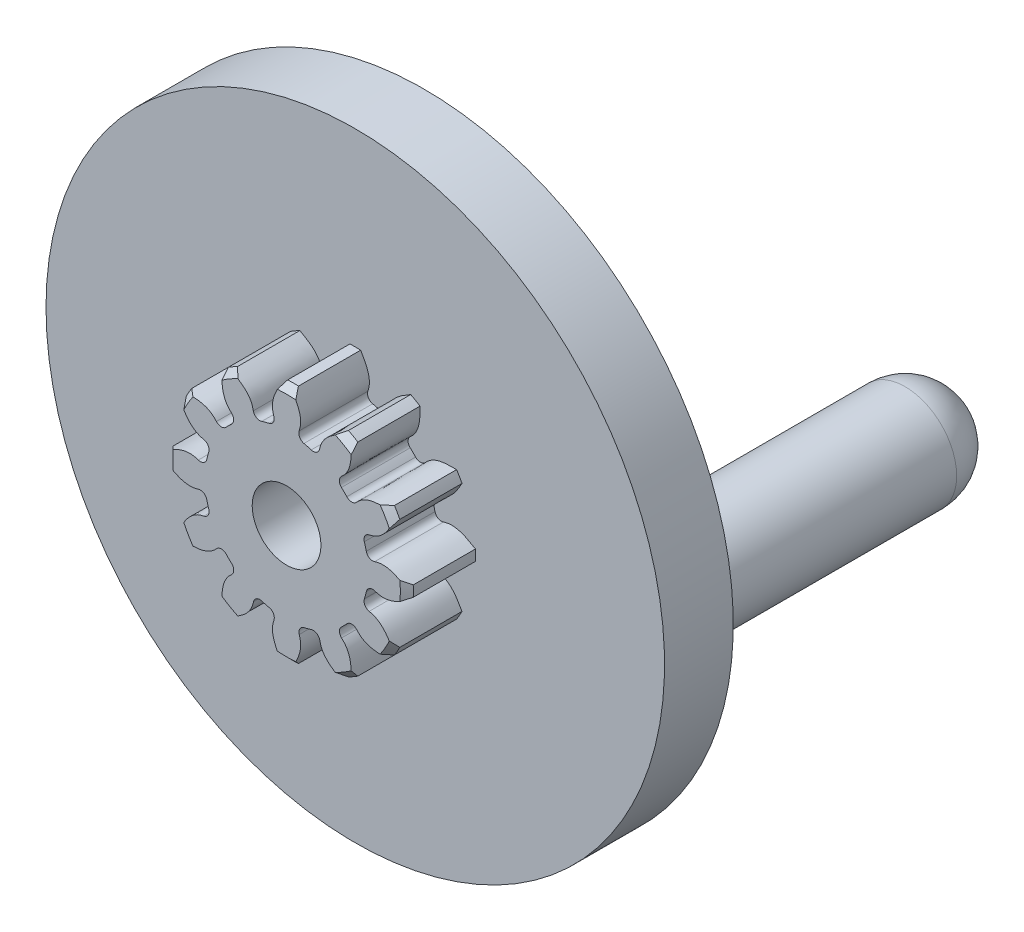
ISO-10303-21;
HEADER;
FILE_DESCRIPTION(('STEP AP214'),'2;1');
FILE_NAME('part.step','',(''),(''),'','','');
FILE_SCHEMA(('AUTOMOTIVE_DESIGN { 1 0 10303 214 1 1 1 1 }'));
ENDSEC;
DATA;
#1=APPLICATION_CONTEXT('core data for automotive mechanical design processes');
#2=APPLICATION_PROTOCOL_DEFINITION('international standard','automotive_design',2000,#1);
#3=PRODUCT_CONTEXT('',#1,'mechanical');
#4=PRODUCT('Part','Part','',(#3));
#5=PRODUCT_RELATED_PRODUCT_CATEGORY('part','',(#4));
#6=PRODUCT_DEFINITION_FORMATION('','',#4);
#7=PRODUCT_DEFINITION_CONTEXT('part definition',#1,'design');
#8=PRODUCT_DEFINITION('design','',#6,#7);
#9=PRODUCT_DEFINITION_SHAPE('','',#8);
#10=(LENGTH_UNIT() NAMED_UNIT(*) SI_UNIT(.MILLI.,.METRE.));
#11=(NAMED_UNIT(*) PLANE_ANGLE_UNIT() SI_UNIT($,.RADIAN.));
#12=(NAMED_UNIT(*) SI_UNIT($,.STERADIAN.) SOLID_ANGLE_UNIT());
#13=UNCERTAINTY_MEASURE_WITH_UNIT(LENGTH_MEASURE(1.E-05),#10,'distance_accuracy_value','');
#14=(GEOMETRIC_REPRESENTATION_CONTEXT(3) GLOBAL_UNCERTAINTY_ASSIGNED_CONTEXT((#13)) GLOBAL_UNIT_ASSIGNED_CONTEXT((#10,
#11,#12)) REPRESENTATION_CONTEXT('',''));
#15=CARTESIAN_POINT('',(0.,0.,0.));
#16=DIRECTION('',(0.,0.,1.));
#17=DIRECTION('',(1.,0.,0.));
#18=AXIS2_PLACEMENT_3D('',#15,#16,#17);
#19=CARTESIAN_POINT('',(0.,0.,-4.));
#20=DIRECTION('',(0.,0.,-1.));
#21=DIRECTION('',(-1.,0.,0.));
#22=AXIS2_PLACEMENT_3D('',#19,#20,#21);
#23=PLANE('',#22);
#24=CARTESIAN_POINT('',(0.,0.,-4.));
#25=DIRECTION('',(0.,0.,-1.));
#26=DIRECTION('',(-1.,0.,0.));
#27=AXIS2_PLACEMENT_3D('',#24,#25,#26);
#28=CIRCLE('',#27,9.);
#29=CARTESIAN_POINT('',(-9.,0.,-4.));
#30=VERTEX_POINT('',#29);
#31=EDGE_CURVE('E1803',#30,#30,#28,.T.);
#32=ORIENTED_EDGE('',*,*,#31,.T.);
#33=EDGE_LOOP('',(#32));
#34=FACE_BOUND('',#33,.T.);
#35=CARTESIAN_POINT('',(0.,0.,-4.));
#36=DIRECTION('',(0.,0.,-1.));
#37=DIRECTION('',(-1.,0.,0.));
#38=AXIS2_PLACEMENT_3D('',#35,#36,#37);
#39=CIRCLE('',#38,2.);
#40=CARTESIAN_POINT('',(-2.,0.,-4.));
#41=VERTEX_POINT('',#40);
#42=EDGE_CURVE('E1812',#41,#41,#39,.T.);
#43=ORIENTED_EDGE('',*,*,#42,.F.);
#44=EDGE_LOOP('',(#43));
#45=FACE_BOUND('',#44,.T.);
#46=CARTESIAN_POINT('',(7.,0.,-4.));
#47=DIRECTION('',(0.,0.,-1.));
#48=DIRECTION('',(-1.,0.,0.));
#49=AXIS2_PLACEMENT_3D('',#46,#47,#48);
#50=CIRCLE('',#49,1.5);
#51=CARTESIAN_POINT('',(5.5,0.,-4.));
#52=VERTEX_POINT('',#51);
#53=EDGE_CURVE('E1957',#52,#52,#50,.T.);
#54=ORIENTED_EDGE('',*,*,#53,.F.);
#55=EDGE_LOOP('',(#54));
#56=FACE_BOUND('',#55,.T.);
#57=ADVANCED_FACE('F34',(#34,#45,#56),#23,.T.);
#58=CARTESIAN_POINT('',(0.,0.,-2.));
#59=DIRECTION('',(0.,0.,1.));
#60=DIRECTION('',(1.,0.,0.));
#61=AXIS2_PLACEMENT_3D('',#58,#59,#60);
#62=CYLINDRICAL_SURFACE('',#61,2.375);
#63=CARTESIAN_POINT('',(0.,0.,-2.));
#64=DIRECTION('',(0.,0.,1.));
#65=DIRECTION('',(1.,0.,0.));
#66=AXIS2_PLACEMENT_3D('',#63,#64,#65);
#67=CIRCLE('',#66,2.375);
#68=CARTESIAN_POINT('',(1.75393257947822,1.60135739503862,-2.));
#69=VERTEX_POINT('',#68);
#70=CARTESIAN_POINT('',(1.59850606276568,1.75653163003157,-2.));
#71=VERTEX_POINT('',#70);
#72=EDGE_CURVE('E570',#69,#71,#67,.T.);
#73=ORIENTED_EDGE('',*,*,#72,.T.);
#74=DIRECTION('',(0.,0.,1.));
#75=VECTOR('',#74,1.);
#76=CARTESIAN_POINT('',(1.59850606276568,1.75653163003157,-2.));
#77=LINE('',#76,#75);
#78=CARTESIAN_POINT('',(1.59850606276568,1.75653163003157,0.));
#79=VERTEX_POINT('',#78);
#80=EDGE_CURVE('E555',#71,#79,#77,.T.);
#81=ORIENTED_EDGE('',*,*,#80,.T.);
#82=CARTESIAN_POINT('',(0.,0.,0.));
#83=DIRECTION('',(0.,0.,1.));
#84=DIRECTION('',(1.,0.,0.));
#85=AXIS2_PLACEMENT_3D('',#82,#83,#84);
#86=CIRCLE('',#85,2.375);
#87=CARTESIAN_POINT('',(1.75393257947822,1.60135739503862,0.));
#88=VERTEX_POINT('',#87);
#89=EDGE_CURVE('E933',#88,#79,#86,.T.);
#90=ORIENTED_EDGE('',*,*,#89,.F.);
#91=DIRECTION('',(0.,0.,1.));
#92=VECTOR('',#91,1.);
#93=CARTESIAN_POINT('',(1.75393257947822,1.60135739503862,-2.));
#94=LINE('',#93,#92);
#95=EDGE_CURVE('E573',#88,#69,#94,.F.);
#96=ORIENTED_EDGE('',*,*,#95,.T.);
#97=EDGE_LOOP('',(#73,#81,#90,#96));
#98=FACE_BOUND('',#97,.T.);
#99=ADVANCED_FACE('F571',(#98),#62,.T.);
#100=CARTESIAN_POINT('',(2.31962886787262,0.5098498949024,-2.));
#101=VERTEX_POINT('',#100);
#102=CARTESIAN_POINT('',(2.26261267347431,0.721947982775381,-2.));
#103=VERTEX_POINT('',#102);
#104=EDGE_CURVE('E577',#101,#103,#67,.T.);
#105=ORIENTED_EDGE('',*,*,#104,.T.);
#106=DIRECTION('',(0.,0.,1.));
#107=VECTOR('',#106,1.);
#108=CARTESIAN_POINT('',(2.26261267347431,0.721947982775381,-2.));
#109=LINE('',#108,#107);
#110=CARTESIAN_POINT('',(2.26261267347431,0.721947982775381,0.));
#111=VERTEX_POINT('',#110);
#112=EDGE_CURVE('E901',#103,#111,#109,.T.);
#113=ORIENTED_EDGE('',*,*,#112,.T.);
#114=CARTESIAN_POINT('',(2.31962886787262,0.5098498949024,0.));
#115=VERTEX_POINT('',#114);
#116=EDGE_CURVE('E1718',#115,#111,#86,.T.);
#117=ORIENTED_EDGE('',*,*,#116,.F.);
#118=DIRECTION('',(0.,0.,1.));
#119=VECTOR('',#118,1.);
#120=CARTESIAN_POINT('',(2.31962886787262,0.5098498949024,-2.));
#121=LINE('',#120,#119);
#122=EDGE_CURVE('E877',#115,#101,#121,.F.);
#123=ORIENTED_EDGE('',*,*,#122,.T.);
#124=EDGE_LOOP('',(#105,#113,#117,#123));
#125=FACE_BOUND('',#124,.T.);
#126=ADVANCED_FACE('F987',(#125),#62,.T.);
#127=CARTESIAN_POINT('',(2.26378247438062,-0.718271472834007,-2.));
#128=VERTEX_POINT('',#127);
#129=CARTESIAN_POINT('',(2.32045404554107,-0.506081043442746,-2.));
#130=VERTEX_POINT('',#129);
#131=EDGE_CURVE('E977',#128,#130,#67,.T.);
#132=ORIENTED_EDGE('',*,*,#131,.T.);
#133=DIRECTION('',(0.,0.,1.));
#134=VECTOR('',#133,1.);
#135=CARTESIAN_POINT('',(2.32045404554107,-0.506081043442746,-2.));
#136=LINE('',#135,#134);
#137=CARTESIAN_POINT('',(2.32045404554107,-0.506081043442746,0.));
#138=VERTEX_POINT('',#137);
#139=EDGE_CURVE('E882',#130,#138,#136,.T.);
#140=ORIENTED_EDGE('',*,*,#139,.T.);
#141=CARTESIAN_POINT('',(2.26378247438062,-0.718271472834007,0.));
#142=VERTEX_POINT('',#141);
#143=EDGE_CURVE('E1714',#142,#138,#86,.T.);
#144=ORIENTED_EDGE('',*,*,#143,.F.);
#145=DIRECTION('',(0.,0.,1.));
#146=VECTOR('',#145,1.);
#147=CARTESIAN_POINT('',(2.26378247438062,-0.718271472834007,-2.));
#148=LINE('',#147,#146);
#149=EDGE_CURVE('E857',#142,#128,#148,.F.);
#150=ORIENTED_EDGE('',*,*,#149,.T.);
#151=EDGE_LOOP('',(#132,#140,#144,#150));
#152=FACE_BOUND('',#151,.T.);
#153=ADVANCED_FACE('F1713',(#152),#62,.T.);
#154=CARTESIAN_POINT('',(1.60135739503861,-1.75393257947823,-2.));
#155=VERTEX_POINT('',#154);
#156=CARTESIAN_POINT('',(1.75653163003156,-1.59850606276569,-2.));
#157=VERTEX_POINT('',#156);
#158=EDGE_CURVE('E973',#155,#157,#67,.T.);
#159=ORIENTED_EDGE('',*,*,#158,.T.);
#160=DIRECTION('',(0.,0.,1.));
#161=VECTOR('',#160,1.);
#162=CARTESIAN_POINT('',(1.75653163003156,-1.59850606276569,-2.));
#163=LINE('',#162,#161);
#164=CARTESIAN_POINT('',(1.75653163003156,-1.59850606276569,0.));
#165=VERTEX_POINT('',#164);
#166=EDGE_CURVE('E862',#157,#165,#163,.T.);
#167=ORIENTED_EDGE('',*,*,#166,.T.);
#168=CARTESIAN_POINT('',(1.60135739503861,-1.75393257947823,0.));
#169=VERTEX_POINT('',#168);
#170=EDGE_CURVE('E1717',#169,#165,#86,.T.);
#171=ORIENTED_EDGE('',*,*,#170,.F.);
#172=DIRECTION('',(0.,0.,1.));
#173=VECTOR('',#172,1.);
#174=CARTESIAN_POINT('',(1.60135739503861,-1.75393257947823,-2.));
#175=LINE('',#174,#173);
#176=EDGE_CURVE('E837',#169,#155,#175,.F.);
#177=ORIENTED_EDGE('',*,*,#176,.T.);
#178=EDGE_LOOP('',(#159,#167,#171,#177));
#179=FACE_BOUND('',#178,.T.);
#180=ADVANCED_FACE('F2531',(#179),#62,.T.);
#181=CARTESIAN_POINT('',(0.509849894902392,-2.31962886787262,-2.));
#182=VERTEX_POINT('',#181);
#183=CARTESIAN_POINT('',(0.721947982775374,-2.26261267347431,-2.));
#184=VERTEX_POINT('',#183);
#185=EDGE_CURVE('E969',#182,#184,#67,.T.);
#186=ORIENTED_EDGE('',*,*,#185,.T.);
#187=DIRECTION('',(0.,0.,1.));
#188=VECTOR('',#187,1.);
#189=CARTESIAN_POINT('',(0.721947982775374,-2.26261267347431,-2.));
#190=LINE('',#189,#188);
#191=CARTESIAN_POINT('',(0.721947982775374,-2.26261267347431,0.));
#192=VERTEX_POINT('',#191);
#193=EDGE_CURVE('E842',#184,#192,#190,.T.);
#194=ORIENTED_EDGE('',*,*,#193,.T.);
#195=CARTESIAN_POINT('',(0.509849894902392,-2.31962886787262,0.));
#196=VERTEX_POINT('',#195);
#197=EDGE_CURVE('E1720',#196,#192,#86,.T.);
#198=ORIENTED_EDGE('',*,*,#197,.F.);
#199=DIRECTION('',(0.,0.,1.));
#200=VECTOR('',#199,1.);
#201=CARTESIAN_POINT('',(0.509849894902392,-2.31962886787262,-2.));
#202=LINE('',#201,#200);
#203=EDGE_CURVE('E817',#196,#182,#202,.F.);
#204=ORIENTED_EDGE('',*,*,#203,.T.);
#205=EDGE_LOOP('',(#186,#194,#198,#204));
#206=FACE_BOUND('',#205,.T.);
#207=ADVANCED_FACE('F2545',(#206),#62,.T.);
#208=CARTESIAN_POINT('',(-0.718271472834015,-2.26378247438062,-2.));
#209=VERTEX_POINT('',#208);
#210=CARTESIAN_POINT('',(-0.506081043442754,-2.32045404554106,-2.));
#211=VERTEX_POINT('',#210);
#212=EDGE_CURVE('E965',#209,#211,#67,.T.);
#213=ORIENTED_EDGE('',*,*,#212,.T.);
#214=DIRECTION('',(0.,0.,1.));
#215=VECTOR('',#214,1.);
#216=CARTESIAN_POINT('',(-0.506081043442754,-2.32045404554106,-2.));
#217=LINE('',#216,#215);
#218=CARTESIAN_POINT('',(-0.506081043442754,-2.32045404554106,0.));
#219=VERTEX_POINT('',#218);
#220=EDGE_CURVE('E822',#211,#219,#217,.T.);
#221=ORIENTED_EDGE('',*,*,#220,.T.);
#222=CARTESIAN_POINT('',(-0.718271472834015,-2.26378247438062,0.));
#223=VERTEX_POINT('',#222);
#224=EDGE_CURVE('E2516',#223,#219,#86,.T.);
#225=ORIENTED_EDGE('',*,*,#224,.F.);
#226=DIRECTION('',(0.,0.,1.));
#227=VECTOR('',#226,1.);
#228=CARTESIAN_POINT('',(-0.718271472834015,-2.26378247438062,-2.));
#229=LINE('',#228,#227);
#230=EDGE_CURVE('E797',#223,#209,#229,.F.);
#231=ORIENTED_EDGE('',*,*,#230,.T.);
#232=EDGE_LOOP('',(#213,#221,#225,#231));
#233=FACE_BOUND('',#232,.T.);
#234=ADVANCED_FACE('F2550',(#233),#62,.T.);
#235=CARTESIAN_POINT('',(-1.75393257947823,-1.6013573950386,-2.));
#236=VERTEX_POINT('',#235);
#237=CARTESIAN_POINT('',(-1.59850606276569,-1.75653163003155,-2.));
#238=VERTEX_POINT('',#237);
#239=EDGE_CURVE('E961',#236,#238,#67,.T.);
#240=ORIENTED_EDGE('',*,*,#239,.T.);
#241=DIRECTION('',(0.,0.,1.));
#242=VECTOR('',#241,1.);
#243=CARTESIAN_POINT('',(-1.59850606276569,-1.75653163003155,-2.));
#244=LINE('',#243,#242);
#245=CARTESIAN_POINT('',(-1.59850606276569,-1.75653163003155,0.));
#246=VERTEX_POINT('',#245);
#247=EDGE_CURVE('E802',#238,#246,#244,.T.);
#248=ORIENTED_EDGE('',*,*,#247,.T.);
#249=CARTESIAN_POINT('',(-1.75393257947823,-1.6013573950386,0.));
#250=VERTEX_POINT('',#249);
#251=EDGE_CURVE('E2513',#250,#246,#86,.T.);
#252=ORIENTED_EDGE('',*,*,#251,.F.);
#253=DIRECTION('',(0.,0.,1.));
#254=VECTOR('',#253,1.);
#255=CARTESIAN_POINT('',(-1.75393257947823,-1.6013573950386,-2.));
#256=LINE('',#255,#254);
#257=EDGE_CURVE('E777',#250,#236,#256,.F.);
#258=ORIENTED_EDGE('',*,*,#257,.T.);
#259=EDGE_LOOP('',(#240,#248,#252,#258));
#260=FACE_BOUND('',#259,.T.);
#261=ADVANCED_FACE('F2639',(#260),#62,.T.);
#262=CARTESIAN_POINT('',(-2.31962886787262,-0.509849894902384,-2.));
#263=VERTEX_POINT('',#262);
#264=CARTESIAN_POINT('',(-2.26261267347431,-0.721947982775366,-2.));
#265=VERTEX_POINT('',#264);
#266=EDGE_CURVE('E957',#263,#265,#67,.T.);
#267=ORIENTED_EDGE('',*,*,#266,.T.);
#268=DIRECTION('',(0.,0.,1.));
#269=VECTOR('',#268,1.);
#270=CARTESIAN_POINT('',(-2.26261267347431,-0.721947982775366,-2.));
#271=LINE('',#270,#269);
#272=CARTESIAN_POINT('',(-2.26261267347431,-0.721947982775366,0.));
#273=VERTEX_POINT('',#272);
#274=EDGE_CURVE('E782',#265,#273,#271,.T.);
#275=ORIENTED_EDGE('',*,*,#274,.T.);
#276=CARTESIAN_POINT('',(-2.31962886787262,-0.509849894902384,0.));
#277=VERTEX_POINT('',#276);
#278=EDGE_CURVE('E2511',#277,#273,#86,.T.);
#279=ORIENTED_EDGE('',*,*,#278,.F.);
#280=DIRECTION('',(0.,0.,1.));
#281=VECTOR('',#280,1.);
#282=CARTESIAN_POINT('',(-2.31962886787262,-0.509849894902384,-2.));
#283=LINE('',#282,#281);
#284=EDGE_CURVE('E757',#277,#263,#283,.F.);
#285=ORIENTED_EDGE('',*,*,#284,.T.);
#286=EDGE_LOOP('',(#267,#275,#279,#285));
#287=FACE_BOUND('',#286,.T.);
#288=ADVANCED_FACE('F2632',(#287),#62,.T.);
#289=CARTESIAN_POINT('',(-2.26378247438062,0.718271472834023,-2.));
#290=VERTEX_POINT('',#289);
#291=CARTESIAN_POINT('',(-2.32045404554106,0.506081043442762,-2.));
#292=VERTEX_POINT('',#291);
#293=EDGE_CURVE('E953',#290,#292,#67,.T.);
#294=ORIENTED_EDGE('',*,*,#293,.T.);
#295=DIRECTION('',(0.,0.,1.));
#296=VECTOR('',#295,1.);
#297=CARTESIAN_POINT('',(-2.32045404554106,0.506081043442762,-2.));
#298=LINE('',#297,#296);
#299=CARTESIAN_POINT('',(-2.32045404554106,0.506081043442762,0.));
#300=VERTEX_POINT('',#299);
#301=EDGE_CURVE('E762',#292,#300,#298,.T.);
#302=ORIENTED_EDGE('',*,*,#301,.T.);
#303=CARTESIAN_POINT('',(-2.26378247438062,0.718271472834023,0.));
#304=VERTEX_POINT('',#303);
#305=EDGE_CURVE('E2510',#304,#300,#86,.T.);
#306=ORIENTED_EDGE('',*,*,#305,.F.);
#307=DIRECTION('',(0.,0.,1.));
#308=VECTOR('',#307,1.);
#309=CARTESIAN_POINT('',(-2.26378247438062,0.718271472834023,-2.));
#310=LINE('',#309,#308);
#311=EDGE_CURVE('E737',#304,#290,#310,.F.);
#312=ORIENTED_EDGE('',*,*,#311,.T.);
#313=EDGE_LOOP('',(#294,#302,#306,#312));
#314=FACE_BOUND('',#313,.T.);
#315=ADVANCED_FACE('F2509',(#314),#62,.T.);
#316=CARTESIAN_POINT('',(-1.6013573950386,1.75393257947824,-2.));
#317=VERTEX_POINT('',#316);
#318=CARTESIAN_POINT('',(-1.75653163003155,1.5985060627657,-2.));
#319=VERTEX_POINT('',#318);
#320=EDGE_CURVE('E948',#317,#319,#67,.T.);
#321=ORIENTED_EDGE('',*,*,#320,.T.);
#322=DIRECTION('',(0.,0.,1.));
#323=VECTOR('',#322,1.);
#324=CARTESIAN_POINT('',(-1.75653163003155,1.5985060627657,-2.));
#325=LINE('',#324,#323);
#326=CARTESIAN_POINT('',(-1.75653163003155,1.5985060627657,0.));
#327=VERTEX_POINT('',#326);
#328=EDGE_CURVE('E742',#319,#327,#325,.T.);
#329=ORIENTED_EDGE('',*,*,#328,.T.);
#330=CARTESIAN_POINT('',(-1.6013573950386,1.75393257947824,0.));
#331=VERTEX_POINT('',#330);
#332=EDGE_CURVE('E945',#331,#327,#86,.T.);
#333=ORIENTED_EDGE('',*,*,#332,.F.);
#334=DIRECTION('',(0.,0.,1.));
#335=VECTOR('',#334,1.);
#336=CARTESIAN_POINT('',(-1.6013573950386,1.75393257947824,-2.));
#337=LINE('',#336,#335);
#338=EDGE_CURVE('E717',#331,#317,#337,.F.);
#339=ORIENTED_EDGE('',*,*,#338,.T.);
#340=EDGE_LOOP('',(#321,#329,#333,#339));
#341=FACE_BOUND('',#340,.T.);
#342=ADVANCED_FACE('F2619',(#341),#62,.T.);
#343=CARTESIAN_POINT('',(-0.509849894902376,2.31962886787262,-2.));
#344=VERTEX_POINT('',#343);
#345=CARTESIAN_POINT('',(-0.721947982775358,2.26261267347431,-2.));
#346=VERTEX_POINT('',#345);
#347=EDGE_CURVE('E943',#344,#346,#67,.T.);
#348=ORIENTED_EDGE('',*,*,#347,.T.);
#349=DIRECTION('',(0.,0.,1.));
#350=VECTOR('',#349,1.);
#351=CARTESIAN_POINT('',(-0.721947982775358,2.26261267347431,-2.));
#352=LINE('',#351,#350);
#353=CARTESIAN_POINT('',(-0.721947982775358,2.26261267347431,0.));
#354=VERTEX_POINT('',#353);
#355=EDGE_CURVE('E722',#346,#354,#352,.T.);
#356=ORIENTED_EDGE('',*,*,#355,.T.);
#357=CARTESIAN_POINT('',(-0.509849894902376,2.31962886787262,0.));
#358=VERTEX_POINT('',#357);
#359=EDGE_CURVE('E936',#358,#354,#86,.T.);
#360=ORIENTED_EDGE('',*,*,#359,.F.);
#361=DIRECTION('',(0.,0.,1.));
#362=VECTOR('',#361,1.);
#363=CARTESIAN_POINT('',(-0.509849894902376,2.31962886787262,-2.));
#364=LINE('',#363,#362);
#365=EDGE_CURVE('E1758',#358,#344,#364,.F.);
#366=ORIENTED_EDGE('',*,*,#365,.T.);
#367=EDGE_LOOP('',(#348,#356,#360,#366));
#368=FACE_BOUND('',#367,.T.);
#369=ADVANCED_FACE('F1763',(#368),#62,.T.);
#370=CARTESIAN_POINT('',(0.718271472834,2.26378247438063,0.));
#371=VERTEX_POINT('',#370);
#372=CARTESIAN_POINT('',(0.50608104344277,2.32045404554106,0.));
#373=VERTEX_POINT('',#372);
#374=EDGE_CURVE('E921',#371,#373,#86,.T.);
#375=ORIENTED_EDGE('',*,*,#374,.F.);
#376=DIRECTION('',(0.,0.,1.));
#377=VECTOR('',#376,1.);
#378=CARTESIAN_POINT('',(0.718271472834,2.26378247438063,-2.));
#379=LINE('',#378,#377);
#380=CARTESIAN_POINT('',(0.718271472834,2.26378247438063,-2.));
#381=VERTEX_POINT('',#380);
#382=EDGE_CURVE('E915',#371,#381,#379,.F.);
#383=ORIENTED_EDGE('',*,*,#382,.T.);
#384=CARTESIAN_POINT('',(0.50608104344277,2.32045404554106,-2.));
#385=VERTEX_POINT('',#384);
#386=EDGE_CURVE('E578',#381,#385,#67,.T.);
#387=ORIENTED_EDGE('',*,*,#386,.T.);
#388=DIRECTION('',(0.,0.,1.));
#389=VECTOR('',#388,1.);
#390=CARTESIAN_POINT('',(0.50608104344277,2.32045404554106,-2.));
#391=LINE('',#390,#389);
#392=EDGE_CURVE('E931',#385,#373,#391,.T.);
#393=ORIENTED_EDGE('',*,*,#392,.T.);
#394=EDGE_LOOP('',(#375,#383,#387,#393));
#395=FACE_BOUND('',#394,.T.);
#396=ADVANCED_FACE('F36',(#395),#62,.T.);
#397=CARTESIAN_POINT('',(0.,0.,0.));
#398=DIRECTION('',(0.,0.,1.));
#399=DIRECTION('',(1.,0.,0.));
#400=AXIS2_PLACEMENT_3D('',#397,#398,#399);
#401=PLANE('',#400);
#402=CARTESIAN_POINT('',(0.,0.,0.));
#403=DIRECTION('',(0.,0.,-1.));
#404=DIRECTION('',(-1.,0.,0.));
#405=AXIS2_PLACEMENT_3D('',#402,#403,#404);
#406=CIRCLE('',#405,1.);
#407=CARTESIAN_POINT('',(-1.,0.,0.));
#408=VERTEX_POINT('',#407);
#409=EDGE_CURVE('E1962',#408,#408,#406,.T.);
#410=ORIENTED_EDGE('',*,*,#409,.T.);
#411=EDGE_LOOP('',(#410));
#412=FACE_BOUND('',#411,.T.);
#413=CARTESIAN_POINT('',(1.17628653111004,1.72440611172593,0.));
#414=CARTESIAN_POINT('',(1.36824417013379,1.88547769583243,0.));
#415=CARTESIAN_POINT('',(1.68021195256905,2.02773716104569,0.));
#416=CARTESIAN_POINT('',(1.88629135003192,2.49889286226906,0.));
#417=CARTESIAN_POINT('',(1.88485753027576,2.75583027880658,0.));
#418=CARTESIAN_POINT('',(1.88377502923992,2.94981213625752,0.));
#419=B_SPLINE_CURVE_WITH_KNOTS('',3,(#413,#414,#415,#416,#417,#418),.UNSPECIFIED.,.F.,.F.,(4,1,
1,4),(0.,0.4975070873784,0.620629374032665,1.),.UNSPECIFIED.);
#420=CARTESIAN_POINT('',(1.60096652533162,2.03977703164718,0.));
#421=VERTEX_POINT('',#420);
#422=CARTESIAN_POINT('',(1.88148018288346,2.72325766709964,0.));
#423=VERTEX_POINT('',#422);
#424=EDGE_CURVE('E1809',#421,#423,#419,.T.);
#425=ORIENTED_EDGE('',*,*,#424,.T.);
#426=CARTESIAN_POINT('',(0.,0.,0.));
#427=DIRECTION('',(0.,0.,1.));
#428=DIRECTION('',(1.,0.,0.));
#429=AXIS2_PLACEMENT_3D('',#426,#427,#428);
#430=CIRCLE('',#429,3.31);
#431=CARTESIAN_POINT('',(1.41746217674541,2.99113707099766,0.));
#432=VERTEX_POINT('',#431);
#433=EDGE_CURVE('E1044',#423,#432,#430,.T.);
#434=ORIENTED_EDGE('',*,*,#433,.T.);
#435=CARTESIAN_POINT('',(1.61272473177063,3.10630309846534,0.));
#436=CARTESIAN_POINT('',(1.44389112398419,3.01029218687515,0.));
#437=CARTESIAN_POINT('',(1.22026365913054,2.88312155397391,0.));
#438=CARTESIAN_POINT('',(0.917615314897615,2.4687402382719,0.));
#439=CARTESIAN_POINT('',(0.932249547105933,2.13001967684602,0.));
#440=CARTESIAN_POINT('',(0.905236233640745,1.88089707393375,0.));
#441=B_SPLINE_CURVE_WITH_KNOTS('',3,(#435,#436,#437,#438,#439,#440),.UNSPECIFIED.,.F.,.F.,(4,1,
1,4),(0.,0.379370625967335,0.5024929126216,1.),.UNSPECIFIED.);
#442=CARTESIAN_POINT('',(0.961271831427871,2.40395326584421,0.));
#443=VERTEX_POINT('',#442);
#444=EDGE_CURVE('E924',#432,#443,#441,.T.);
#445=ORIENTED_EDGE('',*,*,#444,.T.);
#446=CARTESIAN_POINT('',(0.775733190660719,2.44488507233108,0.));
#447=DIRECTION('',(0.,0.,1.));
#448=DIRECTION('',(1.,0.,0.));
#449=AXIS2_PLACEMENT_3D('',#446,#447,#448);
#450=CIRCLE('',#449,0.19);
#451=EDGE_CURVE('E566',#443,#371,#450,.F.);
#452=ORIENTED_EDGE('',*,*,#451,.T.);
#453=ORIENTED_EDGE('',*,*,#374,.T.);
#454=CARTESIAN_POINT('',(0.546567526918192,2.50609036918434,0.));
#455=DIRECTION('',(0.,0.,1.));
#456=DIRECTION('',(1.,0.,0.));
#457=AXIS2_PLACEMENT_3D('',#454,#455,#456);
#458=CIRCLE('',#457,0.19);
#459=CARTESIAN_POINT('',(0.366589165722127,2.56698199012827,0.));
#460=VERTEX_POINT('',#459);
#461=EDGE_CURVE('E1747',#373,#460,#458,.F.);
#462=ORIENTED_EDGE('',*,*,#461,.T.);
#463=CARTESIAN_POINT('',(0.156490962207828,2.08152276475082,0.));
#464=CARTESIAN_POINT('',(0.242195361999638,2.31699366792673,0.));
#465=CARTESIAN_POINT('',(0.441237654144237,2.59617786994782,0.));
#466=CARTESIAN_POINT('',(0.384129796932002,3.10725037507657,0.));
#467=CARTESIAN_POINT('',(0.254419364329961,3.32904779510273,0.));
#468=CARTESIAN_POINT('',(0.156490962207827,3.49649976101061,0.));
#469=B_SPLINE_CURVE_WITH_KNOTS('',3,(#463,#464,#465,#466,#467,#468),.UNSPECIFIED.,.F.,.F.,(4,1,
1,4),(0.,0.4975070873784,0.620629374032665,1.),.UNSPECIFIED.);
#470=CARTESIAN_POINT('',(0.267780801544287,3.29915041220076,0.));
#471=VERTEX_POINT('',#470);
#472=EDGE_CURVE('E667',#460,#471,#469,.T.);
#473=ORIENTED_EDGE('',*,*,#472,.T.);
#474=CARTESIAN_POINT('',(0.,0.,0.));
#475=DIRECTION('',(0.,0.,1.));
#476=DIRECTION('',(1.,0.,0.));
#477=AXIS2_PLACEMENT_3D('',#474,#475,#476);
#478=CIRCLE('',#477,3.31);
#479=CARTESIAN_POINT('',(-0.268010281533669,3.29913177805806,0.));
#480=VERTEX_POINT('',#479);
#481=EDGE_CURVE('E1744',#471,#480,#478,.T.);
#482=ORIENTED_EDGE('',*,*,#481,.T.);
#483=CARTESIAN_POINT('',(-0.156490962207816,3.49649976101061,0.));
#484=CARTESIAN_POINT('',(-0.254699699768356,3.3289350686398,0.));
#485=CARTESIAN_POINT('',(-0.384781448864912,3.10698833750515,0.));
#486=CARTESIAN_POINT('',(-0.439691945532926,2.59679941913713,0.));
#487=CARTESIAN_POINT('',(-0.257658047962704,2.31077592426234,0.));
#488=CARTESIAN_POINT('',(-0.156490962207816,2.08152276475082,0.));
#489=B_SPLINE_CURVE_WITH_KNOTS('',3,(#483,#484,#485,#486,#487,#488),.UNSPECIFIED.,.F.,.F.,(4,1,
1,4),(0.,0.379370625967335,0.5024929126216,1.),.UNSPECIFIED.);
#490=CARTESIAN_POINT('',(-0.369490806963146,2.5625205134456,0.));
#491=VERTEX_POINT('',#490);
#492=EDGE_CURVE('E674',#480,#491,#489,.T.);
#493=ORIENTED_EDGE('',*,*,#492,.T.);
#494=CARTESIAN_POINT('',(-0.550637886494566,2.50519917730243,0.));
#495=DIRECTION('',(0.,0.,1.));
#496=DIRECTION('',(1.,0.,0.));
#497=AXIS2_PLACEMENT_3D('',#494,#495,#496);
#498=CIRCLE('',#497,0.19);
#499=EDGE_CURVE('E1753',#491,#358,#498,.F.);
#500=ORIENTED_EDGE('',*,*,#499,.T.);
#501=ORIENTED_EDGE('',*,*,#359,.T.);
#502=CARTESIAN_POINT('',(-0.779703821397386,2.44362168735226,0.));
#503=DIRECTION('',(0.,0.,1.));
#504=DIRECTION('',(1.,0.,0.));
#505=AXIS2_PLACEMENT_3D('',#502,#503,#504);
#506=CIRCLE('',#505,0.19);
#507=CARTESIAN_POINT('',(-0.966015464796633,2.40636619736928,0.));
#508=VERTEX_POINT('',#507);
#509=EDGE_CURVE('E732',#354,#508,#506,.F.);
#510=ORIENTED_EDGE('',*,*,#509,.T.);
#511=CARTESIAN_POINT('',(-0.905236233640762,1.88089707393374,0.));
#512=CARTESIAN_POINT('',(-0.948749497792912,2.12767305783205,0.));
#513=CARTESIAN_POINT('',(-0.915965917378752,2.4689748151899,0.));
#514=CARTESIAN_POINT('',(-1.22095902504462,2.88302265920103,0.));
#515=CARTESIAN_POINT('',(-1.44419026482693,3.01024964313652,0.));
#516=CARTESIAN_POINT('',(-1.61272473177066,3.10630309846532,0.));
#517=B_SPLINE_CURVE_WITH_KNOTS('',3,(#511,#512,#513,#514,#515,#516),.UNSPECIFIED.,.F.,.F.,(4,1,
1,4),(0.,0.4975070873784,0.620629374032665,1.),.UNSPECIFIED.);
#518=CARTESIAN_POINT('',(-1.41767022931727,2.9910384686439,0.));
#519=VERTEX_POINT('',#518);
#520=EDGE_CURVE('E1457',#508,#519,#517,.T.);
#521=ORIENTED_EDGE('',*,*,#520,.T.);
#522=CARTESIAN_POINT('',(0.,0.,0.));
#523=DIRECTION('',(0.,0.,1.));
#524=DIRECTION('',(1.,0.,0.));
#525=AXIS2_PLACEMENT_3D('',#522,#523,#524);
#526=CIRCLE('',#525,3.31);
#527=CARTESIAN_POINT('',(-1.88166960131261,2.72312678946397,0.));
#528=VERTEX_POINT('',#527);
#529=EDGE_CURVE('E587',#519,#528,#526,.T.);
#530=ORIENTED_EDGE('',*,*,#529,.T.);
#531=CARTESIAN_POINT('',(-1.88377502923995,2.9498121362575,0.));
#532=CARTESIAN_POINT('',(-1.88504394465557,2.75559248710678,0.));
#533=CARTESIAN_POINT('',(-1.88672467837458,2.49834010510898,0.));
#534=CARTESIAN_POINT('',(-1.67918410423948,2.02904829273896,0.));
#535=CARTESIAN_POINT('',(-1.37852637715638,1.8723616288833,0.));
#536=CARTESIAN_POINT('',(-1.17628653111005,1.72440611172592,0.));
#537=B_SPLINE_CURVE_WITH_KNOTS('',3,(#531,#532,#533,#534,#535,#536),.UNSPECIFIED.,.F.,.F.,(4,1,
1,4),(0.,0.379370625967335,0.5024929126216,1.),.UNSPECIFIED.);
#538=CARTESIAN_POINT('',(-1.6012486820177,2.03446245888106,0.));
#539=VERTEX_POINT('',#538);
#540=EDGE_CURVE('E647',#528,#539,#537,.T.);
#541=ORIENTED_EDGE('',*,*,#540,.T.);
#542=CARTESIAN_POINT('',(-1.72946598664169,1.8942471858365,0.));
#543=DIRECTION('',(0.,0.,1.));
#544=DIRECTION('',(1.,0.,0.));
#545=AXIS2_PLACEMENT_3D('',#542,#543,#544);
#546=CIRCLE('',#545,0.19);
#547=EDGE_CURVE('E724',#539,#331,#546,.F.);
#548=ORIENTED_EDGE('',*,*,#547,.T.);
#549=ORIENTED_EDGE('',*,*,#332,.T.);
#550=CARTESIAN_POINT('',(-1.89705416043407,1.72638654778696,0.));
#551=DIRECTION('',(0.,0.,1.));
#552=DIRECTION('',(1.,0.,0.));
#553=AXIS2_PLACEMENT_3D('',#550,#551,#552);
#554=CIRCLE('',#553,0.19);
#555=CARTESIAN_POINT('',(-2.03977703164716,1.60096652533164,0.));
#556=VERTEX_POINT('',#555);
#557=EDGE_CURVE('E752',#327,#556,#554,.F.);
#558=ORIENTED_EDGE('',*,*,#557,.T.);
#559=CARTESIAN_POINT('',(-1.72440611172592,1.17628653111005,0.));
#560=CARTESIAN_POINT('',(-1.88547769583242,1.36824417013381,0.));
#561=CARTESIAN_POINT('',(-2.02773716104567,1.68021195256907,0.));
#562=CARTESIAN_POINT('',(-2.49889286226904,1.88629135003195,0.));
#563=CARTESIAN_POINT('',(-2.75583027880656,1.88485753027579,0.));
#564=CARTESIAN_POINT('',(-2.9498121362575,1.88377502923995,0.));
#565=B_SPLINE_CURVE_WITH_KNOTS('',3,(#559,#560,#561,#562,#563,#564),.UNSPECIFIED.,.F.,.F.,(4,1,
1,4),(0.,0.4975070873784,0.620629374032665,1.),.UNSPECIFIED.);
#566=CARTESIAN_POINT('',(-2.72325766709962,1.88148018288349,0.));
#567=VERTEX_POINT('',#566);
#568=EDGE_CURVE('E1489',#556,#567,#565,.T.);
#569=ORIENTED_EDGE('',*,*,#568,.T.);
#570=CARTESIAN_POINT('',(0.,0.,0.));
#571=DIRECTION('',(0.,0.,1.));
#572=DIRECTION('',(1.,0.,0.));
#573=AXIS2_PLACEMENT_3D('',#570,#571,#572);
#574=CIRCLE('',#573,3.31);
#575=CARTESIAN_POINT('',(-2.99113707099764,1.41746217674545,0.));
#576=VERTEX_POINT('',#575);
#577=EDGE_CURVE('E628',#567,#576,#574,.T.);
#578=ORIENTED_EDGE('',*,*,#577,.T.);
#579=CARTESIAN_POINT('',(-3.10630309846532,1.61272473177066,0.));
#580=CARTESIAN_POINT('',(-3.01029218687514,1.44389112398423,0.));
#581=CARTESIAN_POINT('',(-2.8831215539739,1.22026365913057,0.));
#582=CARTESIAN_POINT('',(-2.46874023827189,0.917615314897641,0.));
#583=CARTESIAN_POINT('',(-2.13001967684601,0.932249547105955,0.));
#584=CARTESIAN_POINT('',(-1.88089707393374,0.905236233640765,0.));
#585=B_SPLINE_CURVE_WITH_KNOTS('',3,(#579,#580,#581,#582,#583,#584),.UNSPECIFIED.,.F.,.F.,(4,1,
1,4),(0.,0.379370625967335,0.5024929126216,1.),.UNSPECIFIED.);
#586=CARTESIAN_POINT('',(-2.4039532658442,0.961271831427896,0.));
#587=VERTEX_POINT('',#586);
#588=EDGE_CURVE('E1437',#576,#587,#585,.T.);
#589=ORIENTED_EDGE('',*,*,#588,.T.);
#590=CARTESIAN_POINT('',(-2.44488507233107,0.775733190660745,0.));
#591=DIRECTION('',(0.,0.,1.));
#592=DIRECTION('',(1.,0.,0.));
#593=AXIS2_PLACEMENT_3D('',#590,#591,#592);
#594=CIRCLE('',#593,0.19);
#595=EDGE_CURVE('E744',#587,#304,#594,.F.);
#596=ORIENTED_EDGE('',*,*,#595,.T.);
#597=ORIENTED_EDGE('',*,*,#305,.T.);
#598=CARTESIAN_POINT('',(-2.50609036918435,0.546567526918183,0.));
#599=DIRECTION('',(0.,0.,1.));
#600=DIRECTION('',(1.,0.,0.));
#601=AXIS2_PLACEMENT_3D('',#598,#599,#600);
#602=CIRCLE('',#601,0.19);
#603=CARTESIAN_POINT('',(-2.56698199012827,0.366589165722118,0.));
#604=VERTEX_POINT('',#603);
#605=EDGE_CURVE('E772',#300,#604,#602,.F.);
#606=ORIENTED_EDGE('',*,*,#605,.T.);
#607=CARTESIAN_POINT('',(-2.08152276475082,0.15649096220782,0.));
#608=CARTESIAN_POINT('',(-2.31699366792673,0.24219536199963,0.));
#609=CARTESIAN_POINT('',(-2.59617786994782,0.441237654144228,0.));
#610=CARTESIAN_POINT('',(-3.10725037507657,0.384129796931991,0.));
#611=CARTESIAN_POINT('',(-3.32904779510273,0.254419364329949,0.));
#612=CARTESIAN_POINT('',(-3.49649976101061,0.156490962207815,0.));
#613=B_SPLINE_CURVE_WITH_KNOTS('',3,(#607,#608,#609,#610,#611,#612),.UNSPECIFIED.,.F.,.F.,(4,1,
1,4),(0.,0.4975070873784,0.620629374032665,1.),.UNSPECIFIED.);
#614=CARTESIAN_POINT('',(-3.29915041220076,0.267780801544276,0.));
#615=VERTEX_POINT('',#614);
#616=EDGE_CURVE('E1512',#604,#615,#613,.T.);
#617=ORIENTED_EDGE('',*,*,#616,.T.);
#618=CARTESIAN_POINT('',(0.,0.,0.));
#619=DIRECTION('',(0.,0.,1.));
#620=DIRECTION('',(1.,0.,0.));
#621=AXIS2_PLACEMENT_3D('',#618,#619,#620);
#622=CIRCLE('',#621,3.31);
#623=CARTESIAN_POINT('',(-3.29913177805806,-0.26801028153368,0.));
#624=VERTEX_POINT('',#623);
#625=EDGE_CURVE('E1415',#615,#624,#622,.T.);
#626=ORIENTED_EDGE('',*,*,#625,.T.);
#627=CARTESIAN_POINT('',(-3.49649976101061,-0.156490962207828,0.));
#628=CARTESIAN_POINT('',(-3.3289350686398,-0.254699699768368,0.));
#629=CARTESIAN_POINT('',(-3.10698833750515,-0.384781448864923,0.));
#630=CARTESIAN_POINT('',(-2.59679941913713,-0.439691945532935,0.));
#631=CARTESIAN_POINT('',(-2.31077592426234,-0.257658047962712,0.));
#632=CARTESIAN_POINT('',(-2.08152276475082,-0.156490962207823,0.));
#633=B_SPLINE_CURVE_WITH_KNOTS('',3,(#627,#628,#629,#630,#631,#632),.UNSPECIFIED.,.F.,.F.,(4,1,
1,4),(0.,0.379370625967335,0.5024929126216,1.),.UNSPECIFIED.);
#634=CARTESIAN_POINT('',(-2.5625205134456,-0.369490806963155,0.));
#635=VERTEX_POINT('',#634);
#636=EDGE_CURVE('E1386',#624,#635,#633,.T.);
#637=ORIENTED_EDGE('',*,*,#636,.T.);
#638=CARTESIAN_POINT('',(-2.50519917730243,-0.550637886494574,0.));
#639=DIRECTION('',(0.,0.,1.));
#640=DIRECTION('',(1.,0.,0.));
#641=AXIS2_PLACEMENT_3D('',#638,#639,#640);
#642=CIRCLE('',#641,0.19);
#643=EDGE_CURVE('E764',#635,#277,#642,.F.);
#644=ORIENTED_EDGE('',*,*,#643,.T.);
#645=ORIENTED_EDGE('',*,*,#278,.T.);
#646=CARTESIAN_POINT('',(-2.44362168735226,-0.779703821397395,0.));
#647=DIRECTION('',(0.,0.,1.));
#648=DIRECTION('',(1.,0.,0.));
#649=AXIS2_PLACEMENT_3D('',#646,#647,#648);
#650=CIRCLE('',#649,0.19);
#651=CARTESIAN_POINT('',(-2.40636619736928,-0.966015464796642,0.));
#652=VERTEX_POINT('',#651);
#653=EDGE_CURVE('E792',#273,#652,#650,.F.);
#654=ORIENTED_EDGE('',*,*,#653,.T.);
#655=CARTESIAN_POINT('',(-1.88089707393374,-0.905236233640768,0.));
#656=CARTESIAN_POINT('',(-2.12767305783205,-0.948749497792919,0.));
#657=CARTESIAN_POINT('',(-2.4689748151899,-0.915965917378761,0.));
#658=CARTESIAN_POINT('',(-2.88302265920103,-1.22095902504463,0.));
#659=CARTESIAN_POINT('',(-3.01024964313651,-1.44419026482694,0.));
#660=CARTESIAN_POINT('',(-3.10630309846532,-1.61272473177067,0.));
#661=B_SPLINE_CURVE_WITH_KNOTS('',3,(#655,#656,#657,#658,#659,#660),.UNSPECIFIED.,.F.,.F.,(4,1,
1,4),(0.,0.4975070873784,0.620629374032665,1.),.UNSPECIFIED.);
#662=CARTESIAN_POINT('',(-2.9910384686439,-1.41767022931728,0.));
#663=VERTEX_POINT('',#662);
#664=EDGE_CURVE('E1547',#652,#663,#661,.T.);
#665=ORIENTED_EDGE('',*,*,#664,.T.);
#666=CARTESIAN_POINT('',(0.,0.,0.));
#667=DIRECTION('',(0.,0.,1.));
#668=DIRECTION('',(1.,0.,0.));
#669=AXIS2_PLACEMENT_3D('',#666,#667,#668);
#670=CIRCLE('',#669,3.31);
#671=CARTESIAN_POINT('',(-2.72312678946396,-1.88166960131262,0.));
#672=VERTEX_POINT('',#671);
#673=EDGE_CURVE('E1353',#663,#672,#670,.T.);
#674=ORIENTED_EDGE('',*,*,#673,.T.);
#675=CARTESIAN_POINT('',(-2.94981213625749,-1.88377502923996,0.));
#676=CARTESIAN_POINT('',(-2.75559248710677,-1.88504394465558,0.));
#677=CARTESIAN_POINT('',(-2.49834010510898,-1.88672467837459,0.));
#678=CARTESIAN_POINT('',(-2.02904829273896,-1.67918410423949,0.));
#679=CARTESIAN_POINT('',(-1.8723616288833,-1.37852637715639,0.));
#680=CARTESIAN_POINT('',(-1.72440611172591,-1.17628653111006,0.));
#681=B_SPLINE_CURVE_WITH_KNOTS('',3,(#675,#676,#677,#678,#679,#680),.UNSPECIFIED.,.F.,.F.,(4,1,
1,4),(0.,0.379370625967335,0.5024929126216,1.),.UNSPECIFIED.);
#682=CARTESIAN_POINT('',(-2.03446245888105,-1.6012486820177,0.));
#683=VERTEX_POINT('',#682);
#684=EDGE_CURVE('E1540',#672,#683,#681,.T.);
#685=ORIENTED_EDGE('',*,*,#684,.T.);
#686=CARTESIAN_POINT('',(-1.89424718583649,-1.72946598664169,0.));
#687=DIRECTION('',(0.,0.,1.));
#688=DIRECTION('',(1.,0.,0.));
#689=AXIS2_PLACEMENT_3D('',#686,#687,#688);
#690=CIRCLE('',#689,0.19);
#691=EDGE_CURVE('E784',#683,#250,#690,.F.);
#692=ORIENTED_EDGE('',*,*,#691,.T.);
#693=ORIENTED_EDGE('',*,*,#251,.T.);
#694=CARTESIAN_POINT('',(-1.72638654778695,-1.89705416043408,0.));
#695=DIRECTION('',(0.,0.,1.));
#696=DIRECTION('',(1.,0.,0.));
#697=AXIS2_PLACEMENT_3D('',#694,#695,#696);
#698=CIRCLE('',#697,0.19);
#699=CARTESIAN_POINT('',(-1.60096652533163,-2.03977703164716,0.));
#700=VERTEX_POINT('',#699);
#701=EDGE_CURVE('E812',#246,#700,#698,.F.);
#702=ORIENTED_EDGE('',*,*,#701,.T.);
#703=CARTESIAN_POINT('',(-1.17628653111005,-1.72440611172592,0.));
#704=CARTESIAN_POINT('',(-1.36824417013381,-1.88547769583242,0.));
#705=CARTESIAN_POINT('',(-1.68021195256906,-2.02773716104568,0.));
#706=CARTESIAN_POINT('',(-1.88629135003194,-2.49889286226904,0.));
#707=CARTESIAN_POINT('',(-1.88485753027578,-2.75583027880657,0.));
#708=CARTESIAN_POINT('',(-1.88377502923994,-2.94981213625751,0.));
#709=B_SPLINE_CURVE_WITH_KNOTS('',3,(#703,#704,#705,#706,#707,#708),.UNSPECIFIED.,.F.,.F.,(4,1,
1,4),(0.,0.4975070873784,0.620629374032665,1.),.UNSPECIFIED.);
#710=CARTESIAN_POINT('',(-1.88148018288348,-2.72325766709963,0.));
#711=VERTEX_POINT('',#710);
#712=EDGE_CURVE('E1569',#700,#711,#709,.T.);
#713=ORIENTED_EDGE('',*,*,#712,.T.);
#714=CARTESIAN_POINT('',(0.,0.,0.));
#715=DIRECTION('',(0.,0.,1.));
#716=DIRECTION('',(1.,0.,0.));
#717=AXIS2_PLACEMENT_3D('',#714,#715,#716);
#718=CIRCLE('',#717,3.31);
#719=CARTESIAN_POINT('',(-1.41746217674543,-2.99113707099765,0.));
#720=VERTEX_POINT('',#719);
#721=EDGE_CURVE('E1324',#711,#720,#718,.T.);
#722=ORIENTED_EDGE('',*,*,#721,.T.);
#723=CARTESIAN_POINT('',(-1.61272473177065,-3.10630309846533,0.));
#724=CARTESIAN_POINT('',(-1.44389112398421,-3.01029218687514,0.));
#725=CARTESIAN_POINT('',(-1.22026365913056,-2.8831215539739,0.));
#726=CARTESIAN_POINT('',(-0.917615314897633,-2.4687402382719,0.));
#727=CARTESIAN_POINT('',(-0.932249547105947,-2.13001967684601,0.));
#728=CARTESIAN_POINT('',(-0.905236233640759,-1.88089707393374,0.));
#729=B_SPLINE_CURVE_WITH_KNOTS('',3,(#723,#724,#725,#726,#727,#728),.UNSPECIFIED.,.F.,.F.,(4,1,
1,4),(0.,0.379370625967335,0.5024929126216,1.),.UNSPECIFIED.);
#730=CARTESIAN_POINT('',(-0.961271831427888,-2.40395326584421,0.));
#731=VERTEX_POINT('',#730);
#732=EDGE_CURVE('E1295',#720,#731,#729,.T.);
#733=ORIENTED_EDGE('',*,*,#732,.T.);
#734=CARTESIAN_POINT('',(-0.775733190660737,-2.44488507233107,0.));
#735=DIRECTION('',(0.,0.,1.));
#736=DIRECTION('',(1.,0.,0.));
#737=AXIS2_PLACEMENT_3D('',#734,#735,#736);
#738=CIRCLE('',#737,0.19);
#739=EDGE_CURVE('E804',#731,#223,#738,.F.);
#740=ORIENTED_EDGE('',*,*,#739,.T.);
#741=ORIENTED_EDGE('',*,*,#224,.T.);
#742=CARTESIAN_POINT('',(-0.546567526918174,-2.50609036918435,0.));
#743=DIRECTION('',(0.,0.,1.));
#744=DIRECTION('',(1.,0.,0.));
#745=AXIS2_PLACEMENT_3D('',#742,#743,#744);
#746=CIRCLE('',#745,0.19);
#747=CARTESIAN_POINT('',(-0.36658916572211,-2.56698199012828,0.));
#748=VERTEX_POINT('',#747);
#749=EDGE_CURVE('E832',#219,#748,#746,.F.);
#750=ORIENTED_EDGE('',*,*,#749,.T.);
#751=CARTESIAN_POINT('',(-0.156490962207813,-2.08152276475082,0.));
#752=CARTESIAN_POINT('',(-0.242195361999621,-2.31699366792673,0.));
#753=CARTESIAN_POINT('',(-0.441237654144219,-2.59617786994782,0.));
#754=CARTESIAN_POINT('',(-0.38412979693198,-3.10725037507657,0.));
#755=CARTESIAN_POINT('',(-0.254419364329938,-3.32904779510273,0.));
#756=CARTESIAN_POINT('',(-0.156490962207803,-3.49649976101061,0.));
#757=B_SPLINE_CURVE_WITH_KNOTS('',3,(#751,#752,#753,#754,#755,#756),.UNSPECIFIED.,.F.,.F.,(4,1,
1,4),(0.,0.4975070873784,0.620629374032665,1.),.UNSPECIFIED.);
#758=CARTESIAN_POINT('',(-0.267780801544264,-3.29915041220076,0.));
#759=VERTEX_POINT('',#758);
#760=EDGE_CURVE('E1607',#748,#759,#757,.T.);
#761=ORIENTED_EDGE('',*,*,#760,.T.);
#762=CARTESIAN_POINT('',(0.,0.,0.));
#763=DIRECTION('',(0.,0.,1.));
#764=DIRECTION('',(1.,0.,0.));
#765=AXIS2_PLACEMENT_3D('',#762,#763,#764);
#766=CIRCLE('',#765,3.31);
#767=CARTESIAN_POINT('',(0.268010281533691,-3.29913177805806,0.));
#768=VERTEX_POINT('',#767);
#769=EDGE_CURVE('E1262',#759,#768,#766,.T.);
#770=ORIENTED_EDGE('',*,*,#769,.T.);
#771=CARTESIAN_POINT('',(0.156490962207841,-3.49649976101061,0.));
#772=CARTESIAN_POINT('',(0.254699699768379,-3.32893506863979,0.));
#773=CARTESIAN_POINT('',(0.384781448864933,-3.10698833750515,0.));
#774=CARTESIAN_POINT('',(0.439691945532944,-2.59679941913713,0.));
#775=CARTESIAN_POINT('',(0.25765804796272,-2.31077592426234,0.));
#776=CARTESIAN_POINT('',(0.15649096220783,-2.08152276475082,0.));
#777=B_SPLINE_CURVE_WITH_KNOTS('',3,(#771,#772,#773,#774,#775,#776),.UNSPECIFIED.,.F.,.F.,(4,1,
1,4),(0.,0.379370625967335,0.5024929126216,1.),.UNSPECIFIED.);
#778=CARTESIAN_POINT('',(0.369490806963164,-2.56252051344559,0.));
#779=VERTEX_POINT('',#778);
#780=EDGE_CURVE('E1600',#768,#779,#777,.T.);
#781=ORIENTED_EDGE('',*,*,#780,.T.);
#782=CARTESIAN_POINT('',(0.550637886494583,-2.50519917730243,0.));
#783=DIRECTION('',(0.,0.,1.));
#784=DIRECTION('',(1.,0.,0.));
#785=AXIS2_PLACEMENT_3D('',#782,#783,#784);
#786=CIRCLE('',#785,0.19);
#787=EDGE_CURVE('E824',#779,#196,#786,.F.);
#788=ORIENTED_EDGE('',*,*,#787,.T.);
#789=ORIENTED_EDGE('',*,*,#197,.T.);
#790=CARTESIAN_POINT('',(0.779703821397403,-2.44362168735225,0.));
#791=DIRECTION('',(0.,0.,1.));
#792=DIRECTION('',(1.,0.,0.));
#793=AXIS2_PLACEMENT_3D('',#790,#791,#792);
#794=CIRCLE('',#793,0.19);
#795=CARTESIAN_POINT('',(0.96601546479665,-2.40636619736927,0.));
#796=VERTEX_POINT('',#795);
#797=EDGE_CURVE('E852',#192,#796,#794,.F.);
#798=ORIENTED_EDGE('',*,*,#797,.T.);
#799=CARTESIAN_POINT('',(0.905236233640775,-1.88089707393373,0.));
#800=CARTESIAN_POINT('',(0.948749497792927,-2.12767305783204,0.));
#801=CARTESIAN_POINT('',(0.915965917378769,-2.4689748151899,0.));
#802=CARTESIAN_POINT('',(1.22095902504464,-2.88302265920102,0.));
#803=CARTESIAN_POINT('',(1.44419026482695,-3.0102496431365,0.));
#804=CARTESIAN_POINT('',(1.61272473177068,-3.10630309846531,0.));
#805=B_SPLINE_CURVE_WITH_KNOTS('',3,(#799,#800,#801,#802,#803,#804),.UNSPECIFIED.,.F.,.F.,(4,1,
1,4),(0.,0.4975070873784,0.620629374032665,1.),.UNSPECIFIED.);
#806=CARTESIAN_POINT('',(1.41767022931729,-2.99103846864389,0.));
#807=VERTEX_POINT('',#806);
#808=EDGE_CURVE('E1629',#796,#807,#805,.T.);
#809=ORIENTED_EDGE('',*,*,#808,.T.);
#810=CARTESIAN_POINT('',(0.,0.,0.));
#811=DIRECTION('',(0.,0.,1.));
#812=DIRECTION('',(1.,0.,0.));
#813=AXIS2_PLACEMENT_3D('',#810,#811,#812);
#814=CIRCLE('',#813,3.31);
#815=CARTESIAN_POINT('',(1.88166960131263,-2.72312678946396,0.));
#816=VERTEX_POINT('',#815);
#817=EDGE_CURVE('E1231',#807,#816,#814,.T.);
#818=ORIENTED_EDGE('',*,*,#817,.T.);
#819=CARTESIAN_POINT('',(1.88377502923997,-2.94981213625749,0.));
#820=CARTESIAN_POINT('',(1.88504394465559,-2.75559248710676,0.));
#821=CARTESIAN_POINT('',(1.88672467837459,-2.49834010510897,0.));
#822=CARTESIAN_POINT('',(1.6791841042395,-2.02904829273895,0.));
#823=CARTESIAN_POINT('',(1.3785263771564,-1.87236162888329,0.));
#824=CARTESIAN_POINT('',(1.17628653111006,-1.72440611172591,0.));
#825=B_SPLINE_CURVE_WITH_KNOTS('',3,(#819,#820,#821,#822,#823,#824),.UNSPECIFIED.,.F.,.F.,(4,1,
1,4),(0.,0.379370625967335,0.5024929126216,1.),.UNSPECIFIED.);
#826=CARTESIAN_POINT('',(1.60124868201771,-2.03446245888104,0.));
#827=VERTEX_POINT('',#826);
#828=EDGE_CURVE('E1202',#816,#827,#825,.T.);
#829=ORIENTED_EDGE('',*,*,#828,.T.);
#830=CARTESIAN_POINT('',(1.7294659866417,-1.89424718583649,0.));
#831=DIRECTION('',(0.,0.,1.));
#832=DIRECTION('',(1.,0.,0.));
#833=AXIS2_PLACEMENT_3D('',#830,#831,#832);
#834=CIRCLE('',#833,0.19);
#835=EDGE_CURVE('E844',#827,#169,#834,.F.);
#836=ORIENTED_EDGE('',*,*,#835,.T.);
#837=ORIENTED_EDGE('',*,*,#170,.T.);
#838=CARTESIAN_POINT('',(1.89705416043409,-1.72638654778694,0.));
#839=DIRECTION('',(0.,0.,1.));
#840=DIRECTION('',(1.,0.,0.));
#841=AXIS2_PLACEMENT_3D('',#838,#839,#840);
#842=CIRCLE('',#841,0.19);
#843=CARTESIAN_POINT('',(2.03977703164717,-1.60096652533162,0.));
#844=VERTEX_POINT('',#843);
#845=EDGE_CURVE('E872',#165,#844,#842,.F.);
#846=ORIENTED_EDGE('',*,*,#845,.T.);
#847=CARTESIAN_POINT('',(1.72440611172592,-1.17628653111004,0.));
#848=CARTESIAN_POINT('',(1.88547769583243,-1.3682441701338,0.));
#849=CARTESIAN_POINT('',(2.02773716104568,-1.68021195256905,0.));
#850=CARTESIAN_POINT('',(2.49889286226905,-1.88629135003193,0.));
#851=CARTESIAN_POINT('',(2.75583027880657,-1.88485753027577,0.));
#852=CARTESIAN_POINT('',(2.94981213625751,-1.88377502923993,0.));
#853=B_SPLINE_CURVE_WITH_KNOTS('',3,(#847,#848,#849,#850,#851,#852),.UNSPECIFIED.,.F.,.F.,(4,1,
1,4),(0.,0.4975070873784,0.620629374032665,1.),.UNSPECIFIED.);
#854=CARTESIAN_POINT('',(2.72325766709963,-1.88148018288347,0.));
#855=VERTEX_POINT('',#854);
#856=EDGE_CURVE('E1667',#844,#855,#853,.T.);
#857=ORIENTED_EDGE('',*,*,#856,.T.);
#858=CARTESIAN_POINT('',(0.,0.,0.));
#859=DIRECTION('',(0.,0.,1.));
#860=DIRECTION('',(1.,0.,0.));
#861=AXIS2_PLACEMENT_3D('',#858,#859,#860);
#862=CIRCLE('',#861,3.31);
#863=CARTESIAN_POINT('',(2.99113707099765,-1.41746217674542,0.));
#864=VERTEX_POINT('',#863);
#865=EDGE_CURVE('E1169',#855,#864,#862,.T.);
#866=ORIENTED_EDGE('',*,*,#865,.T.);
#867=CARTESIAN_POINT('',(3.10630309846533,-1.61272473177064,0.));
#868=CARTESIAN_POINT('',(3.01029218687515,-1.4438911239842,0.));
#869=CARTESIAN_POINT('',(2.88312155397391,-1.22026365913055,0.));
#870=CARTESIAN_POINT('',(2.4687402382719,-0.917615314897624,0.));
#871=CARTESIAN_POINT('',(2.13001967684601,-0.93224954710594,0.));
#872=CARTESIAN_POINT('',(1.88089707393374,-0.905236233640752,0.));
#873=B_SPLINE_CURVE_WITH_KNOTS('',3,(#867,#868,#869,#870,#871,#872),.UNSPECIFIED.,.F.,.F.,(4,1,
1,4),(0.,0.379370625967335,0.5024929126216,1.),.UNSPECIFIED.);
#874=CARTESIAN_POINT('',(2.40395326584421,-0.96127183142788,0.));
#875=VERTEX_POINT('',#874);
#876=EDGE_CURVE('E1660',#864,#875,#873,.T.);
#877=ORIENTED_EDGE('',*,*,#876,.T.);
#878=CARTESIAN_POINT('',(2.44488507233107,-0.775733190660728,0.));
#879=DIRECTION('',(0.,0.,1.));
#880=DIRECTION('',(1.,0.,0.));
#881=AXIS2_PLACEMENT_3D('',#878,#879,#880);
#882=CIRCLE('',#881,0.19);
#883=EDGE_CURVE('E864',#875,#142,#882,.F.);
#884=ORIENTED_EDGE('',*,*,#883,.T.);
#885=ORIENTED_EDGE('',*,*,#143,.T.);
#886=CARTESIAN_POINT('',(2.50609036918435,-0.546567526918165,0.));
#887=DIRECTION('',(0.,0.,1.));
#888=DIRECTION('',(1.,0.,0.));
#889=AXIS2_PLACEMENT_3D('',#886,#887,#888);
#890=CIRCLE('',#889,0.19);
#891=CARTESIAN_POINT('',(2.56698199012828,-0.3665891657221,0.));
#892=VERTEX_POINT('',#891);
#893=EDGE_CURVE('E892',#138,#892,#890,.F.);
#894=ORIENTED_EDGE('',*,*,#893,.T.);
#895=CARTESIAN_POINT('',(2.08152276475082,-0.156490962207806,0.));
#896=CARTESIAN_POINT('',(2.31699366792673,-0.242195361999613,0.));
#897=CARTESIAN_POINT('',(2.59617786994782,-0.44123765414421,0.));
#898=CARTESIAN_POINT('',(3.10725037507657,-0.384129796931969,0.));
#899=CARTESIAN_POINT('',(3.32904779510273,-0.254419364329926,0.));
#900=CARTESIAN_POINT('',(3.49649976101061,-0.156490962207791,0.));
#901=B_SPLINE_CURVE_WITH_KNOTS('',3,(#895,#896,#897,#898,#899,#900),.UNSPECIFIED.,.F.,.F.,(4,1,
1,4),(0.,0.4975070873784,0.620629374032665,1.),.UNSPECIFIED.);
#902=CARTESIAN_POINT('',(3.29915041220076,-0.267780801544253,0.));
#903=VERTEX_POINT('',#902);
#904=EDGE_CURVE('E1088',#892,#903,#901,.T.);
#905=ORIENTED_EDGE('',*,*,#904,.T.);
#906=CARTESIAN_POINT('',(0.,0.,0.));
#907=DIRECTION('',(0.,0.,1.));
#908=DIRECTION('',(1.,0.,0.));
#909=AXIS2_PLACEMENT_3D('',#906,#907,#908);
#910=CIRCLE('',#909,3.31);
#911=CARTESIAN_POINT('',(3.29913177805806,0.268010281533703,0.));
#912=VERTEX_POINT('',#911);
#913=EDGE_CURVE('E1138',#903,#912,#910,.T.);
#914=ORIENTED_EDGE('',*,*,#913,.T.);
#915=CARTESIAN_POINT('',(3.49649976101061,0.156490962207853,0.));
#916=CARTESIAN_POINT('',(3.32893506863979,0.254699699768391,0.));
#917=CARTESIAN_POINT('',(3.10698833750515,0.384781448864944,0.));
#918=CARTESIAN_POINT('',(2.59679941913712,0.439691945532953,0.));
#919=CARTESIAN_POINT('',(2.31077592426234,0.257658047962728,0.));
#920=CARTESIAN_POINT('',(2.08152276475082,0.156490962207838,0.));
#921=B_SPLINE_CURVE_WITH_KNOTS('',3,(#915,#916,#917,#918,#919,#920),.UNSPECIFIED.,.F.,.F.,(4,1,
1,4),(0.,0.379370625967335,0.5024929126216,1.),.UNSPECIFIED.);
#922=CARTESIAN_POINT('',(2.56252051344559,0.369490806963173,0.));
#923=VERTEX_POINT('',#922);
#924=EDGE_CURVE('E1094',#912,#923,#921,.T.);
#925=ORIENTED_EDGE('',*,*,#924,.T.);
#926=CARTESIAN_POINT('',(2.50519917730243,0.550637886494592,0.));
#927=DIRECTION('',(0.,0.,1.));
#928=DIRECTION('',(1.,0.,0.));
#929=AXIS2_PLACEMENT_3D('',#926,#927,#928);
#930=CIRCLE('',#929,0.19);
#931=EDGE_CURVE('E884',#923,#115,#930,.F.);
#932=ORIENTED_EDGE('',*,*,#931,.T.);
#933=ORIENTED_EDGE('',*,*,#116,.T.);
#934=CARTESIAN_POINT('',(2.44362168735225,0.779703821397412,0.));
#935=DIRECTION('',(0.,0.,1.));
#936=DIRECTION('',(1.,0.,0.));
#937=AXIS2_PLACEMENT_3D('',#934,#935,#936);
#938=CIRCLE('',#937,0.19);
#939=CARTESIAN_POINT('',(2.40636619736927,0.966015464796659,0.));
#940=VERTEX_POINT('',#939);
#941=EDGE_CURVE('E910',#111,#940,#938,.F.);
#942=ORIENTED_EDGE('',*,*,#941,.T.);
#943=CARTESIAN_POINT('',(1.88089707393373,0.905236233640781,0.));
#944=CARTESIAN_POINT('',(2.12767305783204,0.948749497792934,0.));
#945=CARTESIAN_POINT('',(2.46897481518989,0.915965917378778,0.));
#946=CARTESIAN_POINT('',(2.88302265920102,1.22095902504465,0.));
#947=CARTESIAN_POINT('',(3.0102496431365,1.44419026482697,0.));
#948=CARTESIAN_POINT('',(3.1063030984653,1.61272473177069,0.));
#949=B_SPLINE_CURVE_WITH_KNOTS('',3,(#943,#944,#945,#946,#947,#948),.UNSPECIFIED.,.F.,.F.,(4,1,
1,4),(0.,0.4975070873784,0.620629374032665,1.),.UNSPECIFIED.);
#950=CARTESIAN_POINT('',(2.99103846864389,1.4176702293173,0.));
#951=VERTEX_POINT('',#950);
#952=EDGE_CURVE('E1009',#940,#951,#949,.T.);
#953=ORIENTED_EDGE('',*,*,#952,.T.);
#954=CARTESIAN_POINT('',(0.,0.,0.));
#955=DIRECTION('',(0.,0.,1.));
#956=DIRECTION('',(1.,0.,0.));
#957=AXIS2_PLACEMENT_3D('',#954,#955,#956);
#958=CIRCLE('',#957,3.31);
#959=CARTESIAN_POINT('',(2.72312678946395,1.88166960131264,0.));
#960=VERTEX_POINT('',#959);
#961=EDGE_CURVE('E1067',#951,#960,#958,.T.);
#962=ORIENTED_EDGE('',*,*,#961,.T.);
#963=CARTESIAN_POINT('',(2.94981213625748,1.88377502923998,0.));
#964=CARTESIAN_POINT('',(2.75559248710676,1.8850439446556,0.));
#965=CARTESIAN_POINT('',(2.49834010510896,1.8867246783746,0.));
#966=CARTESIAN_POINT('',(2.02904829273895,1.67918410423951,0.));
#967=CARTESIAN_POINT('',(1.87236162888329,1.3785263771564,0.));
#968=CARTESIAN_POINT('',(1.72440611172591,1.17628653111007,0.));
#969=B_SPLINE_CURVE_WITH_KNOTS('',3,(#963,#964,#965,#966,#967,#968),.UNSPECIFIED.,.F.,.F.,(4,1,
1,4),(0.,0.379370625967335,0.5024929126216,1.),.UNSPECIFIED.);
#970=CARTESIAN_POINT('',(2.03446245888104,1.60124868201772,0.));
#971=VERTEX_POINT('',#970);
#972=EDGE_CURVE('E1005',#960,#971,#969,.T.);
#973=ORIENTED_EDGE('',*,*,#972,.T.);
#974=CARTESIAN_POINT('',(1.89424718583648,1.72946598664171,0.));
#975=DIRECTION('',(0.,0.,1.));
#976=DIRECTION('',(1.,0.,0.));
#977=AXIS2_PLACEMENT_3D('',#974,#975,#976);
#978=CIRCLE('',#977,0.19);
#979=EDGE_CURVE('E903',#971,#88,#978,.F.);
#980=ORIENTED_EDGE('',*,*,#979,.T.);
#981=ORIENTED_EDGE('',*,*,#89,.T.);
#982=CARTESIAN_POINT('',(1.72638654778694,1.89705416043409,0.));
#983=DIRECTION('',(0.,0.,1.));
#984=DIRECTION('',(1.,0.,0.));
#985=AXIS2_PLACEMENT_3D('',#982,#983,#984);
#986=CIRCLE('',#985,0.19);
#987=EDGE_CURVE('E562',#79,#421,#986,.F.);
#988=ORIENTED_EDGE('',*,*,#987,.T.);
#989=EDGE_LOOP('',(#425,#434,#445,#452,#453,#462,#473,#482,#493,#500,#501,#510,#521,#530,#541,
#548,#549,#558,#569,#578,#589,#596,#597,#606,#617,#626,#637,#644,#645,#654,#665,#674,#685,#692,
#693,#702,#713,#722,#733,#740,#741,#750,#761,#770,#781,#788,#789,#798,#809,#818,#829,#836,#837,
#846,#857,#866,#877,#884,#885,#894,#905,#914,#925,#932,#933,#942,#953,#962,#973,#980,#981,#988));
#990=FACE_BOUND('',#989,.T.);
#991=ADVANCED_FACE('F700',(#412,#990),#401,.T.);
#992=CARTESIAN_POINT('',(0.156490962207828,2.08152276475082,-2.));
#993=CARTESIAN_POINT('',(0.242195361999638,2.31699366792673,-2.));
#994=CARTESIAN_POINT('',(0.441237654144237,2.59617786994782,-2.));
#995=CARTESIAN_POINT('',(0.384129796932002,3.10725037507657,-2.));
#996=CARTESIAN_POINT('',(0.254419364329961,3.32904779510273,-2.));
#997=CARTESIAN_POINT('',(0.156490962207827,3.49649976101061,-2.));
#998=B_SPLINE_CURVE_WITH_KNOTS('',3,(#992,#993,#994,#995,#996,#997),.UNSPECIFIED.,.F.,.F.,(4,1,
1,4),(0.,0.4975070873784,0.620629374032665,1.),.UNSPECIFIED.);
#999=DIRECTION('',(0.,0.,1.));
#1000=VECTOR('',#999,1.);
#1001=SURFACE_OF_LINEAR_EXTRUSION('',#998,#1000);
#1002=DIRECTION('',(0.,0.,1.));
#1003=VECTOR('',#1002,1.);
#1004=CARTESIAN_POINT('',(0.156490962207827,3.49649976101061,-2.));
#1005=LINE('',#1004,#1003);
#1006=CARTESIAN_POINT('',(0.156490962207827,3.49649976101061,-2.));
#1007=VERTEX_POINT('',#1006);
#1008=CARTESIAN_POINT('',(0.156490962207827,3.49649976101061,-0.190000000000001));
#1009=VERTEX_POINT('',#1008);
#1010=EDGE_CURVE('E1722',#1007,#1009,#1005,.T.);
#1011=ORIENTED_EDGE('',*,*,#1010,.T.);
#1012=CARTESIAN_POINT('',(0.156490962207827,3.49649976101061,-0.190000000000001));
#1013=CARTESIAN_POINT('',(0.166017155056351,3.48021008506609,-0.174151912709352));
#1014=CARTESIAN_POINT('',(0.175555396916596,3.46390066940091,-0.158330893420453));
#1015=CARTESIAN_POINT('',(0.194543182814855,3.43121388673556,-0.126709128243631));
#1016=CARTESIAN_POINT('',(0.203992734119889,3.41483652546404,-0.11090838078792));
#1017=CARTESIAN_POINT('',(0.22269215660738,3.38198234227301,-0.0792903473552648));
#1018=CARTESIAN_POINT('',(0.23194202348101,3.36550551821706,-0.0634730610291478));
#1019=CARTESIAN_POINT('',(0.250126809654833,3.33242719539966,-0.0317851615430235));
#1020=CARTESIAN_POINT('',(0.259061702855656,3.31582568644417,-0.0159145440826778));
#1021=CARTESIAN_POINT('',(0.2677808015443,3.29915041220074,0.));
#1022=B_SPLINE_CURVE_WITH_KNOTS('',3,(#1012,#1013,#1014,#1015,#1016,#1017,#1018,#1019,#1020,
#1021),.UNSPECIFIED.,.F.,.F.,(4,2,2,2,4),(0.,0.0739286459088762,0.147851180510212,
0.221775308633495,0.295705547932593),.UNSPECIFIED.);
#1023=EDGE_CURVE('E705',#1009,#471,#1022,.T.);
#1024=ORIENTED_EDGE('',*,*,#1023,.T.);
#1025=ORIENTED_EDGE('',*,*,#472,.F.);
#1026=DIRECTION('',(0.,0.,1.));
#1027=VECTOR('',#1026,1.);
#1028=CARTESIAN_POINT('',(0.36658916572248,2.56698199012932,0.));
#1029=LINE('',#1028,#1027);
#1030=CARTESIAN_POINT('',(0.366589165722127,2.56698199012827,-2.));
#1031=VERTEX_POINT('',#1030);
#1032=EDGE_CURVE('E1755',#460,#1031,#1029,.F.);
#1033=ORIENTED_EDGE('',*,*,#1032,.T.);
#1034=EDGE_CURVE('E681',#1031,#1007,#998,.T.);
#1035=ORIENTED_EDGE('',*,*,#1034,.T.);
#1036=EDGE_LOOP('',(#1011,#1024,#1025,#1033,#1035));
#1037=FACE_BOUND('',#1036,.T.);
#1038=ADVANCED_FACE('F695',(#1037),#1001,.T.);
#1039=CARTESIAN_POINT('',(-0.156490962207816,3.49649976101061,-2.));
#1040=CARTESIAN_POINT('',(-0.254699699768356,3.3289350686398,-2.));
#1041=CARTESIAN_POINT('',(-0.384781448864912,3.10698833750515,-2.));
#1042=CARTESIAN_POINT('',(-0.439691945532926,2.59679941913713,-2.));
#1043=CARTESIAN_POINT('',(-0.257658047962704,2.31077592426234,-2.));
#1044=CARTESIAN_POINT('',(-0.156490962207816,2.08152276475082,-2.));
#1045=B_SPLINE_CURVE_WITH_KNOTS('',3,(#1039,#1040,#1041,#1042,#1043,#1044),.UNSPECIFIED.,.F.,
.F.,(4,1,1,4),(0.,0.379370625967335,0.5024929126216,1.),.UNSPECIFIED.);
#1046=DIRECTION('',(0.,0.,1.));
#1047=VECTOR('',#1046,1.);
#1048=SURFACE_OF_LINEAR_EXTRUSION('',#1045,#1047);
#1049=ORIENTED_EDGE('',*,*,#492,.F.);
#1050=CARTESIAN_POINT('',(-0.268010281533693,3.29913177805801,0.));
#1051=CARTESIAN_POINT('',(-0.259276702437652,3.31581037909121,-0.0159159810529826));
#1052=CARTESIAN_POINT('',(-0.250325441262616,3.33241459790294,-0.0317874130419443));
#1053=CARTESIAN_POINT('',(-0.232105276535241,3.365497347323,-0.0634760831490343));
#1054=CARTESIAN_POINT('',(-0.22283639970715,3.38197588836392,-0.0792933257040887));
#1055=CARTESIAN_POINT('',(-0.204097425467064,3.41483278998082,-0.110910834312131));
#1056=CARTESIAN_POINT('',(-0.194627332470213,3.4312111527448,-0.126711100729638));
#1057=CARTESIAN_POINT('',(-0.175597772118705,3.46389953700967,-0.15833184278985));
#1058=CARTESIAN_POINT('',(-0.166038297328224,3.48020955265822,-0.174152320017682));
#1059=CARTESIAN_POINT('',(-0.156490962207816,3.49649976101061,-0.190000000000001));
#1060=B_SPLINE_CURVE_WITH_KNOTS('',3,(#1050,#1051,#1052,#1053,#1054,#1055,#1056,#1057,#1058,
#1059),.UNSPECIFIED.,.F.,.F.,(4,2,2,2,4),(0.,0.0739550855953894,0.147903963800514,
0.221851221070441,0.295804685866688),.UNSPECIFIED.);
#1061=CARTESIAN_POINT('',(-0.156490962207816,3.49649976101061,-0.190000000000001));
#1062=VERTEX_POINT('',#1061);
#1063=EDGE_CURVE('E1738',#480,#1062,#1060,.T.);
#1064=ORIENTED_EDGE('',*,*,#1063,.T.);
#1065=DIRECTION('',(0.,0.,1.));
#1066=VECTOR('',#1065,1.);
#1067=CARTESIAN_POINT('',(-0.156490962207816,3.49649976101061,-2.));
#1068=LINE('',#1067,#1066);
#1069=CARTESIAN_POINT('',(-0.156490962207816,3.49649976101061,-2.));
#1070=VERTEX_POINT('',#1069);
#1071=EDGE_CURVE('E934',#1070,#1062,#1068,.T.);
#1072=ORIENTED_EDGE('',*,*,#1071,.F.);
#1073=CARTESIAN_POINT('',(-0.369490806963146,2.5625205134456,-2.));
#1074=VERTEX_POINT('',#1073);
#1075=EDGE_CURVE('E1725',#1070,#1074,#1045,.T.);
#1076=ORIENTED_EDGE('',*,*,#1075,.T.);
#1077=DIRECTION('',(0.,0.,1.));
#1078=VECTOR('',#1077,1.);
#1079=CARTESIAN_POINT('',(-0.369490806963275,2.562520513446,-2.));
#1080=LINE('',#1079,#1078);
#1081=EDGE_CURVE('E947',#1074,#491,#1080,.T.);
#1082=ORIENTED_EDGE('',*,*,#1081,.T.);
#1083=EDGE_LOOP('',(#1049,#1064,#1072,#1076,#1082));
#1084=FACE_BOUND('',#1083,.T.);
#1085=ADVANCED_FACE('F699',(#1084),#1048,.T.);
#1086=CARTESIAN_POINT('',(0.,0.,-2.));
#1087=DIRECTION('',(0.,0.,1.));
#1088=DIRECTION('',(1.,0.,0.));
#1089=AXIS2_PLACEMENT_3D('',#1086,#1087,#1088);
#1090=CYLINDRICAL_SURFACE('',#1089,3.5);
#1091=ORIENTED_EDGE('',*,*,#1071,.T.);
#1092=CARTESIAN_POINT('',(0.,0.,-0.190000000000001));
#1093=DIRECTION('',(0.,0.,1.));
#1094=DIRECTION('',(1.,0.,0.));
#1095=AXIS2_PLACEMENT_3D('',#1092,#1093,#1094);
#1096=CIRCLE('',#1095,3.5);
#1097=EDGE_CURVE('E713',#1062,#1009,#1096,.F.);
#1098=ORIENTED_EDGE('',*,*,#1097,.T.);
#1099=ORIENTED_EDGE('',*,*,#1010,.F.);
#1100=CARTESIAN_POINT('',(0.,0.,-2.));
#1101=DIRECTION('',(0.,0.,1.));
#1102=DIRECTION('',(1.,0.,0.));
#1103=AXIS2_PLACEMENT_3D('',#1100,#1101,#1102);
#1104=CIRCLE('',#1103,3.5);
#1105=EDGE_CURVE('E689',#1007,#1070,#1104,.T.);
#1106=ORIENTED_EDGE('',*,*,#1105,.T.);
#1107=EDGE_LOOP('',(#1091,#1098,#1099,#1106));
#1108=FACE_BOUND('',#1107,.T.);
#1109=ADVANCED_FACE('F702',(#1108),#1090,.T.);
#1110=CARTESIAN_POINT('',(-0.550637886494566,2.50519917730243,-1.));
#1111=DIRECTION('',(0.,0.,1.));
#1112=DIRECTION('',(1.,0.,0.));
#1113=AXIS2_PLACEMENT_3D('',#1110,#1111,#1112);
#1114=CYLINDRICAL_SURFACE('',#1113,0.19);
#1115=CARTESIAN_POINT('',(-0.550637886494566,2.50519917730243,-2.));
#1116=DIRECTION('',(0.,0.,1.));
#1117=DIRECTION('',(1.,0.,0.));
#1118=AXIS2_PLACEMENT_3D('',#1115,#1116,#1117);
#1119=CIRCLE('',#1118,0.19);
#1120=EDGE_CURVE('E1750',#344,#1074,#1119,.T.);
#1121=ORIENTED_EDGE('',*,*,#1120,.F.);
#1122=ORIENTED_EDGE('',*,*,#365,.F.);
#1123=ORIENTED_EDGE('',*,*,#499,.F.);
#1124=ORIENTED_EDGE('',*,*,#1081,.F.);
#1125=EDGE_LOOP('',(#1121,#1122,#1123,#1124));
#1126=FACE_BOUND('',#1125,.T.);
#1127=ADVANCED_FACE('F1737',(#1126),#1114,.F.);
#1128=CARTESIAN_POINT('',(0.546567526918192,2.50609036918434,-1.));
#1129=DIRECTION('',(0.,0.,1.));
#1130=DIRECTION('',(1.,0.,0.));
#1131=AXIS2_PLACEMENT_3D('',#1128,#1129,#1130);
#1132=CYLINDRICAL_SURFACE('',#1131,0.19);
#1133=ORIENTED_EDGE('',*,*,#461,.F.);
#1134=ORIENTED_EDGE('',*,*,#392,.F.);
#1135=CARTESIAN_POINT('',(0.546567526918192,2.50609036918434,-2.));
#1136=DIRECTION('',(0.,0.,1.));
#1137=DIRECTION('',(1.,0.,0.));
#1138=AXIS2_PLACEMENT_3D('',#1135,#1136,#1137);
#1139=CIRCLE('',#1138,0.19);
#1140=EDGE_CURVE('E942',#1031,#385,#1139,.T.);
#1141=ORIENTED_EDGE('',*,*,#1140,.F.);
#1142=ORIENTED_EDGE('',*,*,#1032,.F.);
#1143=EDGE_LOOP('',(#1133,#1134,#1141,#1142));
#1144=FACE_BOUND('',#1143,.T.);
#1145=ADVANCED_FACE('F1995',(#1144),#1132,.F.);
#1146=CARTESIAN_POINT('',(0.,0.,0.));
#1147=DIRECTION('',(0.,0.,-1.));
#1148=DIRECTION('',(-1.,0.,0.));
#1149=AXIS2_PLACEMENT_3D('',#1146,#1147,#1148);
#1150=CONICAL_SURFACE('',#1149,3.31,0.785398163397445);
#1151=ORIENTED_EDGE('',*,*,#1023,.F.);
#1152=ORIENTED_EDGE('',*,*,#1097,.F.);
#1153=ORIENTED_EDGE('',*,*,#1063,.F.);
#1154=ORIENTED_EDGE('',*,*,#481,.F.);
#1155=EDGE_LOOP('',(#1151,#1152,#1153,#1154));
#1156=FACE_BOUND('',#1155,.T.);
#1157=ADVANCED_FACE('F635',(#1156),#1150,.T.);
#1158=CARTESIAN_POINT('',(-0.905236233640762,1.88089707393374,-2.));
#1159=CARTESIAN_POINT('',(-0.948749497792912,2.12767305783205,-2.));
#1160=CARTESIAN_POINT('',(-0.915965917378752,2.4689748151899,-2.));
#1161=CARTESIAN_POINT('',(-1.22095902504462,2.88302265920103,-2.));
#1162=CARTESIAN_POINT('',(-1.44419026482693,3.01024964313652,-2.));
#1163=CARTESIAN_POINT('',(-1.61272473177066,3.10630309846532,-2.));
#1164=B_SPLINE_CURVE_WITH_KNOTS('',3,(#1158,#1159,#1160,#1161,#1162,#1163),.UNSPECIFIED.,.F.,
.F.,(4,1,1,4),(0.,0.4975070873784,0.620629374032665,1.),.UNSPECIFIED.);
#1165=DIRECTION('',(0.,0.,1.));
#1166=VECTOR('',#1165,1.);
#1167=SURFACE_OF_LINEAR_EXTRUSION('',#1164,#1166);
#1168=DIRECTION('',(0.,0.,1.));
#1169=VECTOR('',#1168,1.);
#1170=CARTESIAN_POINT('',(-1.61272473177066,3.10630309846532,-2.));
#1171=LINE('',#1170,#1169);
#1172=CARTESIAN_POINT('',(-1.61272473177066,3.10630309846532,-2.));
#1173=VERTEX_POINT('',#1172);
#1174=CARTESIAN_POINT('',(-1.61272473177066,3.10630309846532,-0.19));
#1175=VERTEX_POINT('',#1174);
#1176=EDGE_CURVE('E660',#1173,#1175,#1171,.T.);
#1177=ORIENTED_EDGE('',*,*,#1176,.T.);
#1178=CARTESIAN_POINT('',(-1.61272473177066,3.10630309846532,-0.19));
#1179=CARTESIAN_POINT('',(-1.59632996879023,3.09695892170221,-0.174151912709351));
#1180=CARTESIAN_POINT('',(-1.57991490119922,3.0876036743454,-0.158330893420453));
#1181=CARTESIAN_POINT('',(-1.54712760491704,3.06878998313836,-0.12670912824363));
#1182=CARTESIAN_POINT('',(-1.53075537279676,3.05933154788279,-0.110908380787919));
#1183=CARTESIAN_POINT('',(-1.49813410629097,3.04022870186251,-0.0792903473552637));
#1184=CARTESIAN_POINT('',(-1.48188507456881,3.03058428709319,-0.0634730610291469));
#1185=CARTESIAN_POINT('',(-1.44959742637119,3.01103001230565,-0.0317851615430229));
#1186=CARTESIAN_POINT('',(-1.43355882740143,3.00112013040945,-0.0159145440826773));
#1187=CARTESIAN_POINT('',(-1.41767022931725,2.99103846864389,0.));
#1188=B_SPLINE_CURVE_WITH_KNOTS('',3,(#1178,#1179,#1180,#1181,#1182,#1183,#1184,#1185,#1186,
#1187),.UNSPECIFIED.,.F.,.F.,(4,2,2,2,4),(0.,0.0739286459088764,0.147851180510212,
0.221775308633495,0.295705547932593),.UNSPECIFIED.);
#1189=EDGE_CURVE('E621',#1175,#519,#1188,.T.);
#1190=ORIENTED_EDGE('',*,*,#1189,.T.);
#1191=ORIENTED_EDGE('',*,*,#520,.F.);
#1192=DIRECTION('',(0.,0.,1.));
#1193=VECTOR('',#1192,1.);
#1194=CARTESIAN_POINT('',(-0.96601546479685,2.40636619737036,0.));
#1195=LINE('',#1194,#1193);
#1196=CARTESIAN_POINT('',(-0.966015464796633,2.40636619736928,-2.));
#1197=VERTEX_POINT('',#1196);
#1198=EDGE_CURVE('E719',#508,#1197,#1195,.F.);
#1199=ORIENTED_EDGE('',*,*,#1198,.T.);
#1200=EDGE_CURVE('E640',#1197,#1173,#1164,.T.);
#1201=ORIENTED_EDGE('',*,*,#1200,.T.);
#1202=EDGE_LOOP('',(#1177,#1190,#1191,#1199,#1201));
#1203=FACE_BOUND('',#1202,.T.);
#1204=ADVANCED_FACE('F630',(#1203),#1167,.T.);
#1205=CARTESIAN_POINT('',(-1.88377502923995,2.9498121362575,-2.));
#1206=CARTESIAN_POINT('',(-1.88504394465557,2.75559248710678,-2.));
#1207=CARTESIAN_POINT('',(-1.88672467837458,2.49834010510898,-2.));
#1208=CARTESIAN_POINT('',(-1.67918410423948,2.02904829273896,-2.));
#1209=CARTESIAN_POINT('',(-1.37852637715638,1.8723616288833,-2.));
#1210=CARTESIAN_POINT('',(-1.17628653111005,1.72440611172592,-2.));
#1211=B_SPLINE_CURVE_WITH_KNOTS('',3,(#1205,#1206,#1207,#1208,#1209,#1210),.UNSPECIFIED.,.F.,
.F.,(4,1,1,4),(0.,0.379370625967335,0.5024929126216,1.),.UNSPECIFIED.);
#1212=DIRECTION('',(0.,0.,1.));
#1213=VECTOR('',#1212,1.);
#1214=SURFACE_OF_LINEAR_EXTRUSION('',#1211,#1213);
#1215=ORIENTED_EDGE('',*,*,#540,.F.);
#1216=CARTESIAN_POINT('',(-1.88166960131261,2.72312678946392,0.));
#1217=CARTESIAN_POINT('',(-1.88244540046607,2.74193767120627,-0.0159159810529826));
#1218=CARTESIAN_POINT('',(-1.88299549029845,2.76079297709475,-0.0317874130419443));
#1219=CARTESIAN_POINT('',(-1.88375773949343,2.79855356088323,-0.0634760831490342));
#1220=CARTESIAN_POINT('',(-1.88396992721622,2.81745883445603,-0.0792933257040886));
#1221=CARTESIAN_POINT('',(-1.88416995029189,2.85528323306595,-0.110910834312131));
#1222=CARTESIAN_POINT('',(-1.88415779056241,2.87420235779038,-0.126711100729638));
#1223=CARTESIAN_POINT('',(-1.88402190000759,2.91202610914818,-0.158331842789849));
#1224=CARTESIAN_POINT('',(-1.88389815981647,2.93093073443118,-0.174152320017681));
#1225=CARTESIAN_POINT('',(-1.88377502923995,2.9498121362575,-0.19));
#1226=B_SPLINE_CURVE_WITH_KNOTS('',3,(#1216,#1217,#1218,#1219,#1220,#1221,#1222,#1223,#1224,
#1225),.UNSPECIFIED.,.F.,.F.,(4,2,2,2,4),(0.,0.0739550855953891,0.147903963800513,
0.221851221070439,0.295804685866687),.UNSPECIFIED.);
#1227=CARTESIAN_POINT('',(-1.88377502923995,2.9498121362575,-0.19));
#1228=VERTEX_POINT('',#1227);
#1229=EDGE_CURVE('E595',#528,#1228,#1226,.T.);
#1230=ORIENTED_EDGE('',*,*,#1229,.T.);
#1231=DIRECTION('',(0.,0.,1.));
#1232=VECTOR('',#1231,1.);
#1233=CARTESIAN_POINT('',(-1.88377502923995,2.9498121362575,-2.));
#1234=LINE('',#1233,#1232);
#1235=CARTESIAN_POINT('',(-1.88377502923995,2.9498121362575,-2.));
#1236=VERTEX_POINT('',#1235);
#1237=EDGE_CURVE('E661',#1236,#1228,#1234,.T.);
#1238=ORIENTED_EDGE('',*,*,#1237,.F.);
#1239=CARTESIAN_POINT('',(-1.6012486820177,2.03446245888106,-2.));
#1240=VERTEX_POINT('',#1239);
#1241=EDGE_CURVE('E655',#1236,#1240,#1211,.T.);
#1242=ORIENTED_EDGE('',*,*,#1241,.T.);
#1243=DIRECTION('',(0.,0.,1.));
#1244=VECTOR('',#1243,1.);
#1245=CARTESIAN_POINT('',(-1.60124868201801,2.03446245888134,-2.));
#1246=LINE('',#1245,#1244);
#1247=EDGE_CURVE('E712',#1240,#539,#1246,.T.);
#1248=ORIENTED_EDGE('',*,*,#1247,.T.);
#1249=EDGE_LOOP('',(#1215,#1230,#1238,#1242,#1248));
#1250=FACE_BOUND('',#1249,.T.);
#1251=ADVANCED_FACE('F605',(#1250),#1214,.T.);
#1252=CARTESIAN_POINT('',(0.,0.,-2.));
#1253=DIRECTION('',(0.,0.,1.));
#1254=DIRECTION('',(1.,0.,0.));
#1255=AXIS2_PLACEMENT_3D('',#1252,#1253,#1254);
#1256=CYLINDRICAL_SURFACE('',#1255,3.5);
#1257=ORIENTED_EDGE('',*,*,#1237,.T.);
#1258=CARTESIAN_POINT('',(0.,0.,-0.19));
#1259=DIRECTION('',(0.,0.,1.));
#1260=DIRECTION('',(1.,0.,0.));
#1261=AXIS2_PLACEMENT_3D('',#1258,#1259,#1260);
#1262=CIRCLE('',#1261,3.5);
#1263=EDGE_CURVE('E603',#1228,#1175,#1262,.F.);
#1264=ORIENTED_EDGE('',*,*,#1263,.T.);
#1265=ORIENTED_EDGE('',*,*,#1176,.F.);
#1266=CARTESIAN_POINT('',(0.,0.,-2.));
#1267=DIRECTION('',(0.,0.,1.));
#1268=DIRECTION('',(0.866025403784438,0.500000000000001,0.));
#1269=AXIS2_PLACEMENT_3D('',#1266,#1267,#1268);
#1270=CIRCLE('',#1269,3.5);
#1271=EDGE_CURVE('E646',#1173,#1236,#1270,.T.);
#1272=ORIENTED_EDGE('',*,*,#1271,.T.);
#1273=EDGE_LOOP('',(#1257,#1264,#1265,#1272));
#1274=FACE_BOUND('',#1273,.T.);
#1275=ADVANCED_FACE('F637',(#1274),#1256,.T.);
#1276=CARTESIAN_POINT('',(-1.72440611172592,1.17628653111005,-2.));
#1277=CARTESIAN_POINT('',(-1.88547769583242,1.36824417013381,-2.));
#1278=CARTESIAN_POINT('',(-2.02773716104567,1.68021195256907,-2.));
#1279=CARTESIAN_POINT('',(-2.49889286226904,1.88629135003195,-2.));
#1280=CARTESIAN_POINT('',(-2.75583027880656,1.88485753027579,-2.));
#1281=CARTESIAN_POINT('',(-2.9498121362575,1.88377502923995,-2.));
#1282=B_SPLINE_CURVE_WITH_KNOTS('',3,(#1276,#1277,#1278,#1279,#1280,#1281),.UNSPECIFIED.,.F.,
.F.,(4,1,1,4),(0.,0.4975070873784,0.620629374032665,1.),.UNSPECIFIED.);
#1283=DIRECTION('',(0.,0.,1.));
#1284=VECTOR('',#1283,1.);
#1285=SURFACE_OF_LINEAR_EXTRUSION('',#1282,#1284);
#1286=DIRECTION('',(0.,0.,1.));
#1287=VECTOR('',#1286,1.);
#1288=CARTESIAN_POINT('',(-2.9498121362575,1.88377502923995,-2.));
#1289=LINE('',#1288,#1287);
#1290=CARTESIAN_POINT('',(-2.9498121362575,1.88377502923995,-2.));
#1291=VERTEX_POINT('',#1290);
#1292=CARTESIAN_POINT('',(-2.9498121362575,1.88377502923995,-0.190000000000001));
#1293=VERTEX_POINT('',#1292);
#1294=EDGE_CURVE('E1450',#1291,#1293,#1289,.T.);
#1295=ORIENTED_EDGE('',*,*,#1294,.T.);
#1296=CARTESIAN_POINT('',(-2.9498121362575,1.88377502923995,-0.190000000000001));
#1297=CARTESIAN_POINT('',(-2.93094176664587,1.88388011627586,-0.174151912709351));
#1298=CARTESIAN_POINT('',(-2.91204827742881,1.88398576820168,-0.158330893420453));
#1299=CARTESIAN_POINT('',(-2.87424680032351,1.88408628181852,-0.126709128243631));
#1300=CARTESIAN_POINT('',(-2.8553388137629,1.88408115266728,-0.110908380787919));
#1301=CARTESIAN_POINT('',(-2.81753654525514,1.88384823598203,-0.0792903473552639));
#1302=CARTESIAN_POINT('',(-2.79864226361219,1.88362044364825,-0.0634730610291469));
#1303=CARTESIAN_POINT('',(-2.76090320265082,1.88282976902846,-0.0317851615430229));
#1304=CARTESIAN_POINT('',(-2.7420584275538,1.88226685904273,-0.0159145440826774));
#1305=CARTESIAN_POINT('',(-2.72325766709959,1.88148018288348,0.));
#1306=B_SPLINE_CURVE_WITH_KNOTS('',3,(#1296,#1297,#1298,#1299,#1300,#1301,#1302,#1303,#1304,
#1305),.UNSPECIFIED.,.F.,.F.,(4,2,2,2,4),(0.,0.0739286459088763,0.147851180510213,
0.221775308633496,0.295705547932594),.UNSPECIFIED.);
#1307=EDGE_CURVE('E1418',#1293,#567,#1306,.T.);
#1308=ORIENTED_EDGE('',*,*,#1307,.T.);
#1309=ORIENTED_EDGE('',*,*,#568,.F.);
#1310=DIRECTION('',(0.,0.,1.));
#1311=VECTOR('',#1310,1.);
#1312=CARTESIAN_POINT('',(-2.03977703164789,1.60096652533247,0.));
#1313=LINE('',#1312,#1311);
#1314=CARTESIAN_POINT('',(-2.03977703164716,1.60096652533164,-2.));
#1315=VERTEX_POINT('',#1314);
#1316=EDGE_CURVE('E739',#556,#1315,#1313,.F.);
#1317=ORIENTED_EDGE('',*,*,#1316,.T.);
#1318=EDGE_CURVE('E1430',#1315,#1291,#1282,.T.);
#1319=ORIENTED_EDGE('',*,*,#1318,.T.);
#1320=EDGE_LOOP('',(#1295,#1308,#1309,#1317,#1319));
#1321=FACE_BOUND('',#1320,.T.);
#1322=ADVANCED_FACE('F1425',(#1321),#1285,.T.);
#1323=CARTESIAN_POINT('',(-3.10630309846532,1.61272473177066,-2.));
#1324=CARTESIAN_POINT('',(-3.01029218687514,1.44389112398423,-2.));
#1325=CARTESIAN_POINT('',(-2.8831215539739,1.22026365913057,-2.));
#1326=CARTESIAN_POINT('',(-2.46874023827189,0.917615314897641,-2.));
#1327=CARTESIAN_POINT('',(-2.13001967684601,0.932249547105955,-2.));
#1328=CARTESIAN_POINT('',(-1.88089707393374,0.905236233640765,-2.));
#1329=B_SPLINE_CURVE_WITH_KNOTS('',3,(#1323,#1324,#1325,#1326,#1327,#1328),.UNSPECIFIED.,.F.,
.F.,(4,1,1,4),(0.,0.379370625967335,0.5024929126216,1.),.UNSPECIFIED.);
#1330=DIRECTION('',(0.,0.,1.));
#1331=VECTOR('',#1330,1.);
#1332=SURFACE_OF_LINEAR_EXTRUSION('',#1329,#1331);
#1333=ORIENTED_EDGE('',*,*,#588,.F.);
#1334=CARTESIAN_POINT('',(-2.99113707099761,1.4174621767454,0.));
#1335=CARTESIAN_POINT('',(-3.00121437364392,1.43336497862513,-0.015915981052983));
#1336=CARTESIAN_POINT('',(-3.01111841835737,1.44941910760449,-0.0317874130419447));
#1337=CARTESIAN_POINT('',(-3.03065883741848,1.48173960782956,-0.0634760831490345));
#1338=CARTESIAN_POINT('',(-3.04029523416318,1.4980059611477,-0.0792933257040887));
#1339=CARTESIAN_POINT('',(-3.05938065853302,1.53066283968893,-0.110910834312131));
#1340=CARTESIAN_POINT('',(-3.06882969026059,1.54705336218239,-0.126711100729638));
#1341=CARTESIAN_POINT('',(-3.08762388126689,1.57987763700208,-0.158331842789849));
#1342=CARTESIAN_POINT('',(-3.09696903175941,1.59631139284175,-0.174152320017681));
#1343=CARTESIAN_POINT('',(-3.10630309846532,1.61272473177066,-0.19));
#1344=B_SPLINE_CURVE_WITH_KNOTS('',3,(#1334,#1335,#1336,#1337,#1338,#1339,#1340,#1341,#1342,
#1343),.UNSPECIFIED.,.F.,.F.,(4,2,2,2,4),(0.,0.0739550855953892,0.147903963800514,
0.221851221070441,0.295804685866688),.UNSPECIFIED.);
#1345=CARTESIAN_POINT('',(-3.10630309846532,1.61272473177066,-0.190000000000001));
#1346=VERTEX_POINT('',#1345);
#1347=EDGE_CURVE('E2494',#576,#1346,#1344,.T.);
#1348=ORIENTED_EDGE('',*,*,#1347,.T.);
#1349=DIRECTION('',(0.,0.,1.));
#1350=VECTOR('',#1349,1.);
#1351=CARTESIAN_POINT('',(-3.10630309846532,1.61272473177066,-2.));
#1352=LINE('',#1351,#1350);
#1353=CARTESIAN_POINT('',(-3.10630309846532,1.61272473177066,-2.));
#1354=VERTEX_POINT('',#1353);
#1355=EDGE_CURVE('E1451',#1354,#1346,#1352,.T.);
#1356=ORIENTED_EDGE('',*,*,#1355,.F.);
#1357=CARTESIAN_POINT('',(-2.4039532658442,0.961271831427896,-2.));
#1358=VERTEX_POINT('',#1357);
#1359=EDGE_CURVE('E1445',#1354,#1358,#1329,.T.);
#1360=ORIENTED_EDGE('',*,*,#1359,.T.);
#1361=DIRECTION('',(0.,0.,1.));
#1362=VECTOR('',#1361,1.);
#1363=CARTESIAN_POINT('',(-2.40395326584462,0.961271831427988,-2.));
#1364=LINE('',#1363,#1362);
#1365=EDGE_CURVE('E734',#1358,#587,#1364,.T.);
#1366=ORIENTED_EDGE('',*,*,#1365,.T.);
#1367=EDGE_LOOP('',(#1333,#1348,#1356,#1360,#1366));
#1368=FACE_BOUND('',#1367,.T.);
#1369=ADVANCED_FACE('F1375',(#1368),#1332,.T.);
#1370=CARTESIAN_POINT('',(0.,0.,-2.));
#1371=DIRECTION('',(0.,0.,1.));
#1372=DIRECTION('',(1.,0.,0.));
#1373=AXIS2_PLACEMENT_3D('',#1370,#1371,#1372);
#1374=CYLINDRICAL_SURFACE('',#1373,3.5);
#1375=ORIENTED_EDGE('',*,*,#1355,.T.);
#1376=CARTESIAN_POINT('',(0.,0.,-0.190000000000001));
#1377=DIRECTION('',(0.,0.,1.));
#1378=DIRECTION('',(1.,0.,0.));
#1379=AXIS2_PLACEMENT_3D('',#1376,#1377,#1378);
#1380=CIRCLE('',#1379,3.5);
#1381=EDGE_CURVE('E1424',#1346,#1293,#1380,.F.);
#1382=ORIENTED_EDGE('',*,*,#1381,.T.);
#1383=ORIENTED_EDGE('',*,*,#1294,.F.);
#1384=CARTESIAN_POINT('',(0.,0.,-2.));
#1385=DIRECTION('',(0.,0.,1.));
#1386=DIRECTION('',(0.499999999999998,0.86602540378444,0.));
#1387=AXIS2_PLACEMENT_3D('',#1384,#1385,#1386);
#1388=CIRCLE('',#1387,3.5);
#1389=EDGE_CURVE('E1436',#1291,#1354,#1388,.T.);
#1390=ORIENTED_EDGE('',*,*,#1389,.T.);
#1391=EDGE_LOOP('',(#1375,#1382,#1383,#1390));
#1392=FACE_BOUND('',#1391,.T.);
#1393=ADVANCED_FACE('F1372',(#1392),#1374,.T.);
#1394=CARTESIAN_POINT('',(-2.08152276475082,0.15649096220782,-2.));
#1395=CARTESIAN_POINT('',(-2.31699366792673,0.24219536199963,-2.));
#1396=CARTESIAN_POINT('',(-2.59617786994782,0.441237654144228,-2.));
#1397=CARTESIAN_POINT('',(-3.10725037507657,0.384129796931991,-2.));
#1398=CARTESIAN_POINT('',(-3.32904779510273,0.254419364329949,-2.));
#1399=CARTESIAN_POINT('',(-3.49649976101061,0.156490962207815,-2.));
#1400=B_SPLINE_CURVE_WITH_KNOTS('',3,(#1394,#1395,#1396,#1397,#1398,#1399),.UNSPECIFIED.,.F.,
.F.,(4,1,1,4),(0.,0.4975070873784,0.620629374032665,1.),.UNSPECIFIED.);
#1401=DIRECTION('',(0.,0.,1.));
#1402=VECTOR('',#1401,1.);
#1403=SURFACE_OF_LINEAR_EXTRUSION('',#1400,#1402);
#1404=DIRECTION('',(0.,0.,1.));
#1405=VECTOR('',#1404,1.);
#1406=CARTESIAN_POINT('',(-3.49649976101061,0.156490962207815,-2.));
#1407=LINE('',#1406,#1405);
#1408=CARTESIAN_POINT('',(-3.49649976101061,0.156490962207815,-2.));
#1409=VERTEX_POINT('',#1408);
#1410=CARTESIAN_POINT('',(-3.49649976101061,0.156490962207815,-0.190000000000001));
#1411=VERTEX_POINT('',#1410);
#1412=EDGE_CURVE('E1400',#1409,#1411,#1407,.T.);
#1413=ORIENTED_EDGE('',*,*,#1412,.T.);
#1414=CARTESIAN_POINT('',(-3.49649976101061,0.156490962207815,-0.190000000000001));
#1415=CARTESIAN_POINT('',(-3.48021008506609,0.166017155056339,-0.174151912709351));
#1416=CARTESIAN_POINT('',(-3.46390066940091,0.175555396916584,-0.158330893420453));
#1417=CARTESIAN_POINT('',(-3.43121388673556,0.194543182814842,-0.126709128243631));
#1418=CARTESIAN_POINT('',(-3.41483652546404,0.203992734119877,-0.11090838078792));
#1419=CARTESIAN_POINT('',(-3.38198234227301,0.222692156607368,-0.0792903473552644));
#1420=CARTESIAN_POINT('',(-3.36550551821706,0.231942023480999,-0.0634730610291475));
#1421=CARTESIAN_POINT('',(-3.33242719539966,0.250126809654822,-0.0317851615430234));
#1422=CARTESIAN_POINT('',(-3.31582568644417,0.259061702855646,-0.0159145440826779));
#1423=CARTESIAN_POINT('',(-3.29915041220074,0.267780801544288,0.));
#1424=B_SPLINE_CURVE_WITH_KNOTS('',3,(#1414,#1415,#1416,#1417,#1418,#1419,#1420,#1421,#1422,
#1423),.UNSPECIFIED.,.F.,.F.,(4,2,2,2,4),(0.,0.0739286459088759,0.147851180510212,
0.221775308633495,0.295705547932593),.UNSPECIFIED.);
#1425=EDGE_CURVE('E1356',#1411,#615,#1424,.T.);
#1426=ORIENTED_EDGE('',*,*,#1425,.T.);
#1427=ORIENTED_EDGE('',*,*,#616,.F.);
#1428=DIRECTION('',(0.,0.,1.));
#1429=VECTOR('',#1428,1.);
#1430=CARTESIAN_POINT('',(-2.56698199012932,0.366589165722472,0.));
#1431=LINE('',#1430,#1429);
#1432=CARTESIAN_POINT('',(-2.56698199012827,0.366589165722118,-2.));
#1433=VERTEX_POINT('',#1432);
#1434=EDGE_CURVE('E759',#604,#1433,#1431,.F.);
#1435=ORIENTED_EDGE('',*,*,#1434,.T.);
#1436=EDGE_CURVE('E1379',#1433,#1409,#1400,.T.);
#1437=ORIENTED_EDGE('',*,*,#1436,.T.);
#1438=EDGE_LOOP('',(#1413,#1426,#1427,#1435,#1437));
#1439=FACE_BOUND('',#1438,.T.);
#1440=ADVANCED_FACE('F1365',(#1439),#1403,.T.);
#1441=CARTESIAN_POINT('',(-3.49649976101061,-0.156490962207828,-2.));
#1442=CARTESIAN_POINT('',(-3.3289350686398,-0.254699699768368,-2.));
#1443=CARTESIAN_POINT('',(-3.10698833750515,-0.384781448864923,-2.));
#1444=CARTESIAN_POINT('',(-2.59679941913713,-0.439691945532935,-2.));
#1445=CARTESIAN_POINT('',(-2.31077592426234,-0.257658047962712,-2.));
#1446=CARTESIAN_POINT('',(-2.08152276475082,-0.156490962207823,-2.));
#1447=B_SPLINE_CURVE_WITH_KNOTS('',3,(#1441,#1442,#1443,#1444,#1445,#1446),.UNSPECIFIED.,.F.,
.F.,(4,1,1,4),(0.,0.379370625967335,0.5024929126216,1.),.UNSPECIFIED.);
#1448=DIRECTION('',(0.,0.,1.));
#1449=VECTOR('',#1448,1.);
#1450=SURFACE_OF_LINEAR_EXTRUSION('',#1447,#1449);
#1451=ORIENTED_EDGE('',*,*,#636,.F.);
#1452=CARTESIAN_POINT('',(-3.29913177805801,-0.268010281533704,0.));
#1453=CARTESIAN_POINT('',(-3.3158103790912,-0.259276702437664,-0.0159159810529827));
#1454=CARTESIAN_POINT('',(-3.33241459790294,-0.250325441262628,-0.0317874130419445));
#1455=CARTESIAN_POINT('',(-3.365497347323,-0.232105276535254,-0.0634760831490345));
#1456=CARTESIAN_POINT('',(-3.38197588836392,-0.222836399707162,-0.0792933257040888));
#1457=CARTESIAN_POINT('',(-3.41483278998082,-0.204097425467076,-0.110910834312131));
#1458=CARTESIAN_POINT('',(-3.4312111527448,-0.194627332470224,-0.126711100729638));
#1459=CARTESIAN_POINT('',(-3.46389953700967,-0.175597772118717,-0.15833184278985));
#1460=CARTESIAN_POINT('',(-3.48020955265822,-0.166038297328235,-0.174152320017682));
#1461=CARTESIAN_POINT('',(-3.49649976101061,-0.156490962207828,-0.190000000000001));
#1462=B_SPLINE_CURVE_WITH_KNOTS('',3,(#1452,#1453,#1454,#1455,#1456,#1457,#1458,#1459,#1460,
#1461),.UNSPECIFIED.,.F.,.F.,(4,2,2,2,4),(0.,0.0739550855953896,0.147903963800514,
0.22185122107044,0.295804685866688),.UNSPECIFIED.);
#1463=CARTESIAN_POINT('',(-3.49649976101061,-0.156490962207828,-0.190000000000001));
#1464=VERTEX_POINT('',#1463);
#1465=EDGE_CURVE('E1409',#624,#1464,#1462,.T.);
#1466=ORIENTED_EDGE('',*,*,#1465,.T.);
#1467=DIRECTION('',(0.,0.,1.));
#1468=VECTOR('',#1467,1.);
#1469=CARTESIAN_POINT('',(-3.49649976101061,-0.156490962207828,-2.));
#1470=LINE('',#1469,#1468);
#1471=CARTESIAN_POINT('',(-3.49649976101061,-0.156490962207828,-2.));
#1472=VERTEX_POINT('',#1471);
#1473=EDGE_CURVE('E1401',#1472,#1464,#1470,.T.);
#1474=ORIENTED_EDGE('',*,*,#1473,.F.);
#1475=CARTESIAN_POINT('',(-2.5625205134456,-0.369490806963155,-2.));
#1476=VERTEX_POINT('',#1475);
#1477=EDGE_CURVE('E1395',#1472,#1476,#1447,.T.);
#1478=ORIENTED_EDGE('',*,*,#1477,.T.);
#1479=DIRECTION('',(0.,0.,1.));
#1480=VECTOR('',#1479,1.);
#1481=CARTESIAN_POINT('',(-2.562520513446,-0.369490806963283,-2.));
#1482=LINE('',#1481,#1480);
#1483=EDGE_CURVE('E754',#1476,#635,#1482,.T.);
#1484=ORIENTED_EDGE('',*,*,#1483,.T.);
#1485=EDGE_LOOP('',(#1451,#1466,#1474,#1478,#1484));
#1486=FACE_BOUND('',#1485,.T.);
#1487=ADVANCED_FACE('F1371',(#1486),#1450,.T.);
#1488=CARTESIAN_POINT('',(0.,0.,-2.));
#1489=DIRECTION('',(0.,0.,1.));
#1490=DIRECTION('',(1.,0.,0.));
#1491=AXIS2_PLACEMENT_3D('',#1488,#1489,#1490);
#1492=CYLINDRICAL_SURFACE('',#1491,3.5);
#1493=ORIENTED_EDGE('',*,*,#1473,.T.);
#1494=CARTESIAN_POINT('',(0.,0.,-0.190000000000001));
#1495=DIRECTION('',(0.,0.,1.));
#1496=DIRECTION('',(1.,0.,0.));
#1497=AXIS2_PLACEMENT_3D('',#1494,#1495,#1496);
#1498=CIRCLE('',#1497,3.5);
#1499=EDGE_CURVE('E1363',#1464,#1411,#1498,.F.);
#1500=ORIENTED_EDGE('',*,*,#1499,.T.);
#1501=ORIENTED_EDGE('',*,*,#1412,.F.);
#1502=CARTESIAN_POINT('',(0.,0.,-2.));
#1503=DIRECTION('',(0.,0.,1.));
#1504=DIRECTION('',(0.,1.,0.));
#1505=AXIS2_PLACEMENT_3D('',#1502,#1503,#1504);
#1506=CIRCLE('',#1505,3.5);
#1507=EDGE_CURVE('E1385',#1409,#1472,#1506,.T.);
#1508=ORIENTED_EDGE('',*,*,#1507,.T.);
#1509=EDGE_LOOP('',(#1493,#1500,#1501,#1508));
#1510=FACE_BOUND('',#1509,.T.);
#1511=ADVANCED_FACE('F1374',(#1510),#1492,.T.);
#1512=CARTESIAN_POINT('',(-1.88089707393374,-0.905236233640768,-2.));
#1513=CARTESIAN_POINT('',(-2.12767305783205,-0.948749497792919,-2.));
#1514=CARTESIAN_POINT('',(-2.4689748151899,-0.915965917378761,-2.));
#1515=CARTESIAN_POINT('',(-2.88302265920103,-1.22095902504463,-2.));
#1516=CARTESIAN_POINT('',(-3.01024964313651,-1.44419026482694,-2.));
#1517=CARTESIAN_POINT('',(-3.10630309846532,-1.61272473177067,-2.));
#1518=B_SPLINE_CURVE_WITH_KNOTS('',3,(#1512,#1513,#1514,#1515,#1516,#1517),.UNSPECIFIED.,.F.,
.F.,(4,1,1,4),(0.,0.4975070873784,0.620629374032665,1.),.UNSPECIFIED.);
#1519=DIRECTION('',(0.,0.,1.));
#1520=VECTOR('',#1519,1.);
#1521=SURFACE_OF_LINEAR_EXTRUSION('',#1518,#1520);
#1522=DIRECTION('',(0.,0.,1.));
#1523=VECTOR('',#1522,1.);
#1524=CARTESIAN_POINT('',(-3.10630309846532,-1.61272473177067,-2.));
#1525=LINE('',#1524,#1523);
#1526=CARTESIAN_POINT('',(-3.10630309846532,-1.61272473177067,-2.));
#1527=VERTEX_POINT('',#1526);
#1528=CARTESIAN_POINT('',(-3.10630309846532,-1.61272473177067,-0.190000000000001));
#1529=VERTEX_POINT('',#1528);
#1530=EDGE_CURVE('E1516',#1527,#1529,#1525,.T.);
#1531=ORIENTED_EDGE('',*,*,#1530,.T.);
#1532=CARTESIAN_POINT('',(-3.10630309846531,-1.61272473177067,-0.19));
#1533=CARTESIAN_POINT('',(-3.09695892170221,-1.59632996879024,-0.174151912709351));
#1534=CARTESIAN_POINT('',(-3.0876036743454,-1.57991490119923,-0.158330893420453));
#1535=CARTESIAN_POINT('',(-3.06878998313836,-1.54712760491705,-0.126709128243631));
#1536=CARTESIAN_POINT('',(-3.05933154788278,-1.53075537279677,-0.11090838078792));
#1537=CARTESIAN_POINT('',(-3.0402287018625,-1.49813410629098,-0.0792903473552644));
#1538=CARTESIAN_POINT('',(-3.03058428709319,-1.48188507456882,-0.0634730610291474));
#1539=CARTESIAN_POINT('',(-3.01103001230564,-1.4495974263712,-0.0317851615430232));
#1540=CARTESIAN_POINT('',(-3.00112013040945,-1.43355882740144,-0.0159145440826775));
#1541=CARTESIAN_POINT('',(-2.99103846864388,-1.41767022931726,0.));
#1542=B_SPLINE_CURVE_WITH_KNOTS('',3,(#1532,#1533,#1534,#1535,#1536,#1537,#1538,#1539,#1540,
#1541),.UNSPECIFIED.,.F.,.F.,(4,2,2,2,4),(0.,0.0739286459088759,0.147851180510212,
0.221775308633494,0.295705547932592),.UNSPECIFIED.);
#1543=EDGE_CURVE('E1327',#1529,#663,#1542,.T.);
#1544=ORIENTED_EDGE('',*,*,#1543,.T.);
#1545=ORIENTED_EDGE('',*,*,#664,.F.);
#1546=DIRECTION('',(0.,0.,1.));
#1547=VECTOR('',#1546,1.);
#1548=CARTESIAN_POINT('',(-2.40636619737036,-0.966015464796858,0.));
#1549=LINE('',#1548,#1547);
#1550=CARTESIAN_POINT('',(-2.40636619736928,-0.966015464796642,-2.));
#1551=VERTEX_POINT('',#1550);
#1552=EDGE_CURVE('E779',#652,#1551,#1549,.F.);
#1553=ORIENTED_EDGE('',*,*,#1552,.T.);
#1554=EDGE_CURVE('E1535',#1551,#1527,#1518,.T.);
#1555=ORIENTED_EDGE('',*,*,#1554,.T.);
#1556=EDGE_LOOP('',(#1531,#1544,#1545,#1553,#1555));
#1557=FACE_BOUND('',#1556,.T.);
#1558=ADVANCED_FACE('F1336',(#1557),#1521,.T.);
#1559=CARTESIAN_POINT('',(-2.94981213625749,-1.88377502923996,-2.));
#1560=CARTESIAN_POINT('',(-2.75559248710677,-1.88504394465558,-2.));
#1561=CARTESIAN_POINT('',(-2.49834010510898,-1.88672467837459,-2.));
#1562=CARTESIAN_POINT('',(-2.02904829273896,-1.67918410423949,-2.));
#1563=CARTESIAN_POINT('',(-1.8723616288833,-1.37852637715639,-2.));
#1564=CARTESIAN_POINT('',(-1.72440611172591,-1.17628653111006,-2.));
#1565=B_SPLINE_CURVE_WITH_KNOTS('',3,(#1559,#1560,#1561,#1562,#1563,#1564),.UNSPECIFIED.,.F.,
.F.,(4,1,1,4),(0.,0.379370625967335,0.5024929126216,1.),.UNSPECIFIED.);
#1566=DIRECTION('',(0.,0.,1.));
#1567=VECTOR('',#1566,1.);
#1568=SURFACE_OF_LINEAR_EXTRUSION('',#1565,#1567);
#1569=ORIENTED_EDGE('',*,*,#684,.F.);
#1570=CARTESIAN_POINT('',(-2.72312678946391,-1.88166960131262,0.));
#1571=CARTESIAN_POINT('',(-2.74193767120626,-1.88244540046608,-0.0159159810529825));
#1572=CARTESIAN_POINT('',(-2.76079297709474,-1.88299549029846,-0.0317874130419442));
#1573=CARTESIAN_POINT('',(-2.79855356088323,-1.88375773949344,-0.0634760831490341));
#1574=CARTESIAN_POINT('',(-2.81745883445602,-1.88396992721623,-0.0792933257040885));
#1575=CARTESIAN_POINT('',(-2.85528323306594,-1.8841699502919,-0.110910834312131));
#1576=CARTESIAN_POINT('',(-2.87420235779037,-1.88415779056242,-0.126711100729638));
#1577=CARTESIAN_POINT('',(-2.91202610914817,-1.8840219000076,-0.15833184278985));
#1578=CARTESIAN_POINT('',(-2.93093073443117,-1.88389815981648,-0.174152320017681));
#1579=CARTESIAN_POINT('',(-2.94981213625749,-1.88377502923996,-0.19));
#1580=B_SPLINE_CURVE_WITH_KNOTS('',3,(#1570,#1571,#1572,#1573,#1574,#1575,#1576,#1577,#1578,
#1579),.UNSPECIFIED.,.F.,.F.,(4,2,2,2,4),(0.,0.0739550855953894,0.147903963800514,
0.221851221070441,0.295804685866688),.UNSPECIFIED.);
#1581=CARTESIAN_POINT('',(-2.94981213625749,-1.88377502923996,-0.19));
#1582=VERTEX_POINT('',#1581);
#1583=EDGE_CURVE('E1347',#672,#1582,#1580,.T.);
#1584=ORIENTED_EDGE('',*,*,#1583,.T.);
#1585=DIRECTION('',(0.,0.,1.));
#1586=VECTOR('',#1585,1.);
#1587=CARTESIAN_POINT('',(-2.94981213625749,-1.88377502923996,-2.));
#1588=LINE('',#1587,#1586);
#1589=CARTESIAN_POINT('',(-2.94981213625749,-1.88377502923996,-2.));
#1590=VERTEX_POINT('',#1589);
#1591=EDGE_CURVE('E1514',#1590,#1582,#1588,.T.);
#1592=ORIENTED_EDGE('',*,*,#1591,.F.);
#1593=CARTESIAN_POINT('',(-2.03446245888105,-1.6012486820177,-2.));
#1594=VERTEX_POINT('',#1593);
#1595=EDGE_CURVE('E1525',#1590,#1594,#1565,.T.);
#1596=ORIENTED_EDGE('',*,*,#1595,.T.);
#1597=DIRECTION('',(0.,0.,1.));
#1598=VECTOR('',#1597,1.);
#1599=CARTESIAN_POINT('',(-2.03446245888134,-1.60124868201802,-2.));
#1600=LINE('',#1599,#1598);
#1601=EDGE_CURVE('E774',#1594,#683,#1600,.T.);
#1602=ORIENTED_EDGE('',*,*,#1601,.T.);
#1603=EDGE_LOOP('',(#1569,#1584,#1592,#1596,#1602));
#1604=FACE_BOUND('',#1603,.T.);
#1605=ADVANCED_FACE('F1284',(#1604),#1568,.T.);
#1606=CARTESIAN_POINT('',(0.,0.,-2.));
#1607=DIRECTION('',(0.,0.,1.));
#1608=DIRECTION('',(1.,0.,0.));
#1609=AXIS2_PLACEMENT_3D('',#1606,#1607,#1608);
#1610=CYLINDRICAL_SURFACE('',#1609,3.5);
#1611=ORIENTED_EDGE('',*,*,#1591,.T.);
#1612=CARTESIAN_POINT('',(0.,0.,-0.19));
#1613=DIRECTION('',(0.,0.,1.));
#1614=DIRECTION('',(1.,0.,0.));
#1615=AXIS2_PLACEMENT_3D('',#1612,#1613,#1614);
#1616=CIRCLE('',#1615,3.5);
#1617=EDGE_CURVE('E1334',#1582,#1529,#1616,.F.);
#1618=ORIENTED_EDGE('',*,*,#1617,.T.);
#1619=ORIENTED_EDGE('',*,*,#1530,.F.);
#1620=CARTESIAN_POINT('',(0.,0.,-2.));
#1621=DIRECTION('',(0.,0.,1.));
#1622=DIRECTION('',(-0.500000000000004,0.866025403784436,0.));
#1623=AXIS2_PLACEMENT_3D('',#1620,#1621,#1622);
#1624=CIRCLE('',#1623,3.5);
#1625=EDGE_CURVE('E1530',#1527,#1590,#1624,.T.);
#1626=ORIENTED_EDGE('',*,*,#1625,.T.);
#1627=EDGE_LOOP('',(#1611,#1618,#1619,#1626));
#1628=FACE_BOUND('',#1627,.T.);
#1629=ADVANCED_FACE('F1281',(#1628),#1610,.T.);
#1630=CARTESIAN_POINT('',(-1.17628653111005,-1.72440611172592,-2.));
#1631=CARTESIAN_POINT('',(-1.36824417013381,-1.88547769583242,-2.));
#1632=CARTESIAN_POINT('',(-1.68021195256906,-2.02773716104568,-2.));
#1633=CARTESIAN_POINT('',(-1.88629135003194,-2.49889286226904,-2.));
#1634=CARTESIAN_POINT('',(-1.88485753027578,-2.75583027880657,-2.));
#1635=CARTESIAN_POINT('',(-1.88377502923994,-2.94981213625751,-2.));
#1636=B_SPLINE_CURVE_WITH_KNOTS('',3,(#1630,#1631,#1632,#1633,#1634,#1635),.UNSPECIFIED.,.F.,
.F.,(4,1,1,4),(0.,0.4975070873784,0.620629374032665,1.),.UNSPECIFIED.);
#1637=DIRECTION('',(0.,0.,1.));
#1638=VECTOR('',#1637,1.);
#1639=SURFACE_OF_LINEAR_EXTRUSION('',#1636,#1638);
#1640=DIRECTION('',(0.,0.,1.));
#1641=VECTOR('',#1640,1.);
#1642=CARTESIAN_POINT('',(-1.88377502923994,-2.94981213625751,-2.));
#1643=LINE('',#1642,#1641);
#1644=CARTESIAN_POINT('',(-1.88377502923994,-2.94981213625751,-2.));
#1645=VERTEX_POINT('',#1644);
#1646=CARTESIAN_POINT('',(-1.88377502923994,-2.94981213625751,-0.190000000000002));
#1647=VERTEX_POINT('',#1646);
#1648=EDGE_CURVE('E1309',#1645,#1647,#1643,.T.);
#1649=ORIENTED_EDGE('',*,*,#1648,.T.);
#1650=CARTESIAN_POINT('',(-1.88377502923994,-2.94981213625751,-0.190000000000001));
#1651=CARTESIAN_POINT('',(-1.88388011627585,-2.93094176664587,-0.174151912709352));
#1652=CARTESIAN_POINT('',(-1.88398576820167,-2.91204827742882,-0.158330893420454));
#1653=CARTESIAN_POINT('',(-1.88408628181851,-2.87424680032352,-0.126709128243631));
#1654=CARTESIAN_POINT('',(-1.88408115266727,-2.85533881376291,-0.11090838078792));
#1655=CARTESIAN_POINT('',(-1.88384823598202,-2.81753654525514,-0.0792903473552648));
#1656=CARTESIAN_POINT('',(-1.88362044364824,-2.79864226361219,-0.0634730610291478));
#1657=CARTESIAN_POINT('',(-1.88282976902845,-2.76090320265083,-0.0317851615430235));
#1658=CARTESIAN_POINT('',(-1.88226685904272,-2.74205842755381,-0.015914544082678));
#1659=CARTESIAN_POINT('',(-1.88148018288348,-2.7232576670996,0.));
#1660=B_SPLINE_CURVE_WITH_KNOTS('',3,(#1650,#1651,#1652,#1653,#1654,#1655,#1656,#1657,#1658,
#1659),.UNSPECIFIED.,.F.,.F.,(4,2,2,2,4),(0.,0.0739286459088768,0.147851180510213,
0.221775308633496,0.295705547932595),.UNSPECIFIED.);
#1661=EDGE_CURVE('E1265',#1647,#711,#1660,.T.);
#1662=ORIENTED_EDGE('',*,*,#1661,.T.);
#1663=ORIENTED_EDGE('',*,*,#712,.F.);
#1664=DIRECTION('',(0.,0.,1.));
#1665=VECTOR('',#1664,1.);
#1666=CARTESIAN_POINT('',(-1.60096652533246,-2.03977703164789,0.));
#1667=LINE('',#1666,#1665);
#1668=CARTESIAN_POINT('',(-1.60096652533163,-2.03977703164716,-2.));
#1669=VERTEX_POINT('',#1668);
#1670=EDGE_CURVE('E799',#700,#1669,#1667,.F.);
#1671=ORIENTED_EDGE('',*,*,#1670,.T.);
#1672=EDGE_CURVE('E1288',#1669,#1645,#1636,.T.);
#1673=ORIENTED_EDGE('',*,*,#1672,.T.);
#1674=EDGE_LOOP('',(#1649,#1662,#1663,#1671,#1673));
#1675=FACE_BOUND('',#1674,.T.);
#1676=ADVANCED_FACE('F1274',(#1675),#1639,.T.);
#1677=CARTESIAN_POINT('',(-1.61272473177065,-3.10630309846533,-2.));
#1678=CARTESIAN_POINT('',(-1.44389112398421,-3.01029218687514,-2.));
#1679=CARTESIAN_POINT('',(-1.22026365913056,-2.8831215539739,-2.));
#1680=CARTESIAN_POINT('',(-0.917615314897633,-2.4687402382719,-2.));
#1681=CARTESIAN_POINT('',(-0.932249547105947,-2.13001967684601,-2.));
#1682=CARTESIAN_POINT('',(-0.905236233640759,-1.88089707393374,-2.));
#1683=B_SPLINE_CURVE_WITH_KNOTS('',3,(#1677,#1678,#1679,#1680,#1681,#1682),.UNSPECIFIED.,.F.,
.F.,(4,1,1,4),(0.,0.379370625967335,0.5024929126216,1.),.UNSPECIFIED.);
#1684=DIRECTION('',(0.,0.,1.));
#1685=VECTOR('',#1684,1.);
#1686=SURFACE_OF_LINEAR_EXTRUSION('',#1683,#1685);
#1687=ORIENTED_EDGE('',*,*,#732,.F.);
#1688=CARTESIAN_POINT('',(-1.41746217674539,-2.99113707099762,0.));
#1689=CARTESIAN_POINT('',(-1.43336497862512,-3.00121437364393,-0.015915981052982));
#1690=CARTESIAN_POINT('',(-1.44941910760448,-3.01111841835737,-0.0317874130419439));
#1691=CARTESIAN_POINT('',(-1.48173960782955,-3.03065883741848,-0.0634760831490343));
#1692=CARTESIAN_POINT('',(-1.49800596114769,-3.04029523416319,-0.079293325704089));
#1693=CARTESIAN_POINT('',(-1.53066283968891,-3.05938065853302,-0.110910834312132));
#1694=CARTESIAN_POINT('',(-1.54705336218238,-3.0688296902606,-0.126711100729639));
#1695=CARTESIAN_POINT('',(-1.57987763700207,-3.08762388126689,-0.15833184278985));
#1696=CARTESIAN_POINT('',(-1.59631139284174,-3.09696903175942,-0.174152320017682));
#1697=CARTESIAN_POINT('',(-1.61272473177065,-3.10630309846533,-0.190000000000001));
#1698=B_SPLINE_CURVE_WITH_KNOTS('',3,(#1688,#1689,#1690,#1691,#1692,#1693,#1694,#1695,#1696,
#1697),.UNSPECIFIED.,.F.,.F.,(4,2,2,2,4),(0.,0.0739550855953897,0.147903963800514,
0.221851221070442,0.29580468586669),.UNSPECIFIED.);
#1699=CARTESIAN_POINT('',(-1.61272473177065,-3.10630309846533,-0.190000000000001));
#1700=VERTEX_POINT('',#1699);
#1701=EDGE_CURVE('E1318',#720,#1700,#1698,.T.);
#1702=ORIENTED_EDGE('',*,*,#1701,.T.);
#1703=DIRECTION('',(0.,0.,1.));
#1704=VECTOR('',#1703,1.);
#1705=CARTESIAN_POINT('',(-1.61272473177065,-3.10630309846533,-2.));
#1706=LINE('',#1705,#1704);
#1707=CARTESIAN_POINT('',(-1.61272473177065,-3.10630309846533,-2.));
#1708=VERTEX_POINT('',#1707);
#1709=EDGE_CURVE('E1310',#1708,#1700,#1706,.T.);
#1710=ORIENTED_EDGE('',*,*,#1709,.F.);
#1711=CARTESIAN_POINT('',(-0.961271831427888,-2.40395326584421,-2.));
#1712=VERTEX_POINT('',#1711);
#1713=EDGE_CURVE('E1304',#1708,#1712,#1683,.T.);
#1714=ORIENTED_EDGE('',*,*,#1713,.T.);
#1715=DIRECTION('',(0.,0.,1.));
#1716=VECTOR('',#1715,1.);
#1717=CARTESIAN_POINT('',(-0.96127183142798,-2.40395326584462,-2.));
#1718=LINE('',#1717,#1716);
#1719=EDGE_CURVE('E794',#1712,#731,#1718,.T.);
#1720=ORIENTED_EDGE('',*,*,#1719,.T.);
#1721=EDGE_LOOP('',(#1687,#1702,#1710,#1714,#1720));
#1722=FACE_BOUND('',#1721,.T.);
#1723=ADVANCED_FACE('F1280',(#1722),#1686,.T.);
#1724=CARTESIAN_POINT('',(0.,0.,-2.));
#1725=DIRECTION('',(0.,0.,1.));
#1726=DIRECTION('',(1.,0.,0.));
#1727=AXIS2_PLACEMENT_3D('',#1724,#1725,#1726);
#1728=CYLINDRICAL_SURFACE('',#1727,3.5);
#1729=ORIENTED_EDGE('',*,*,#1709,.T.);
#1730=CARTESIAN_POINT('',(0.,0.,-0.190000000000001));
#1731=DIRECTION('',(0.,0.,1.));
#1732=DIRECTION('',(1.,0.,0.));
#1733=AXIS2_PLACEMENT_3D('',#1730,#1731,#1732);
#1734=CIRCLE('',#1733,3.5);
#1735=EDGE_CURVE('E1272',#1700,#1647,#1734,.F.);
#1736=ORIENTED_EDGE('',*,*,#1735,.T.);
#1737=ORIENTED_EDGE('',*,*,#1648,.F.);
#1738=CARTESIAN_POINT('',(0.,0.,-2.));
#1739=DIRECTION('',(0.,0.,1.));
#1740=DIRECTION('',(-0.866025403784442,0.499999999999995,0.));
#1741=AXIS2_PLACEMENT_3D('',#1738,#1739,#1740);
#1742=CIRCLE('',#1741,3.5);
#1743=EDGE_CURVE('E1294',#1645,#1708,#1742,.T.);
#1744=ORIENTED_EDGE('',*,*,#1743,.T.);
#1745=EDGE_LOOP('',(#1729,#1736,#1737,#1744));
#1746=FACE_BOUND('',#1745,.T.);
#1747=ADVANCED_FACE('F1283',(#1746),#1728,.T.);
#1748=CARTESIAN_POINT('',(-0.156490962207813,-2.08152276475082,-2.));
#1749=CARTESIAN_POINT('',(-0.242195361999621,-2.31699366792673,-2.));
#1750=CARTESIAN_POINT('',(-0.441237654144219,-2.59617786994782,-2.));
#1751=CARTESIAN_POINT('',(-0.38412979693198,-3.10725037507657,-2.));
#1752=CARTESIAN_POINT('',(-0.254419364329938,-3.32904779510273,-2.));
#1753=CARTESIAN_POINT('',(-0.156490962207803,-3.49649976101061,-2.));
#1754=B_SPLINE_CURVE_WITH_KNOTS('',3,(#1748,#1749,#1750,#1751,#1752,#1753),.UNSPECIFIED.,.F.,
.F.,(4,1,1,4),(0.,0.4975070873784,0.620629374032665,1.),.UNSPECIFIED.);
#1755=DIRECTION('',(0.,0.,1.));
#1756=VECTOR('',#1755,1.);
#1757=SURFACE_OF_LINEAR_EXTRUSION('',#1754,#1756);
#1758=DIRECTION('',(0.,0.,1.));
#1759=VECTOR('',#1758,1.);
#1760=CARTESIAN_POINT('',(-0.156490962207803,-3.49649976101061,-2.));
#1761=LINE('',#1760,#1759);
#1762=CARTESIAN_POINT('',(-0.156490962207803,-3.49649976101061,-2.));
#1763=VERTEX_POINT('',#1762);
#1764=CARTESIAN_POINT('',(-0.156490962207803,-3.49649976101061,-0.190000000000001));
#1765=VERTEX_POINT('',#1764);
#1766=EDGE_CURVE('E1576',#1763,#1765,#1761,.T.);
#1767=ORIENTED_EDGE('',*,*,#1766,.T.);
#1768=CARTESIAN_POINT('',(-0.156490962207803,-3.49649976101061,-0.190000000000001));
#1769=CARTESIAN_POINT('',(-0.166017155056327,-3.4802100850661,-0.174151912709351));
#1770=CARTESIAN_POINT('',(-0.175555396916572,-3.46390066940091,-0.158330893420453));
#1771=CARTESIAN_POINT('',(-0.19454318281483,-3.43121388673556,-0.126709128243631));
#1772=CARTESIAN_POINT('',(-0.203992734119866,-3.41483652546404,-0.11090838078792));
#1773=CARTESIAN_POINT('',(-0.222692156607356,-3.38198234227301,-0.0792903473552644));
#1774=CARTESIAN_POINT('',(-0.231942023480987,-3.36550551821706,-0.0634730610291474));
#1775=CARTESIAN_POINT('',(-0.25012680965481,-3.33242719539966,-0.0317851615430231));
#1776=CARTESIAN_POINT('',(-0.259061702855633,-3.31582568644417,-0.0159145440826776));
#1777=CARTESIAN_POINT('',(-0.267780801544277,-3.29915041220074,0.));
#1778=B_SPLINE_CURVE_WITH_KNOTS('',3,(#1768,#1769,#1770,#1771,#1772,#1773,#1774,#1775,#1776,
#1777),.UNSPECIFIED.,.F.,.F.,(4,2,2,2,4),(0.,0.0739286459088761,0.147851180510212,
0.221775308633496,0.295705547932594),.UNSPECIFIED.);
#1779=EDGE_CURVE('E1234',#1765,#759,#1778,.T.);
#1780=ORIENTED_EDGE('',*,*,#1779,.T.);
#1781=ORIENTED_EDGE('',*,*,#760,.F.);
#1782=DIRECTION('',(0.,0.,1.));
#1783=VECTOR('',#1782,1.);
#1784=CARTESIAN_POINT('',(-0.366589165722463,-2.56698199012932,0.));
#1785=LINE('',#1784,#1783);
#1786=CARTESIAN_POINT('',(-0.36658916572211,-2.56698199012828,-2.));
#1787=VERTEX_POINT('',#1786);
#1788=EDGE_CURVE('E819',#748,#1787,#1785,.F.);
#1789=ORIENTED_EDGE('',*,*,#1788,.T.);
#1790=EDGE_CURVE('E1595',#1787,#1763,#1754,.T.);
#1791=ORIENTED_EDGE('',*,*,#1790,.T.);
#1792=EDGE_LOOP('',(#1767,#1780,#1781,#1789,#1791));
#1793=FACE_BOUND('',#1792,.T.);
#1794=ADVANCED_FACE('F1243',(#1793),#1757,.T.);
#1795=CARTESIAN_POINT('',(0.156490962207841,-3.49649976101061,-2.));
#1796=CARTESIAN_POINT('',(0.254699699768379,-3.32893506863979,-2.));
#1797=CARTESIAN_POINT('',(0.384781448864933,-3.10698833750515,-2.));
#1798=CARTESIAN_POINT('',(0.439691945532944,-2.59679941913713,-2.));
#1799=CARTESIAN_POINT('',(0.25765804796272,-2.31077592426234,-2.));
#1800=CARTESIAN_POINT('',(0.15649096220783,-2.08152276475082,-2.));
#1801=B_SPLINE_CURVE_WITH_KNOTS('',3,(#1795,#1796,#1797,#1798,#1799,#1800),.UNSPECIFIED.,.F.,
.F.,(4,1,1,4),(0.,0.379370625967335,0.5024929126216,1.),.UNSPECIFIED.);
#1802=DIRECTION('',(0.,0.,1.));
#1803=VECTOR('',#1802,1.);
#1804=SURFACE_OF_LINEAR_EXTRUSION('',#1801,#1803);
#1805=ORIENTED_EDGE('',*,*,#780,.F.);
#1806=CARTESIAN_POINT('',(0.268010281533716,-3.29913177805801,0.));
#1807=CARTESIAN_POINT('',(0.259276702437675,-3.3158103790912,-0.0159159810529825));
#1808=CARTESIAN_POINT('',(0.250325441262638,-3.33241459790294,-0.0317874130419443));
#1809=CARTESIAN_POINT('',(0.232105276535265,-3.365497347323,-0.0634760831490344));
#1810=CARTESIAN_POINT('',(0.222836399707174,-3.38197588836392,-0.0792933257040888));
#1811=CARTESIAN_POINT('',(0.204097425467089,-3.41483278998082,-0.110910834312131));
#1812=CARTESIAN_POINT('',(0.194627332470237,-3.4312111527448,-0.126711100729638));
#1813=CARTESIAN_POINT('',(0.175597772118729,-3.46389953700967,-0.158331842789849));
#1814=CARTESIAN_POINT('',(0.166038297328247,-3.48020955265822,-0.174152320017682));
#1815=CARTESIAN_POINT('',(0.156490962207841,-3.49649976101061,-0.190000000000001));
#1816=B_SPLINE_CURVE_WITH_KNOTS('',3,(#1806,#1807,#1808,#1809,#1810,#1811,#1812,#1813,#1814,
#1815),.UNSPECIFIED.,.F.,.F.,(4,2,2,2,4),(0.,0.073955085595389,0.147903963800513,
0.22185122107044,0.295804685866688),.UNSPECIFIED.);
#1817=CARTESIAN_POINT('',(0.156490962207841,-3.49649976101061,-0.190000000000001));
#1818=VERTEX_POINT('',#1817);
#1819=EDGE_CURVE('E1256',#768,#1818,#1816,.T.);
#1820=ORIENTED_EDGE('',*,*,#1819,.T.);
#1821=DIRECTION('',(0.,0.,1.));
#1822=VECTOR('',#1821,1.);
#1823=CARTESIAN_POINT('',(0.156490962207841,-3.49649976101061,-2.));
#1824=LINE('',#1823,#1822);
#1825=CARTESIAN_POINT('',(0.156490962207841,-3.49649976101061,-2.));
#1826=VERTEX_POINT('',#1825);
#1827=EDGE_CURVE('E1574',#1826,#1818,#1824,.T.);
#1828=ORIENTED_EDGE('',*,*,#1827,.F.);
#1829=CARTESIAN_POINT('',(0.369490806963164,-2.5625205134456,-2.));
#1830=VERTEX_POINT('',#1829);
#1831=EDGE_CURVE('E1585',#1826,#1830,#1801,.T.);
#1832=ORIENTED_EDGE('',*,*,#1831,.T.);
#1833=DIRECTION('',(0.,0.,1.));
#1834=VECTOR('',#1833,1.);
#1835=CARTESIAN_POINT('',(0.369490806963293,-2.562520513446,-2.));
#1836=LINE('',#1835,#1834);
#1837=EDGE_CURVE('E814',#1830,#779,#1836,.T.);
#1838=ORIENTED_EDGE('',*,*,#1837,.T.);
#1839=EDGE_LOOP('',(#1805,#1820,#1828,#1832,#1838));
#1840=FACE_BOUND('',#1839,.T.);
#1841=ADVANCED_FACE('F1191',(#1840),#1804,.T.);
#1842=CARTESIAN_POINT('',(0.,0.,-2.));
#1843=DIRECTION('',(0.,0.,1.));
#1844=DIRECTION('',(1.,0.,0.));
#1845=AXIS2_PLACEMENT_3D('',#1842,#1843,#1844);
#1846=CYLINDRICAL_SURFACE('',#1845,3.5);
#1847=ORIENTED_EDGE('',*,*,#1827,.T.);
#1848=CARTESIAN_POINT('',(0.,0.,-0.190000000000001));
#1849=DIRECTION('',(0.,0.,1.));
#1850=DIRECTION('',(1.,0.,0.));
#1851=AXIS2_PLACEMENT_3D('',#1848,#1849,#1850);
#1852=CIRCLE('',#1851,3.5);
#1853=EDGE_CURVE('E1241',#1818,#1765,#1852,.F.);
#1854=ORIENTED_EDGE('',*,*,#1853,.T.);
#1855=ORIENTED_EDGE('',*,*,#1766,.F.);
#1856=CARTESIAN_POINT('',(0.,0.,-2.));
#1857=DIRECTION('',(0.,0.,1.));
#1858=DIRECTION('',(-1.,0.,0.));
#1859=AXIS2_PLACEMENT_3D('',#1856,#1857,#1858);
#1860=CIRCLE('',#1859,3.5);
#1861=EDGE_CURVE('E1590',#1763,#1826,#1860,.T.);
#1862=ORIENTED_EDGE('',*,*,#1861,.T.);
#1863=EDGE_LOOP('',(#1847,#1854,#1855,#1862));
#1864=FACE_BOUND('',#1863,.T.);
#1865=ADVANCED_FACE('F1188',(#1864),#1846,.T.);
#1866=CARTESIAN_POINT('',(0.905236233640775,-1.88089707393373,-2.));
#1867=CARTESIAN_POINT('',(0.948749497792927,-2.12767305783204,-2.));
#1868=CARTESIAN_POINT('',(0.915965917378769,-2.4689748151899,-2.));
#1869=CARTESIAN_POINT('',(1.22095902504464,-2.88302265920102,-2.));
#1870=CARTESIAN_POINT('',(1.44419026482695,-3.0102496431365,-2.));
#1871=CARTESIAN_POINT('',(1.61272473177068,-3.10630309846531,-2.));
#1872=B_SPLINE_CURVE_WITH_KNOTS('',3,(#1866,#1867,#1868,#1869,#1870,#1871),.UNSPECIFIED.,.F.,
.F.,(4,1,1,4),(0.,0.4975070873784,0.620629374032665,1.),.UNSPECIFIED.);
#1873=DIRECTION('',(0.,0.,1.));
#1874=VECTOR('',#1873,1.);
#1875=SURFACE_OF_LINEAR_EXTRUSION('',#1872,#1874);
#1876=DIRECTION('',(0.,0.,1.));
#1877=VECTOR('',#1876,1.);
#1878=CARTESIAN_POINT('',(1.61272473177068,-3.10630309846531,-2.));
#1879=LINE('',#1878,#1877);
#1880=CARTESIAN_POINT('',(1.61272473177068,-3.10630309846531,-2.));
#1881=VERTEX_POINT('',#1880);
#1882=CARTESIAN_POINT('',(1.61272473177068,-3.10630309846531,-0.19));
#1883=VERTEX_POINT('',#1882);
#1884=EDGE_CURVE('E1216',#1881,#1883,#1879,.T.);
#1885=ORIENTED_EDGE('',*,*,#1884,.T.);
#1886=CARTESIAN_POINT('',(1.61272473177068,-3.10630309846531,-0.19));
#1887=CARTESIAN_POINT('',(1.59632996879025,-3.0969589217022,-0.17415191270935));
#1888=CARTESIAN_POINT('',(1.57991490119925,-3.08760367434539,-0.158330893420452));
#1889=CARTESIAN_POINT('',(1.54712760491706,-3.06878998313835,-0.12670912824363));
#1890=CARTESIAN_POINT('',(1.53075537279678,-3.05933154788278,-0.110908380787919));
#1891=CARTESIAN_POINT('',(1.49813410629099,-3.0402287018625,-0.079290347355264));
#1892=CARTESIAN_POINT('',(1.48188507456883,-3.03058428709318,-0.0634730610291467));
#1893=CARTESIAN_POINT('',(1.44959742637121,-3.01103001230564,-0.0317851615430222));
#1894=CARTESIAN_POINT('',(1.43355882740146,-3.00112013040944,-0.0159145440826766));
#1895=CARTESIAN_POINT('',(1.41767022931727,-2.99103846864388,0.));
#1896=B_SPLINE_CURVE_WITH_KNOTS('',3,(#1886,#1887,#1888,#1889,#1890,#1891,#1892,#1893,#1894,
#1895),.UNSPECIFIED.,.F.,.F.,(4,2,2,2,4),(0.,0.0739286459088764,0.147851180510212,
0.221775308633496,0.295705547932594),.UNSPECIFIED.);
#1897=EDGE_CURVE('E1172',#1883,#807,#1896,.T.);
#1898=ORIENTED_EDGE('',*,*,#1897,.T.);
#1899=ORIENTED_EDGE('',*,*,#808,.F.);
#1900=DIRECTION('',(0.,0.,1.));
#1901=VECTOR('',#1900,1.);
#1902=CARTESIAN_POINT('',(0.966015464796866,-2.40636619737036,0.));
#1903=LINE('',#1902,#1901);
#1904=CARTESIAN_POINT('',(0.96601546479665,-2.40636619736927,-2.));
#1905=VERTEX_POINT('',#1904);
#1906=EDGE_CURVE('E839',#796,#1905,#1903,.F.);
#1907=ORIENTED_EDGE('',*,*,#1906,.T.);
#1908=EDGE_CURVE('E1195',#1905,#1881,#1872,.T.);
#1909=ORIENTED_EDGE('',*,*,#1908,.T.);
#1910=EDGE_LOOP('',(#1885,#1898,#1899,#1907,#1909));
#1911=FACE_BOUND('',#1910,.T.);
#1912=ADVANCED_FACE('F1181',(#1911),#1875,.T.);
#1913=CARTESIAN_POINT('',(1.88377502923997,-2.94981213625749,-2.));
#1914=CARTESIAN_POINT('',(1.88504394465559,-2.75559248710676,-2.));
#1915=CARTESIAN_POINT('',(1.88672467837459,-2.49834010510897,-2.));
#1916=CARTESIAN_POINT('',(1.6791841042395,-2.02904829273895,-2.));
#1917=CARTESIAN_POINT('',(1.3785263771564,-1.87236162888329,-2.));
#1918=CARTESIAN_POINT('',(1.17628653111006,-1.72440611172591,-2.));
#1919=B_SPLINE_CURVE_WITH_KNOTS('',3,(#1913,#1914,#1915,#1916,#1917,#1918),.UNSPECIFIED.,.F.,
.F.,(4,1,1,4),(0.,0.379370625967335,0.5024929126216,1.),.UNSPECIFIED.);
#1920=DIRECTION('',(0.,0.,1.));
#1921=VECTOR('',#1920,1.);
#1922=SURFACE_OF_LINEAR_EXTRUSION('',#1919,#1921);
#1923=ORIENTED_EDGE('',*,*,#828,.F.);
#1924=CARTESIAN_POINT('',(1.88166960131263,-2.7231267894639,0.));
#1925=CARTESIAN_POINT('',(1.88244540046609,-2.74193767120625,-0.0159159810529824));
#1926=CARTESIAN_POINT('',(1.88299549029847,-2.76079297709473,-0.031787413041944));
#1927=CARTESIAN_POINT('',(1.88375773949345,-2.79855356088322,-0.0634760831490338));
#1928=CARTESIAN_POINT('',(1.88396992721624,-2.81745883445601,-0.0792933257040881));
#1929=CARTESIAN_POINT('',(1.88416995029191,-2.85528323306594,-0.11091083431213));
#1930=CARTESIAN_POINT('',(1.88415779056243,-2.87420235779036,-0.126711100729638));
#1931=CARTESIAN_POINT('',(1.88402190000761,-2.91202610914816,-0.158331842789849));
#1932=CARTESIAN_POINT('',(1.88389815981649,-2.93093073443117,-0.174152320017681));
#1933=CARTESIAN_POINT('',(1.88377502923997,-2.94981213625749,-0.19));
#1934=B_SPLINE_CURVE_WITH_KNOTS('',3,(#1924,#1925,#1926,#1927,#1928,#1929,#1930,#1931,#1932,
#1933),.UNSPECIFIED.,.F.,.F.,(4,2,2,2,4),(0.,0.0739550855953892,0.147903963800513,
0.221851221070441,0.295804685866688),.UNSPECIFIED.);
#1935=CARTESIAN_POINT('',(1.88377502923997,-2.94981213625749,-0.19));
#1936=VERTEX_POINT('',#1935);
#1937=EDGE_CURVE('E1225',#816,#1936,#1934,.T.);
#1938=ORIENTED_EDGE('',*,*,#1937,.T.);
#1939=DIRECTION('',(0.,0.,1.));
#1940=VECTOR('',#1939,1.);
#1941=CARTESIAN_POINT('',(1.88377502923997,-2.94981213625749,-2.));
#1942=LINE('',#1941,#1940);
#1943=CARTESIAN_POINT('',(1.88377502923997,-2.94981213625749,-2.));
#1944=VERTEX_POINT('',#1943);
#1945=EDGE_CURVE('E1217',#1944,#1936,#1942,.T.);
#1946=ORIENTED_EDGE('',*,*,#1945,.F.);
#1947=CARTESIAN_POINT('',(1.60124868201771,-2.03446245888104,-2.));
#1948=VERTEX_POINT('',#1947);
#1949=EDGE_CURVE('E1211',#1944,#1948,#1919,.T.);
#1950=ORIENTED_EDGE('',*,*,#1949,.T.);
#1951=DIRECTION('',(0.,0.,1.));
#1952=VECTOR('',#1951,1.);
#1953=CARTESIAN_POINT('',(1.60124868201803,-2.03446245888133,-2.));
#1954=LINE('',#1953,#1952);
#1955=EDGE_CURVE('E834',#1948,#827,#1954,.T.);
#1956=ORIENTED_EDGE('',*,*,#1955,.T.);
#1957=EDGE_LOOP('',(#1923,#1938,#1946,#1950,#1956));
#1958=FACE_BOUND('',#1957,.T.);
#1959=ADVANCED_FACE('F1187',(#1958),#1922,.T.);
#1960=CARTESIAN_POINT('',(0.,0.,-2.));
#1961=DIRECTION('',(0.,0.,1.));
#1962=DIRECTION('',(1.,0.,0.));
#1963=AXIS2_PLACEMENT_3D('',#1960,#1961,#1962);
#1964=CYLINDRICAL_SURFACE('',#1963,3.5);
#1965=ORIENTED_EDGE('',*,*,#1945,.T.);
#1966=CARTESIAN_POINT('',(0.,0.,-0.19));
#1967=DIRECTION('',(0.,0.,1.));
#1968=DIRECTION('',(1.,0.,0.));
#1969=AXIS2_PLACEMENT_3D('',#1966,#1967,#1968);
#1970=CIRCLE('',#1969,3.5);
#1971=EDGE_CURVE('E1179',#1936,#1883,#1970,.F.);
#1972=ORIENTED_EDGE('',*,*,#1971,.T.);
#1973=ORIENTED_EDGE('',*,*,#1884,.F.);
#1974=CARTESIAN_POINT('',(0.,0.,-2.));
#1975=DIRECTION('',(0.,0.,1.));
#1976=DIRECTION('',(-0.866025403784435,-0.500000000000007,0.));
#1977=AXIS2_PLACEMENT_3D('',#1974,#1975,#1976);
#1978=CIRCLE('',#1977,3.5);
#1979=EDGE_CURVE('E1201',#1881,#1944,#1978,.T.);
#1980=ORIENTED_EDGE('',*,*,#1979,.T.);
#1981=EDGE_LOOP('',(#1965,#1972,#1973,#1980));
#1982=FACE_BOUND('',#1981,.T.);
#1983=ADVANCED_FACE('F1190',(#1982),#1964,.T.);
#1984=CARTESIAN_POINT('',(1.72440611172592,-1.17628653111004,-2.));
#1985=CARTESIAN_POINT('',(1.88547769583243,-1.3682441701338,-2.));
#1986=CARTESIAN_POINT('',(2.02773716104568,-1.68021195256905,-2.));
#1987=CARTESIAN_POINT('',(2.49889286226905,-1.88629135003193,-2.));
#1988=CARTESIAN_POINT('',(2.75583027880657,-1.88485753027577,-2.));
#1989=CARTESIAN_POINT('',(2.94981213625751,-1.88377502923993,-2.));
#1990=B_SPLINE_CURVE_WITH_KNOTS('',3,(#1984,#1985,#1986,#1987,#1988,#1989),.UNSPECIFIED.,.F.,
.F.,(4,1,1,4),(0.,0.4975070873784,0.620629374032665,1.),.UNSPECIFIED.);
#1991=DIRECTION('',(0.,0.,1.));
#1992=VECTOR('',#1991,1.);
#1993=SURFACE_OF_LINEAR_EXTRUSION('',#1990,#1992);
#1994=DIRECTION('',(0.,0.,1.));
#1995=VECTOR('',#1994,1.);
#1996=CARTESIAN_POINT('',(2.94981213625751,-1.88377502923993,-2.));
#1997=LINE('',#1996,#1995);
#1998=CARTESIAN_POINT('',(2.94981213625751,-1.88377502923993,-2.));
#1999=VERTEX_POINT('',#1998);
#2000=CARTESIAN_POINT('',(2.94981213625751,-1.88377502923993,-0.190000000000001));
#2001=VERTEX_POINT('',#2000);
#2002=EDGE_CURVE('E1636',#1999,#2001,#1997,.T.);
#2003=ORIENTED_EDGE('',*,*,#2002,.T.);
#2004=CARTESIAN_POINT('',(2.94981213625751,-1.88377502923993,-0.190000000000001));
#2005=CARTESIAN_POINT('',(2.93094176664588,-1.88388011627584,-0.174151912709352));
#2006=CARTESIAN_POINT('',(2.91204827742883,-1.88398576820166,-0.158330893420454));
#2007=CARTESIAN_POINT('',(2.87424680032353,-1.8840862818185,-0.126709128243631));
#2008=CARTESIAN_POINT('',(2.85533881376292,-1.88408115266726,-0.11090838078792));
#2009=CARTESIAN_POINT('',(2.81753654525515,-1.88384823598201,-0.0792903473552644));
#2010=CARTESIAN_POINT('',(2.7986422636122,-1.88362044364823,-0.0634730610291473));
#2011=CARTESIAN_POINT('',(2.76090320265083,-1.88282976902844,-0.031785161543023));
#2012=CARTESIAN_POINT('',(2.74205842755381,-1.88226685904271,-0.0159145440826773));
#2013=CARTESIAN_POINT('',(2.72325766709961,-1.88148018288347,0.));
#2014=B_SPLINE_CURVE_WITH_KNOTS('',3,(#2004,#2005,#2006,#2007,#2008,#2009,#2010,#2011,#2012,
#2013),.UNSPECIFIED.,.F.,.F.,(4,2,2,2,4),(0.,0.0739286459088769,0.147851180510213,
0.221775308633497,0.295705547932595),.UNSPECIFIED.);
#2015=EDGE_CURVE('E1141',#2001,#855,#2014,.T.);
#2016=ORIENTED_EDGE('',*,*,#2015,.T.);
#2017=ORIENTED_EDGE('',*,*,#856,.F.);
#2018=DIRECTION('',(0.,0.,1.));
#2019=VECTOR('',#2018,1.);
#2020=CARTESIAN_POINT('',(2.0397770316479,-1.60096652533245,0.));
#2021=LINE('',#2020,#2019);
#2022=CARTESIAN_POINT('',(2.03977703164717,-1.60096652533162,-2.));
#2023=VERTEX_POINT('',#2022);
#2024=EDGE_CURVE('E859',#844,#2023,#2021,.F.);
#2025=ORIENTED_EDGE('',*,*,#2024,.T.);
#2026=EDGE_CURVE('E1655',#2023,#1999,#1990,.T.);
#2027=ORIENTED_EDGE('',*,*,#2026,.T.);
#2028=EDGE_LOOP('',(#2003,#2016,#2017,#2025,#2027));
#2029=FACE_BOUND('',#2028,.T.);
#2030=ADVANCED_FACE('F1150',(#2029),#1993,.T.);
#2031=CARTESIAN_POINT('',(3.10630309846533,-1.61272473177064,-2.));
#2032=CARTESIAN_POINT('',(3.01029218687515,-1.4438911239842,-2.));
#2033=CARTESIAN_POINT('',(2.88312155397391,-1.22026365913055,-2.));
#2034=CARTESIAN_POINT('',(2.4687402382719,-0.917615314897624,-2.));
#2035=CARTESIAN_POINT('',(2.13001967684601,-0.93224954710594,-2.));
#2036=CARTESIAN_POINT('',(1.88089707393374,-0.905236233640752,-2.));
#2037=B_SPLINE_CURVE_WITH_KNOTS('',3,(#2031,#2032,#2033,#2034,#2035,#2036),.UNSPECIFIED.,.F.,
.F.,(4,1,1,4),(0.,0.379370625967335,0.5024929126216,1.),.UNSPECIFIED.);
#2038=DIRECTION('',(0.,0.,1.));
#2039=VECTOR('',#2038,1.);
#2040=SURFACE_OF_LINEAR_EXTRUSION('',#2037,#2039);
#2041=ORIENTED_EDGE('',*,*,#876,.F.);
#2042=CARTESIAN_POINT('',(2.99113707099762,-1.41746217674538,0.));
#2043=CARTESIAN_POINT('',(3.00121437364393,-1.43336497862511,-0.0159159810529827));
#2044=CARTESIAN_POINT('',(3.01111841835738,-1.44941910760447,-0.0317874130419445));
#2045=CARTESIAN_POINT('',(3.03065883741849,-1.48173960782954,-0.0634760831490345));
#2046=CARTESIAN_POINT('',(3.04029523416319,-1.49800596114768,-0.0792933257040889));
#2047=CARTESIAN_POINT('',(3.05938065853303,-1.5306628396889,-0.110910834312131));
#2048=CARTESIAN_POINT('',(3.06882969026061,-1.54705336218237,-0.126711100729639));
#2049=CARTESIAN_POINT('',(3.0876238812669,-1.57987763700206,-0.15833184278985));
#2050=CARTESIAN_POINT('',(3.09696903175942,-1.59631139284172,-0.174152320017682));
#2051=CARTESIAN_POINT('',(3.10630309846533,-1.61272473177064,-0.190000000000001));
#2052=B_SPLINE_CURVE_WITH_KNOTS('',3,(#2042,#2043,#2044,#2045,#2046,#2047,#2048,#2049,#2050,
#2051),.UNSPECIFIED.,.F.,.F.,(4,2,2,2,4),(0.,0.0739550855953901,0.147903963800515,
0.221851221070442,0.29580468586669),.UNSPECIFIED.);
#2053=CARTESIAN_POINT('',(3.10630309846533,-1.61272473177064,-0.190000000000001));
#2054=VERTEX_POINT('',#2053);
#2055=EDGE_CURVE('E1163',#864,#2054,#2052,.T.);
#2056=ORIENTED_EDGE('',*,*,#2055,.T.);
#2057=DIRECTION('',(0.,0.,1.));
#2058=VECTOR('',#2057,1.);
#2059=CARTESIAN_POINT('',(3.10630309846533,-1.61272473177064,-2.));
#2060=LINE('',#2059,#2058);
#2061=CARTESIAN_POINT('',(3.10630309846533,-1.61272473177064,-2.));
#2062=VERTEX_POINT('',#2061);
#2063=EDGE_CURVE('E1634',#2062,#2054,#2060,.T.);
#2064=ORIENTED_EDGE('',*,*,#2063,.F.);
#2065=CARTESIAN_POINT('',(2.40395326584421,-0.96127183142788,-2.));
#2066=VERTEX_POINT('',#2065);
#2067=EDGE_CURVE('E1645',#2062,#2066,#2037,.T.);
#2068=ORIENTED_EDGE('',*,*,#2067,.T.);
#2069=DIRECTION('',(0.,0.,1.));
#2070=VECTOR('',#2069,1.);
#2071=CARTESIAN_POINT('',(2.40395326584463,-0.961271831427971,-2.));
#2072=LINE('',#2071,#2070);
#2073=EDGE_CURVE('E854',#2066,#875,#2072,.T.);
#2074=ORIENTED_EDGE('',*,*,#2073,.T.);
#2075=EDGE_LOOP('',(#2041,#2056,#2064,#2068,#2074));
#2076=FACE_BOUND('',#2075,.T.);
#2077=ADVANCED_FACE('F1120',(#2076),#2040,.T.);
#2078=CARTESIAN_POINT('',(0.,0.,-2.));
#2079=DIRECTION('',(0.,0.,1.));
#2080=DIRECTION('',(1.,0.,0.));
#2081=AXIS2_PLACEMENT_3D('',#2078,#2079,#2080);
#2082=CYLINDRICAL_SURFACE('',#2081,3.5);
#2083=ORIENTED_EDGE('',*,*,#2063,.T.);
#2084=CARTESIAN_POINT('',(0.,0.,-0.190000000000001));
#2085=DIRECTION('',(0.,0.,1.));
#2086=DIRECTION('',(1.,0.,0.));
#2087=AXIS2_PLACEMENT_3D('',#2084,#2085,#2086);
#2088=CIRCLE('',#2087,3.5);
#2089=EDGE_CURVE('E1148',#2054,#2001,#2088,.F.);
#2090=ORIENTED_EDGE('',*,*,#2089,.T.);
#2091=ORIENTED_EDGE('',*,*,#2002,.F.);
#2092=CARTESIAN_POINT('',(0.,0.,-2.));
#2093=DIRECTION('',(0.,0.,1.));
#2094=DIRECTION('',(-0.499999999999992,-0.866025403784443,0.));
#2095=AXIS2_PLACEMENT_3D('',#2092,#2093,#2094);
#2096=CIRCLE('',#2095,3.5);
#2097=EDGE_CURVE('E1650',#1999,#2062,#2096,.T.);
#2098=ORIENTED_EDGE('',*,*,#2097,.T.);
#2099=EDGE_LOOP('',(#2083,#2090,#2091,#2098));
#2100=FACE_BOUND('',#2099,.T.);
#2101=ADVANCED_FACE('F1118',(#2100),#2082,.T.);
#2102=CARTESIAN_POINT('',(2.08152276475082,-0.156490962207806,-2.));
#2103=CARTESIAN_POINT('',(2.31699366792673,-0.242195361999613,-2.));
#2104=CARTESIAN_POINT('',(2.59617786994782,-0.44123765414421,-2.));
#2105=CARTESIAN_POINT('',(3.10725037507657,-0.384129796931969,-2.));
#2106=CARTESIAN_POINT('',(3.32904779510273,-0.254419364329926,-2.));
#2107=CARTESIAN_POINT('',(3.49649976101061,-0.156490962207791,-2.));
#2108=B_SPLINE_CURVE_WITH_KNOTS('',3,(#2102,#2103,#2104,#2105,#2106,#2107),.UNSPECIFIED.,.F.,
.F.,(4,1,1,4),(0.,0.4975070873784,0.620629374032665,1.),.UNSPECIFIED.);
#2109=DIRECTION('',(0.,0.,1.));
#2110=VECTOR('',#2109,1.);
#2111=SURFACE_OF_LINEAR_EXTRUSION('',#2108,#2110);
#2112=DIRECTION('',(0.,0.,1.));
#2113=VECTOR('',#2112,1.);
#2114=CARTESIAN_POINT('',(3.49649976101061,-0.156490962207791,-2.));
#2115=LINE('',#2114,#2113);
#2116=CARTESIAN_POINT('',(3.49649976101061,-0.156490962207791,-2.));
#2117=VERTEX_POINT('',#2116);
#2118=CARTESIAN_POINT('',(3.49649976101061,-0.156490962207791,-0.190000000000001));
#2119=VERTEX_POINT('',#2118);
#2120=EDGE_CURVE('E1676',#2117,#2119,#2115,.T.);
#2121=ORIENTED_EDGE('',*,*,#2120,.T.);
#2122=CARTESIAN_POINT('',(3.49649976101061,-0.156490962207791,-0.190000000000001));
#2123=CARTESIAN_POINT('',(3.4802100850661,-0.166017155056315,-0.174151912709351));
#2124=CARTESIAN_POINT('',(3.46390066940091,-0.17555539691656,-0.158330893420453));
#2125=CARTESIAN_POINT('',(3.43121388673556,-0.194543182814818,-0.126709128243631));
#2126=CARTESIAN_POINT('',(3.41483652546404,-0.203992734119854,-0.11090838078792));
#2127=CARTESIAN_POINT('',(3.38198234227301,-0.222692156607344,-0.0792903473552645));
#2128=CARTESIAN_POINT('',(3.36550551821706,-0.231942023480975,-0.0634730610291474));
#2129=CARTESIAN_POINT('',(3.33242719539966,-0.250126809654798,-0.031785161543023));
#2130=CARTESIAN_POINT('',(3.31582568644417,-0.259061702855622,-0.0159145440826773));
#2131=CARTESIAN_POINT('',(3.29915041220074,-0.267780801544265,0.));
#2132=B_SPLINE_CURVE_WITH_KNOTS('',3,(#2122,#2123,#2124,#2125,#2126,#2127,#2128,#2129,#2130,
#2131),.UNSPECIFIED.,.F.,.F.,(4,2,2,2,4),(0.,0.0739286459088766,0.147851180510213,
0.221775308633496,0.295705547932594),.UNSPECIFIED.);
#2133=EDGE_CURVE('E1124',#2119,#903,#2132,.T.);
#2134=ORIENTED_EDGE('',*,*,#2133,.T.);
#2135=ORIENTED_EDGE('',*,*,#904,.F.);
#2136=DIRECTION('',(0.,0.,1.));
#2137=VECTOR('',#2136,1.);
#2138=CARTESIAN_POINT('',(2.56698199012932,-0.366589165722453,0.));
#2139=LINE('',#2138,#2137);
#2140=CARTESIAN_POINT('',(2.56698199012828,-0.3665891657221,-2.));
#2141=VERTEX_POINT('',#2140);
#2142=EDGE_CURVE('E879',#892,#2141,#2139,.F.);
#2143=ORIENTED_EDGE('',*,*,#2142,.T.);
#2144=EDGE_CURVE('E1101',#2141,#2117,#2108,.T.);
#2145=ORIENTED_EDGE('',*,*,#2144,.T.);
#2146=EDGE_LOOP('',(#2121,#2134,#2135,#2143,#2145));
#2147=FACE_BOUND('',#2146,.T.);
#2148=ADVANCED_FACE('F1114',(#2147),#2111,.T.);
#2149=CARTESIAN_POINT('',(3.49649976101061,0.156490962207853,-2.));
#2150=CARTESIAN_POINT('',(3.32893506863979,0.254699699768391,-2.));
#2151=CARTESIAN_POINT('',(3.10698833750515,0.384781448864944,-2.));
#2152=CARTESIAN_POINT('',(2.59679941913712,0.439691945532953,-2.));
#2153=CARTESIAN_POINT('',(2.31077592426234,0.257658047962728,-2.));
#2154=CARTESIAN_POINT('',(2.08152276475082,0.156490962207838,-2.));
#2155=B_SPLINE_CURVE_WITH_KNOTS('',3,(#2149,#2150,#2151,#2152,#2153,#2154),.UNSPECIFIED.,.F.,
.F.,(4,1,1,4),(0.,0.379370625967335,0.5024929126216,1.),.UNSPECIFIED.);
#2156=DIRECTION('',(0.,0.,1.));
#2157=VECTOR('',#2156,1.);
#2158=SURFACE_OF_LINEAR_EXTRUSION('',#2155,#2157);
#2159=ORIENTED_EDGE('',*,*,#924,.F.);
#2160=CARTESIAN_POINT('',(3.29913177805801,0.268010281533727,0.));
#2161=CARTESIAN_POINT('',(3.3158103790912,0.259276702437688,-0.0159159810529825));
#2162=CARTESIAN_POINT('',(3.33241459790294,0.250325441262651,-0.0317874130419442));
#2163=CARTESIAN_POINT('',(3.36549734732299,0.232105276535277,-0.0634760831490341));
#2164=CARTESIAN_POINT('',(3.38197588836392,0.222836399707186,-0.0792933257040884));
#2165=CARTESIAN_POINT('',(3.41483278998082,0.2040974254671,-0.110910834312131));
#2166=CARTESIAN_POINT('',(3.4312111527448,0.194627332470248,-0.126711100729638));
#2167=CARTESIAN_POINT('',(3.46389953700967,0.175597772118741,-0.15833184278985));
#2168=CARTESIAN_POINT('',(3.48020955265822,0.16603829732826,-0.174152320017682));
#2169=CARTESIAN_POINT('',(3.49649976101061,0.156490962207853,-0.190000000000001));
#2170=B_SPLINE_CURVE_WITH_KNOTS('',3,(#2160,#2161,#2162,#2163,#2164,#2165,#2166,#2167,#2168,
#2169),.UNSPECIFIED.,.F.,.F.,(4,2,2,2,4),(0.,0.0739550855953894,0.147903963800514,
0.221851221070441,0.295804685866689),.UNSPECIFIED.);
#2171=CARTESIAN_POINT('',(3.49649976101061,0.156490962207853,-0.190000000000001));
#2172=VERTEX_POINT('',#2171);
#2173=EDGE_CURVE('E1132',#912,#2172,#2170,.T.);
#2174=ORIENTED_EDGE('',*,*,#2173,.T.);
#2175=DIRECTION('',(0.,0.,1.));
#2176=VECTOR('',#2175,1.);
#2177=CARTESIAN_POINT('',(3.49649976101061,0.156490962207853,-2.));
#2178=LINE('',#2177,#2176);
#2179=CARTESIAN_POINT('',(3.49649976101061,0.156490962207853,-2.));
#2180=VERTEX_POINT('',#2179);
#2181=EDGE_CURVE('E1675',#2180,#2172,#2178,.T.);
#2182=ORIENTED_EDGE('',*,*,#2181,.F.);
#2183=CARTESIAN_POINT('',(2.56252051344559,0.369490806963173,-2.));
#2184=VERTEX_POINT('',#2183);
#2185=EDGE_CURVE('E1682',#2180,#2184,#2155,.T.);
#2186=ORIENTED_EDGE('',*,*,#2185,.T.);
#2187=DIRECTION('',(0.,0.,1.));
#2188=VECTOR('',#2187,1.);
#2189=CARTESIAN_POINT('',(2.562520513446,0.369490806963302,-2.));
#2190=LINE('',#2189,#2188);
#2191=EDGE_CURVE('E874',#2184,#923,#2190,.T.);
#2192=ORIENTED_EDGE('',*,*,#2191,.T.);
#2193=EDGE_LOOP('',(#2159,#2174,#2182,#2186,#2192));
#2194=FACE_BOUND('',#2193,.T.);
#2195=ADVANCED_FACE('F1031',(#2194),#2158,.T.);
#2196=CARTESIAN_POINT('',(0.,0.,-2.));
#2197=DIRECTION('',(0.,0.,1.));
#2198=DIRECTION('',(1.,0.,0.));
#2199=AXIS2_PLACEMENT_3D('',#2196,#2197,#2198);
#2200=CYLINDRICAL_SURFACE('',#2199,3.5);
#2201=ORIENTED_EDGE('',*,*,#2181,.T.);
#2202=CARTESIAN_POINT('',(0.,0.,-0.190000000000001));
#2203=DIRECTION('',(0.,0.,1.));
#2204=DIRECTION('',(1.,0.,0.));
#2205=AXIS2_PLACEMENT_3D('',#2202,#2203,#2204);
#2206=CIRCLE('',#2205,3.5);
#2207=EDGE_CURVE('E1130',#2172,#2119,#2206,.F.);
#2208=ORIENTED_EDGE('',*,*,#2207,.T.);
#2209=ORIENTED_EDGE('',*,*,#2120,.F.);
#2210=CARTESIAN_POINT('',(0.,0.,-2.));
#2211=DIRECTION('',(0.,0.,1.));
#2212=DIRECTION('',(0.,-1.,0.));
#2213=AXIS2_PLACEMENT_3D('',#2210,#2211,#2212);
#2214=CIRCLE('',#2213,3.5);
#2215=EDGE_CURVE('E1109',#2117,#2180,#2214,.T.);
#2216=ORIENTED_EDGE('',*,*,#2215,.T.);
#2217=EDGE_LOOP('',(#2201,#2208,#2209,#2216));
#2218=FACE_BOUND('',#2217,.T.);
#2219=ADVANCED_FACE('F1028',(#2218),#2200,.T.);
#2220=CARTESIAN_POINT('',(1.88089707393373,0.905236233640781,-2.));
#2221=CARTESIAN_POINT('',(2.12767305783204,0.948749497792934,-2.));
#2222=CARTESIAN_POINT('',(2.46897481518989,0.915965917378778,-2.));
#2223=CARTESIAN_POINT('',(2.88302265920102,1.22095902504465,-2.));
#2224=CARTESIAN_POINT('',(3.0102496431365,1.44419026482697,-2.));
#2225=CARTESIAN_POINT('',(3.1063030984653,1.61272473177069,-2.));
#2226=B_SPLINE_CURVE_WITH_KNOTS('',3,(#2220,#2221,#2222,#2223,#2224,#2225),.UNSPECIFIED.,.F.,
.F.,(4,1,1,4),(0.,0.4975070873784,0.620629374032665,1.),.UNSPECIFIED.);
#2227=DIRECTION('',(0.,0.,1.));
#2228=VECTOR('',#2227,1.);
#2229=SURFACE_OF_LINEAR_EXTRUSION('',#2226,#2228);
#2230=DIRECTION('',(0.,0.,1.));
#2231=VECTOR('',#2230,1.);
#2232=CARTESIAN_POINT('',(3.1063030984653,1.61272473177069,-2.));
#2233=LINE('',#2232,#2231);
#2234=CARTESIAN_POINT('',(3.1063030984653,1.61272473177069,-2.));
#2235=VERTEX_POINT('',#2234);
#2236=CARTESIAN_POINT('',(3.1063030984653,1.61272473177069,-0.19));
#2237=VERTEX_POINT('',#2236);
#2238=EDGE_CURVE('E1081',#2235,#2237,#2233,.T.);
#2239=ORIENTED_EDGE('',*,*,#2238,.T.);
#2240=CARTESIAN_POINT('',(3.1063030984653,1.61272473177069,-0.19));
#2241=CARTESIAN_POINT('',(3.0969589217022,1.59632996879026,-0.174151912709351));
#2242=CARTESIAN_POINT('',(3.08760367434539,1.57991490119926,-0.158330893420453));
#2243=CARTESIAN_POINT('',(3.06878998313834,1.54712760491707,-0.126709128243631));
#2244=CARTESIAN_POINT('',(3.05933154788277,1.53075537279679,-0.11090838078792));
#2245=CARTESIAN_POINT('',(3.04022870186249,1.498134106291,-0.0792903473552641));
#2246=CARTESIAN_POINT('',(3.03058428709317,1.48188507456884,-0.0634730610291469));
#2247=CARTESIAN_POINT('',(3.01103001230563,1.44959742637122,-0.0317851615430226));
#2248=CARTESIAN_POINT('',(3.00112013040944,1.43355882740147,-0.0159145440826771));
#2249=CARTESIAN_POINT('',(2.99103846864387,1.41767022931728,0.));
#2250=B_SPLINE_CURVE_WITH_KNOTS('',3,(#2240,#2241,#2242,#2243,#2244,#2245,#2246,#2247,#2248,
#2249),.UNSPECIFIED.,.F.,.F.,(4,2,2,2,4),(0.,0.0739286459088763,0.147851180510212,
0.221775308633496,0.295705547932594),.UNSPECIFIED.);
#2251=EDGE_CURVE('E1036',#2237,#951,#2250,.T.);
#2252=ORIENTED_EDGE('',*,*,#2251,.T.);
#2253=ORIENTED_EDGE('',*,*,#952,.F.);
#2254=DIRECTION('',(0.,0.,1.));
#2255=VECTOR('',#2254,1.);
#2256=CARTESIAN_POINT('',(2.40636619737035,0.966015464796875,0.));
#2257=LINE('',#2256,#2255);
#2258=CARTESIAN_POINT('',(2.40636619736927,0.966015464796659,-2.));
#2259=VERTEX_POINT('',#2258);
#2260=EDGE_CURVE('E898',#940,#2259,#2257,.F.);
#2261=ORIENTED_EDGE('',*,*,#2260,.T.);
#2262=EDGE_CURVE('E998',#2259,#2235,#2226,.T.);
#2263=ORIENTED_EDGE('',*,*,#2262,.T.);
#2264=EDGE_LOOP('',(#2239,#2252,#2253,#2261,#2263));
#2265=FACE_BOUND('',#2264,.T.);
#2266=ADVANCED_FACE('F1022',(#2265),#2229,.T.);
#2267=CARTESIAN_POINT('',(2.94981213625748,1.88377502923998,-2.));
#2268=CARTESIAN_POINT('',(2.75559248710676,1.8850439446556,-2.));
#2269=CARTESIAN_POINT('',(2.49834010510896,1.8867246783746,-2.));
#2270=CARTESIAN_POINT('',(2.02904829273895,1.67918410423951,-2.));
#2271=CARTESIAN_POINT('',(1.87236162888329,1.3785263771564,-2.));
#2272=CARTESIAN_POINT('',(1.72440611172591,1.17628653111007,-2.));
#2273=B_SPLINE_CURVE_WITH_KNOTS('',3,(#2267,#2268,#2269,#2270,#2271,#2272),.UNSPECIFIED.,.F.,
.F.,(4,1,1,4),(0.,0.379370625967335,0.5024929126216,1.),.UNSPECIFIED.);
#2274=DIRECTION('',(0.,0.,1.));
#2275=VECTOR('',#2274,1.);
#2276=SURFACE_OF_LINEAR_EXTRUSION('',#2273,#2275);
#2277=ORIENTED_EDGE('',*,*,#972,.F.);
#2278=CARTESIAN_POINT('',(2.7231267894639,1.88166960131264,0.));
#2279=CARTESIAN_POINT('',(2.74193767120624,1.8824454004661,-0.0159159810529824));
#2280=CARTESIAN_POINT('',(2.76079297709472,1.88299549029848,-0.0317874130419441));
#2281=CARTESIAN_POINT('',(2.79855356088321,1.88375773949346,-0.0634760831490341));
#2282=CARTESIAN_POINT('',(2.817458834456,1.88396992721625,-0.0792933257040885));
#2283=CARTESIAN_POINT('',(2.85528323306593,1.88416995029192,-0.11091083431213));
#2284=CARTESIAN_POINT('',(2.87420235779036,1.88415779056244,-0.126711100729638));
#2285=CARTESIAN_POINT('',(2.91202610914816,1.88402190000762,-0.158331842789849));
#2286=CARTESIAN_POINT('',(2.93093073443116,1.8838981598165,-0.174152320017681));
#2287=CARTESIAN_POINT('',(2.94981213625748,1.88377502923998,-0.19));
#2288=B_SPLINE_CURVE_WITH_KNOTS('',3,(#2278,#2279,#2280,#2281,#2282,#2283,#2284,#2285,#2286,
#2287),.UNSPECIFIED.,.F.,.F.,(4,2,2,2,4),(0.,0.0739550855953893,0.147903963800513,
0.221851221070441,0.295804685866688),.UNSPECIFIED.);
#2289=CARTESIAN_POINT('',(2.94981213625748,1.88377502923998,-0.19));
#2290=VERTEX_POINT('',#2289);
#2291=EDGE_CURVE('E1061',#960,#2290,#2288,.T.);
#2292=ORIENTED_EDGE('',*,*,#2291,.T.);
#2293=DIRECTION('',(0.,0.,1.));
#2294=VECTOR('',#2293,1.);
#2295=CARTESIAN_POINT('',(2.94981213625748,1.88377502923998,-2.));
#2296=LINE('',#2295,#2294);
#2297=CARTESIAN_POINT('',(2.94981213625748,1.88377502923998,-2.));
#2298=VERTEX_POINT('',#2297);
#2299=EDGE_CURVE('E1082',#2298,#2290,#2296,.T.);
#2300=ORIENTED_EDGE('',*,*,#2299,.F.);
#2301=CARTESIAN_POINT('',(2.03446245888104,1.60124868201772,-2.));
#2302=VERTEX_POINT('',#2301);
#2303=EDGE_CURVE('E1007',#2298,#2302,#2273,.T.);
#2304=ORIENTED_EDGE('',*,*,#2303,.T.);
#2305=DIRECTION('',(0.,0.,1.));
#2306=VECTOR('',#2305,1.);
#2307=CARTESIAN_POINT('',(2.03446245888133,1.60124868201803,-2.));
#2308=LINE('',#2307,#2306);
#2309=EDGE_CURVE('E894',#2302,#971,#2308,.T.);
#2310=ORIENTED_EDGE('',*,*,#2309,.T.);
#2311=EDGE_LOOP('',(#2277,#2292,#2300,#2304,#2310));
#2312=FACE_BOUND('',#2311,.T.);
#2313=ADVANCED_FACE('F1027',(#2312),#2276,.T.);
#2314=CARTESIAN_POINT('',(0.,0.,-2.));
#2315=DIRECTION('',(0.,0.,1.));
#2316=DIRECTION('',(1.,0.,0.));
#2317=AXIS2_PLACEMENT_3D('',#2314,#2315,#2316);
#2318=CYLINDRICAL_SURFACE('',#2317,3.5);
#2319=ORIENTED_EDGE('',*,*,#2299,.T.);
#2320=CARTESIAN_POINT('',(0.,0.,-0.19));
#2321=DIRECTION('',(0.,0.,1.));
#2322=DIRECTION('',(1.,0.,0.));
#2323=AXIS2_PLACEMENT_3D('',#2320,#2321,#2322);
#2324=CIRCLE('',#2323,3.5);
#2325=EDGE_CURVE('E1045',#2290,#2237,#2324,.F.);
#2326=ORIENTED_EDGE('',*,*,#2325,.T.);
#2327=ORIENTED_EDGE('',*,*,#2238,.F.);
#2328=CARTESIAN_POINT('',(0.,0.,-2.));
#2329=DIRECTION('',(0.,0.,1.));
#2330=DIRECTION('',(0.50000000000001,-0.866025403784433,0.));
#2331=AXIS2_PLACEMENT_3D('',#2328,#2329,#2330);
#2332=CIRCLE('',#2331,3.5);
#2333=EDGE_CURVE('E1001',#2235,#2298,#2332,.T.);
#2334=ORIENTED_EDGE('',*,*,#2333,.T.);
#2335=EDGE_LOOP('',(#2319,#2326,#2327,#2334));
#2336=FACE_BOUND('',#2335,.T.);
#2337=ADVANCED_FACE('F1029',(#2336),#2318,.T.);
#2338=CARTESIAN_POINT('',(1.17628653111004,1.72440611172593,-2.));
#2339=CARTESIAN_POINT('',(1.36824417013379,1.88547769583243,-2.));
#2340=CARTESIAN_POINT('',(1.68021195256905,2.02773716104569,-2.));
#2341=CARTESIAN_POINT('',(1.88629135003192,2.49889286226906,-2.));
#2342=CARTESIAN_POINT('',(1.88485753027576,2.75583027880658,-2.));
#2343=CARTESIAN_POINT('',(1.88377502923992,2.94981213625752,-2.));
#2344=B_SPLINE_CURVE_WITH_KNOTS('',3,(#2338,#2339,#2340,#2341,#2342,#2343),.UNSPECIFIED.,.F.,
.F.,(4,1,1,4),(0.,0.4975070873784,0.620629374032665,1.),.UNSPECIFIED.);
#2345=DIRECTION('',(0.,0.,1.));
#2346=VECTOR('',#2345,1.);
#2347=SURFACE_OF_LINEAR_EXTRUSION('',#2344,#2346);
#2348=DIRECTION('',(0.,0.,1.));
#2349=VECTOR('',#2348,1.);
#2350=CARTESIAN_POINT('',(1.88377502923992,2.94981213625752,-2.));
#2351=LINE('',#2350,#2349);
#2352=CARTESIAN_POINT('',(1.88377502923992,2.94981213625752,-2.));
#2353=VERTEX_POINT('',#2352);
#2354=CARTESIAN_POINT('',(1.88377502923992,2.94981213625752,-0.190000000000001));
#2355=VERTEX_POINT('',#2354);
#2356=EDGE_CURVE('E1842',#2353,#2355,#2351,.T.);
#2357=ORIENTED_EDGE('',*,*,#2356,.T.);
#2358=CARTESIAN_POINT('',(1.88377502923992,2.94981213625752,-0.190000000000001));
#2359=CARTESIAN_POINT('',(1.88388011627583,2.93094176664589,-0.174151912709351));
#2360=CARTESIAN_POINT('',(1.88398576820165,2.91204827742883,-0.158330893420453));
#2361=CARTESIAN_POINT('',(1.88408628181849,2.87424680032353,-0.126709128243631));
#2362=CARTESIAN_POINT('',(1.88408115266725,2.85533881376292,-0.11090838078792));
#2363=CARTESIAN_POINT('',(1.883848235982,2.81753654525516,-0.0792903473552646));
#2364=CARTESIAN_POINT('',(1.88362044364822,2.7986422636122,-0.0634730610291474));
#2365=CARTESIAN_POINT('',(1.88282976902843,2.76090320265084,-0.0317851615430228));
#2366=CARTESIAN_POINT('',(1.8822668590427,2.74205842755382,-0.0159145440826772));
#2367=CARTESIAN_POINT('',(1.88148018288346,2.72325766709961,0.));
#2368=B_SPLINE_CURVE_WITH_KNOTS('',3,(#2358,#2359,#2360,#2361,#2362,#2363,#2364,#2365,#2366,
#2367),.UNSPECIFIED.,.F.,.F.,(4,2,2,2,4),(0.,0.0739286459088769,0.147851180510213,
0.221775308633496,0.295705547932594),.UNSPECIFIED.);
#2369=EDGE_CURVE('E42',#2355,#423,#2368,.T.);
#2370=ORIENTED_EDGE('',*,*,#2369,.T.);
#2371=ORIENTED_EDGE('',*,*,#424,.F.);
#2372=DIRECTION('',(0.,0.,1.));
#2373=VECTOR('',#2372,1.);
#2374=CARTESIAN_POINT('',(1.60096652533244,2.03977703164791,0.));
#2375=LINE('',#2374,#2373);
#2376=CARTESIAN_POINT('',(1.60096652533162,2.03977703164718,-2.));
#2377=VERTEX_POINT('',#2376);
#2378=EDGE_CURVE('E567',#421,#2377,#2375,.F.);
#2379=ORIENTED_EDGE('',*,*,#2378,.T.);
#2380=EDGE_CURVE('E584',#2377,#2353,#2344,.T.);
#2381=ORIENTED_EDGE('',*,*,#2380,.T.);
#2382=EDGE_LOOP('',(#2357,#2370,#2371,#2379,#2381));
#2383=FACE_BOUND('',#2382,.T.);
#2384=ADVANCED_FACE('F1073',(#2383),#2347,.T.);
#2385=CARTESIAN_POINT('',(1.61272473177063,3.10630309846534,-2.));
#2386=CARTESIAN_POINT('',(1.44389112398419,3.01029218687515,-2.));
#2387=CARTESIAN_POINT('',(1.22026365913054,2.88312155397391,-2.));
#2388=CARTESIAN_POINT('',(0.917615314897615,2.4687402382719,-2.));
#2389=CARTESIAN_POINT('',(0.932249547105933,2.13001967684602,-2.));
#2390=CARTESIAN_POINT('',(0.905236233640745,1.88089707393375,-2.));
#2391=B_SPLINE_CURVE_WITH_KNOTS('',3,(#2385,#2386,#2387,#2388,#2389,#2390),.UNSPECIFIED.,.F.,
.F.,(4,1,1,4),(0.,0.379370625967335,0.5024929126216,1.),.UNSPECIFIED.);
#2392=DIRECTION('',(0.,0.,1.));
#2393=VECTOR('',#2392,1.);
#2394=SURFACE_OF_LINEAR_EXTRUSION('',#2391,#2393);
#2395=ORIENTED_EDGE('',*,*,#444,.F.);
#2396=CARTESIAN_POINT('',(1.41746217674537,2.99113707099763,0.));
#2397=CARTESIAN_POINT('',(1.4333649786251,3.00121437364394,-0.0159159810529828));
#2398=CARTESIAN_POINT('',(1.44941910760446,3.01111841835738,-0.0317874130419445));
#2399=CARTESIAN_POINT('',(1.48173960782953,3.0306588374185,-0.0634760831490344));
#2400=CARTESIAN_POINT('',(1.49800596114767,3.0402952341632,-0.0792933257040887));
#2401=CARTESIAN_POINT('',(1.53066283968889,3.05938065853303,-0.110910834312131));
#2402=CARTESIAN_POINT('',(1.54705336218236,3.06882969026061,-0.126711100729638));
#2403=CARTESIAN_POINT('',(1.57987763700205,3.0876238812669,-0.15833184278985));
#2404=CARTESIAN_POINT('',(1.59631139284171,3.09696903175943,-0.174152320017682));
#2405=CARTESIAN_POINT('',(1.61272473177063,3.10630309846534,-0.190000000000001));
#2406=B_SPLINE_CURVE_WITH_KNOTS('',3,(#2396,#2397,#2398,#2399,#2400,#2401,#2402,#2403,#2404,
#2405),.UNSPECIFIED.,.F.,.F.,(4,2,2,2,4),(0.,0.0739550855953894,0.147903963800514,
0.221851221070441,0.295804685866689),.UNSPECIFIED.);
#2407=CARTESIAN_POINT('',(1.61272473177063,3.10630309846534,-0.190000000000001));
#2408=VERTEX_POINT('',#2407);
#2409=EDGE_CURVE('E57',#432,#2408,#2406,.T.);
#2410=ORIENTED_EDGE('',*,*,#2409,.T.);
#2411=DIRECTION('',(0.,0.,1.));
#2412=VECTOR('',#2411,1.);
#2413=CARTESIAN_POINT('',(1.61272473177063,3.10630309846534,-2.));
#2414=LINE('',#2413,#2412);
#2415=CARTESIAN_POINT('',(1.61272473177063,3.10630309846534,-2.));
#2416=VERTEX_POINT('',#2415);
#2417=EDGE_CURVE('E1843',#2416,#2408,#2414,.T.);
#2418=ORIENTED_EDGE('',*,*,#2417,.F.);
#2419=CARTESIAN_POINT('',(0.961271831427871,2.40395326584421,-2.));
#2420=VERTEX_POINT('',#2419);
#2421=EDGE_CURVE('E1837',#2416,#2420,#2391,.T.);
#2422=ORIENTED_EDGE('',*,*,#2421,.T.);
#2423=DIRECTION('',(0.,0.,1.));
#2424=VECTOR('',#2423,1.);
#2425=CARTESIAN_POINT('',(0.961271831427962,2.40395326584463,-2.));
#2426=LINE('',#2425,#2424);
#2427=EDGE_CURVE('E912',#2420,#443,#2426,.T.);
#2428=ORIENTED_EDGE('',*,*,#2427,.T.);
#2429=EDGE_LOOP('',(#2395,#2410,#2418,#2422,#2428));
#2430=FACE_BOUND('',#2429,.T.);
#2431=ADVANCED_FACE('F1849',(#2430),#2394,.T.);
#2432=CARTESIAN_POINT('',(0.,0.,-2.));
#2433=DIRECTION('',(0.,0.,1.));
#2434=DIRECTION('',(1.,0.,0.));
#2435=AXIS2_PLACEMENT_3D('',#2432,#2433,#2434);
#2436=CYLINDRICAL_SURFACE('',#2435,3.5);
#2437=ORIENTED_EDGE('',*,*,#2417,.T.);
#2438=CARTESIAN_POINT('',(0.,0.,-0.190000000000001));
#2439=DIRECTION('',(0.,0.,1.));
#2440=DIRECTION('',(1.,0.,0.));
#2441=AXIS2_PLACEMENT_3D('',#2438,#2439,#2440);
#2442=CIRCLE('',#2441,3.5);
#2443=EDGE_CURVE('E49',#2408,#2355,#2442,.F.);
#2444=ORIENTED_EDGE('',*,*,#2443,.T.);
#2445=ORIENTED_EDGE('',*,*,#2356,.F.);
#2446=CARTESIAN_POINT('',(0.,0.,-2.));
#2447=DIRECTION('',(0.,0.,1.));
#2448=DIRECTION('',(0.866025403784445,-0.499999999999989,0.));
#2449=AXIS2_PLACEMENT_3D('',#2446,#2447,#2448);
#2450=CIRCLE('',#2449,3.5);
#2451=EDGE_CURVE('E1831',#2353,#2416,#2450,.T.);
#2452=ORIENTED_EDGE('',*,*,#2451,.T.);
#2453=EDGE_LOOP('',(#2437,#2444,#2445,#2452));
#2454=FACE_BOUND('',#2453,.T.);
#2455=ADVANCED_FACE('F1853',(#2454),#2436,.T.);
#2456=CARTESIAN_POINT('',(-1.72946598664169,1.8942471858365,-1.));
#2457=DIRECTION('',(0.,0.,1.));
#2458=DIRECTION('',(1.,0.,0.));
#2459=AXIS2_PLACEMENT_3D('',#2456,#2457,#2458);
#2460=CYLINDRICAL_SURFACE('',#2459,0.19);
#2461=CARTESIAN_POINT('',(-1.72946598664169,1.8942471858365,-2.));
#2462=DIRECTION('',(0.,0.,1.));
#2463=DIRECTION('',(1.,0.,0.));
#2464=AXIS2_PLACEMENT_3D('',#2461,#2462,#2463);
#2465=CIRCLE('',#2464,0.19);
#2466=EDGE_CURVE('E726',#317,#1240,#2465,.T.);
#2467=ORIENTED_EDGE('',*,*,#2466,.F.);
#2468=ORIENTED_EDGE('',*,*,#338,.F.);
#2469=ORIENTED_EDGE('',*,*,#547,.F.);
#2470=ORIENTED_EDGE('',*,*,#1247,.F.);
#2471=EDGE_LOOP('',(#2467,#2468,#2469,#2470));
#2472=FACE_BOUND('',#2471,.T.);
#2473=ADVANCED_FACE('F1476',(#2472),#2460,.F.);
#2474=CARTESIAN_POINT('',(-0.779703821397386,2.44362168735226,-1.));
#2475=DIRECTION('',(0.,0.,1.));
#2476=DIRECTION('',(1.,0.,0.));
#2477=AXIS2_PLACEMENT_3D('',#2474,#2475,#2476);
#2478=CYLINDRICAL_SURFACE('',#2477,0.19);
#2479=ORIENTED_EDGE('',*,*,#509,.F.);
#2480=ORIENTED_EDGE('',*,*,#355,.F.);
#2481=CARTESIAN_POINT('',(-0.779703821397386,2.44362168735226,-2.));
#2482=DIRECTION('',(0.,0.,1.));
#2483=DIRECTION('',(1.,0.,0.));
#2484=AXIS2_PLACEMENT_3D('',#2481,#2482,#2483);
#2485=CIRCLE('',#2484,0.19);
#2486=EDGE_CURVE('E729',#1197,#346,#2485,.T.);
#2487=ORIENTED_EDGE('',*,*,#2486,.F.);
#2488=ORIENTED_EDGE('',*,*,#1198,.F.);
#2489=EDGE_LOOP('',(#2479,#2480,#2487,#2488));
#2490=FACE_BOUND('',#2489,.T.);
#2491=ADVANCED_FACE('F1771',(#2490),#2478,.F.);
#2492=CARTESIAN_POINT('',(-2.44488507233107,0.775733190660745,-1.));
#2493=DIRECTION('',(0.,0.,1.));
#2494=DIRECTION('',(1.,0.,0.));
#2495=AXIS2_PLACEMENT_3D('',#2492,#2493,#2494);
#2496=CYLINDRICAL_SURFACE('',#2495,0.19);
#2497=CARTESIAN_POINT('',(-2.44488507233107,0.775733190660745,-2.));
#2498=DIRECTION('',(0.,0.,1.));
#2499=DIRECTION('',(1.,0.,0.));
#2500=AXIS2_PLACEMENT_3D('',#2497,#2498,#2499);
#2501=CIRCLE('',#2500,0.19);
#2502=EDGE_CURVE('E746',#290,#1358,#2501,.T.);
#2503=ORIENTED_EDGE('',*,*,#2502,.F.);
#2504=ORIENTED_EDGE('',*,*,#311,.F.);
#2505=ORIENTED_EDGE('',*,*,#595,.F.);
#2506=ORIENTED_EDGE('',*,*,#1365,.F.);
#2507=EDGE_LOOP('',(#2503,#2504,#2505,#2506));
#2508=FACE_BOUND('',#2507,.T.);
#2509=ADVANCED_FACE('F2246',(#2508),#2496,.F.);
#2510=CARTESIAN_POINT('',(-1.89705416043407,1.72638654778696,-1.));
#2511=DIRECTION('',(0.,0.,1.));
#2512=DIRECTION('',(1.,0.,0.));
#2513=AXIS2_PLACEMENT_3D('',#2510,#2511,#2512);
#2514=CYLINDRICAL_SURFACE('',#2513,0.19);
#2515=ORIENTED_EDGE('',*,*,#557,.F.);
#2516=ORIENTED_EDGE('',*,*,#328,.F.);
#2517=CARTESIAN_POINT('',(-1.89705416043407,1.72638654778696,-2.));
#2518=DIRECTION('',(0.,0.,1.));
#2519=DIRECTION('',(1.,0.,0.));
#2520=AXIS2_PLACEMENT_3D('',#2517,#2518,#2519);
#2521=CIRCLE('',#2520,0.19);
#2522=EDGE_CURVE('E749',#1315,#319,#2521,.T.);
#2523=ORIENTED_EDGE('',*,*,#2522,.F.);
#2524=ORIENTED_EDGE('',*,*,#1316,.F.);
#2525=EDGE_LOOP('',(#2515,#2516,#2523,#2524));
#2526=FACE_BOUND('',#2525,.T.);
#2527=ADVANCED_FACE('F1485',(#2526),#2514,.F.);
#2528=CARTESIAN_POINT('',(-2.50519917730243,-0.550637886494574,-1.));
#2529=DIRECTION('',(0.,0.,1.));
#2530=DIRECTION('',(1.,0.,0.));
#2531=AXIS2_PLACEMENT_3D('',#2528,#2529,#2530);
#2532=CYLINDRICAL_SURFACE('',#2531,0.19);
#2533=CARTESIAN_POINT('',(-2.50519917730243,-0.550637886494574,-2.));
#2534=DIRECTION('',(0.,0.,1.));
#2535=DIRECTION('',(1.,0.,0.));
#2536=AXIS2_PLACEMENT_3D('',#2533,#2534,#2535);
#2537=CIRCLE('',#2536,0.19);
#2538=EDGE_CURVE('E766',#263,#1476,#2537,.T.);
#2539=ORIENTED_EDGE('',*,*,#2538,.F.);
#2540=ORIENTED_EDGE('',*,*,#284,.F.);
#2541=ORIENTED_EDGE('',*,*,#643,.F.);
#2542=ORIENTED_EDGE('',*,*,#1483,.F.);
#2543=EDGE_LOOP('',(#2539,#2540,#2541,#2542));
#2544=FACE_BOUND('',#2543,.T.);
#2545=ADVANCED_FACE('F2263',(#2544),#2532,.F.);
#2546=CARTESIAN_POINT('',(-2.50609036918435,0.546567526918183,-1.));
#2547=DIRECTION('',(0.,0.,1.));
#2548=DIRECTION('',(1.,0.,0.));
#2549=AXIS2_PLACEMENT_3D('',#2546,#2547,#2548);
#2550=CYLINDRICAL_SURFACE('',#2549,0.19);
#2551=ORIENTED_EDGE('',*,*,#605,.F.);
#2552=ORIENTED_EDGE('',*,*,#301,.F.);
#2553=CARTESIAN_POINT('',(-2.50609036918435,0.546567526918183,-2.));
#2554=DIRECTION('',(0.,0.,1.));
#2555=DIRECTION('',(1.,0.,0.));
#2556=AXIS2_PLACEMENT_3D('',#2553,#2554,#2555);
#2557=CIRCLE('',#2556,0.19);
#2558=EDGE_CURVE('E769',#1433,#292,#2557,.T.);
#2559=ORIENTED_EDGE('',*,*,#2558,.F.);
#2560=ORIENTED_EDGE('',*,*,#1434,.F.);
#2561=EDGE_LOOP('',(#2551,#2552,#2559,#2560));
#2562=FACE_BOUND('',#2561,.T.);
#2563=ADVANCED_FACE('F2272',(#2562),#2550,.F.);
#2564=CARTESIAN_POINT('',(-1.89424718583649,-1.72946598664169,-1.));
#2565=DIRECTION('',(0.,0.,1.));
#2566=DIRECTION('',(1.,0.,0.));
#2567=AXIS2_PLACEMENT_3D('',#2564,#2565,#2566);
#2568=CYLINDRICAL_SURFACE('',#2567,0.19);
#2569=CARTESIAN_POINT('',(-1.89424718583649,-1.72946598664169,-2.));
#2570=DIRECTION('',(0.,0.,1.));
#2571=DIRECTION('',(1.,0.,0.));
#2572=AXIS2_PLACEMENT_3D('',#2569,#2570,#2571);
#2573=CIRCLE('',#2572,0.19);
#2574=EDGE_CURVE('E786',#236,#1594,#2573,.T.);
#2575=ORIENTED_EDGE('',*,*,#2574,.F.);
#2576=ORIENTED_EDGE('',*,*,#257,.F.);
#2577=ORIENTED_EDGE('',*,*,#691,.F.);
#2578=ORIENTED_EDGE('',*,*,#1601,.F.);
#2579=EDGE_LOOP('',(#2575,#2576,#2577,#2578));
#2580=FACE_BOUND('',#2579,.T.);
#2581=ADVANCED_FACE('F2282',(#2580),#2568,.F.);
#2582=CARTESIAN_POINT('',(-2.44362168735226,-0.779703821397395,-1.));
#2583=DIRECTION('',(0.,0.,1.));
#2584=DIRECTION('',(1.,0.,0.));
#2585=AXIS2_PLACEMENT_3D('',#2582,#2583,#2584);
#2586=CYLINDRICAL_SURFACE('',#2585,0.19);
#2587=ORIENTED_EDGE('',*,*,#653,.F.);
#2588=ORIENTED_EDGE('',*,*,#274,.F.);
#2589=CARTESIAN_POINT('',(-2.44362168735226,-0.779703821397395,-2.));
#2590=DIRECTION('',(0.,0.,1.));
#2591=DIRECTION('',(1.,0.,0.));
#2592=AXIS2_PLACEMENT_3D('',#2589,#2590,#2591);
#2593=CIRCLE('',#2592,0.19);
#2594=EDGE_CURVE('E789',#1551,#265,#2593,.T.);
#2595=ORIENTED_EDGE('',*,*,#2594,.F.);
#2596=ORIENTED_EDGE('',*,*,#1552,.F.);
#2597=EDGE_LOOP('',(#2587,#2588,#2595,#2596));
#2598=FACE_BOUND('',#2597,.T.);
#2599=ADVANCED_FACE('F2292',(#2598),#2586,.F.);
#2600=CARTESIAN_POINT('',(-0.775733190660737,-2.44488507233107,-1.));
#2601=DIRECTION('',(0.,0.,1.));
#2602=DIRECTION('',(1.,0.,0.));
#2603=AXIS2_PLACEMENT_3D('',#2600,#2601,#2602);
#2604=CYLINDRICAL_SURFACE('',#2603,0.19);
#2605=CARTESIAN_POINT('',(-0.775733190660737,-2.44488507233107,-2.));
#2606=DIRECTION('',(0.,0.,1.));
#2607=DIRECTION('',(1.,0.,0.));
#2608=AXIS2_PLACEMENT_3D('',#2605,#2606,#2607);
#2609=CIRCLE('',#2608,0.19);
#2610=EDGE_CURVE('E806',#209,#1712,#2609,.T.);
#2611=ORIENTED_EDGE('',*,*,#2610,.F.);
#2612=ORIENTED_EDGE('',*,*,#230,.F.);
#2613=ORIENTED_EDGE('',*,*,#739,.F.);
#2614=ORIENTED_EDGE('',*,*,#1719,.F.);
#2615=EDGE_LOOP('',(#2611,#2612,#2613,#2614));
#2616=FACE_BOUND('',#2615,.T.);
#2617=ADVANCED_FACE('F2302',(#2616),#2604,.F.);
#2618=CARTESIAN_POINT('',(-1.72638654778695,-1.89705416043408,-1.));
#2619=DIRECTION('',(0.,0.,1.));
#2620=DIRECTION('',(1.,0.,0.));
#2621=AXIS2_PLACEMENT_3D('',#2618,#2619,#2620);
#2622=CYLINDRICAL_SURFACE('',#2621,0.19);
#2623=ORIENTED_EDGE('',*,*,#701,.F.);
#2624=ORIENTED_EDGE('',*,*,#247,.F.);
#2625=CARTESIAN_POINT('',(-1.72638654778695,-1.89705416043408,-2.));
#2626=DIRECTION('',(0.,0.,1.));
#2627=DIRECTION('',(1.,0.,0.));
#2628=AXIS2_PLACEMENT_3D('',#2625,#2626,#2627);
#2629=CIRCLE('',#2628,0.19);
#2630=EDGE_CURVE('E809',#1669,#238,#2629,.T.);
#2631=ORIENTED_EDGE('',*,*,#2630,.F.);
#2632=ORIENTED_EDGE('',*,*,#1670,.F.);
#2633=EDGE_LOOP('',(#2623,#2624,#2631,#2632));
#2634=FACE_BOUND('',#2633,.T.);
#2635=ADVANCED_FACE('F2312',(#2634),#2622,.F.);
#2636=CARTESIAN_POINT('',(0.550637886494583,-2.50519917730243,-1.));
#2637=DIRECTION('',(0.,0.,1.));
#2638=DIRECTION('',(1.,0.,0.));
#2639=AXIS2_PLACEMENT_3D('',#2636,#2637,#2638);
#2640=CYLINDRICAL_SURFACE('',#2639,0.19);
#2641=CARTESIAN_POINT('',(0.550637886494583,-2.50519917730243,-2.));
#2642=DIRECTION('',(0.,0.,1.));
#2643=DIRECTION('',(1.,0.,0.));
#2644=AXIS2_PLACEMENT_3D('',#2641,#2642,#2643);
#2645=CIRCLE('',#2644,0.19);
#2646=EDGE_CURVE('E826',#182,#1830,#2645,.T.);
#2647=ORIENTED_EDGE('',*,*,#2646,.F.);
#2648=ORIENTED_EDGE('',*,*,#203,.F.);
#2649=ORIENTED_EDGE('',*,*,#787,.F.);
#2650=ORIENTED_EDGE('',*,*,#1837,.F.);
#2651=EDGE_LOOP('',(#2647,#2648,#2649,#2650));
#2652=FACE_BOUND('',#2651,.T.);
#2653=ADVANCED_FACE('F2322',(#2652),#2640,.F.);
#2654=CARTESIAN_POINT('',(-0.546567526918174,-2.50609036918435,-1.));
#2655=DIRECTION('',(0.,0.,1.));
#2656=DIRECTION('',(1.,0.,0.));
#2657=AXIS2_PLACEMENT_3D('',#2654,#2655,#2656);
#2658=CYLINDRICAL_SURFACE('',#2657,0.19);
#2659=ORIENTED_EDGE('',*,*,#749,.F.);
#2660=ORIENTED_EDGE('',*,*,#220,.F.);
#2661=CARTESIAN_POINT('',(-0.546567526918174,-2.50609036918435,-2.));
#2662=DIRECTION('',(0.,0.,1.));
#2663=DIRECTION('',(1.,0.,0.));
#2664=AXIS2_PLACEMENT_3D('',#2661,#2662,#2663);
#2665=CIRCLE('',#2664,0.19);
#2666=EDGE_CURVE('E829',#1787,#211,#2665,.T.);
#2667=ORIENTED_EDGE('',*,*,#2666,.F.);
#2668=ORIENTED_EDGE('',*,*,#1788,.F.);
#2669=EDGE_LOOP('',(#2659,#2660,#2667,#2668));
#2670=FACE_BOUND('',#2669,.T.);
#2671=ADVANCED_FACE('F2332',(#2670),#2658,.F.);
#2672=CARTESIAN_POINT('',(1.7294659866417,-1.89424718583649,-1.));
#2673=DIRECTION('',(0.,0.,1.));
#2674=DIRECTION('',(1.,0.,0.));
#2675=AXIS2_PLACEMENT_3D('',#2672,#2673,#2674);
#2676=CYLINDRICAL_SURFACE('',#2675,0.19);
#2677=CARTESIAN_POINT('',(1.7294659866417,-1.89424718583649,-2.));
#2678=DIRECTION('',(0.,0.,1.));
#2679=DIRECTION('',(1.,0.,0.));
#2680=AXIS2_PLACEMENT_3D('',#2677,#2678,#2679);
#2681=CIRCLE('',#2680,0.19);
#2682=EDGE_CURVE('E846',#155,#1948,#2681,.T.);
#2683=ORIENTED_EDGE('',*,*,#2682,.F.);
#2684=ORIENTED_EDGE('',*,*,#176,.F.);
#2685=ORIENTED_EDGE('',*,*,#835,.F.);
#2686=ORIENTED_EDGE('',*,*,#1955,.F.);
#2687=EDGE_LOOP('',(#2683,#2684,#2685,#2686));
#2688=FACE_BOUND('',#2687,.T.);
#2689=ADVANCED_FACE('F2342',(#2688),#2676,.F.);
#2690=CARTESIAN_POINT('',(0.779703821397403,-2.44362168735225,-1.));
#2691=DIRECTION('',(0.,0.,1.));
#2692=DIRECTION('',(1.,0.,0.));
#2693=AXIS2_PLACEMENT_3D('',#2690,#2691,#2692);
#2694=CYLINDRICAL_SURFACE('',#2693,0.19);
#2695=ORIENTED_EDGE('',*,*,#797,.F.);
#2696=ORIENTED_EDGE('',*,*,#193,.F.);
#2697=CARTESIAN_POINT('',(0.779703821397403,-2.44362168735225,-2.));
#2698=DIRECTION('',(0.,0.,1.));
#2699=DIRECTION('',(1.,0.,0.));
#2700=AXIS2_PLACEMENT_3D('',#2697,#2698,#2699);
#2701=CIRCLE('',#2700,0.19);
#2702=EDGE_CURVE('E849',#1905,#184,#2701,.T.);
#2703=ORIENTED_EDGE('',*,*,#2702,.F.);
#2704=ORIENTED_EDGE('',*,*,#1906,.F.);
#2705=EDGE_LOOP('',(#2695,#2696,#2703,#2704));
#2706=FACE_BOUND('',#2705,.T.);
#2707=ADVANCED_FACE('F2352',(#2706),#2694,.F.);
#2708=CARTESIAN_POINT('',(2.44488507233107,-0.775733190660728,-1.));
#2709=DIRECTION('',(0.,0.,1.));
#2710=DIRECTION('',(1.,0.,0.));
#2711=AXIS2_PLACEMENT_3D('',#2708,#2709,#2710);
#2712=CYLINDRICAL_SURFACE('',#2711,0.19);
#2713=CARTESIAN_POINT('',(2.44488507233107,-0.775733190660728,-2.));
#2714=DIRECTION('',(0.,0.,1.));
#2715=DIRECTION('',(1.,0.,0.));
#2716=AXIS2_PLACEMENT_3D('',#2713,#2714,#2715);
#2717=CIRCLE('',#2716,0.19);
#2718=EDGE_CURVE('E866',#128,#2066,#2717,.T.);
#2719=ORIENTED_EDGE('',*,*,#2718,.F.);
#2720=ORIENTED_EDGE('',*,*,#149,.F.);
#2721=ORIENTED_EDGE('',*,*,#883,.F.);
#2722=ORIENTED_EDGE('',*,*,#2073,.F.);
#2723=EDGE_LOOP('',(#2719,#2720,#2721,#2722));
#2724=FACE_BOUND('',#2723,.T.);
#2725=ADVANCED_FACE('F2362',(#2724),#2712,.F.);
#2726=CARTESIAN_POINT('',(1.89705416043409,-1.72638654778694,-1.));
#2727=DIRECTION('',(0.,0.,1.));
#2728=DIRECTION('',(1.,0.,0.));
#2729=AXIS2_PLACEMENT_3D('',#2726,#2727,#2728);
#2730=CYLINDRICAL_SURFACE('',#2729,0.19);
#2731=ORIENTED_EDGE('',*,*,#845,.F.);
#2732=ORIENTED_EDGE('',*,*,#166,.F.);
#2733=CARTESIAN_POINT('',(1.89705416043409,-1.72638654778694,-2.));
#2734=DIRECTION('',(0.,0.,1.));
#2735=DIRECTION('',(1.,0.,0.));
#2736=AXIS2_PLACEMENT_3D('',#2733,#2734,#2735);
#2737=CIRCLE('',#2736,0.19);
#2738=EDGE_CURVE('E869',#2023,#157,#2737,.T.);
#2739=ORIENTED_EDGE('',*,*,#2738,.F.);
#2740=ORIENTED_EDGE('',*,*,#2024,.F.);
#2741=EDGE_LOOP('',(#2731,#2732,#2739,#2740));
#2742=FACE_BOUND('',#2741,.T.);
#2743=ADVANCED_FACE('F2372',(#2742),#2730,.F.);
#2744=CARTESIAN_POINT('',(2.50519917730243,0.550637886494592,-1.));
#2745=DIRECTION('',(0.,0.,1.));
#2746=DIRECTION('',(1.,0.,0.));
#2747=AXIS2_PLACEMENT_3D('',#2744,#2745,#2746);
#2748=CYLINDRICAL_SURFACE('',#2747,0.19);
#2749=CARTESIAN_POINT('',(2.50519917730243,0.550637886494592,-2.));
#2750=DIRECTION('',(0.,0.,1.));
#2751=DIRECTION('',(1.,0.,0.));
#2752=AXIS2_PLACEMENT_3D('',#2749,#2750,#2751);
#2753=CIRCLE('',#2752,0.19);
#2754=EDGE_CURVE('E886',#101,#2184,#2753,.T.);
#2755=ORIENTED_EDGE('',*,*,#2754,.F.);
#2756=ORIENTED_EDGE('',*,*,#122,.F.);
#2757=ORIENTED_EDGE('',*,*,#931,.F.);
#2758=ORIENTED_EDGE('',*,*,#2191,.F.);
#2759=EDGE_LOOP('',(#2755,#2756,#2757,#2758));
#2760=FACE_BOUND('',#2759,.T.);
#2761=ADVANCED_FACE('F1700',(#2760),#2748,.F.);
#2762=CARTESIAN_POINT('',(2.50609036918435,-0.546567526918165,-1.));
#2763=DIRECTION('',(0.,0.,1.));
#2764=DIRECTION('',(1.,0.,0.));
#2765=AXIS2_PLACEMENT_3D('',#2762,#2763,#2764);
#2766=CYLINDRICAL_SURFACE('',#2765,0.19);
#2767=ORIENTED_EDGE('',*,*,#893,.F.);
#2768=ORIENTED_EDGE('',*,*,#139,.F.);
#2769=CARTESIAN_POINT('',(2.50609036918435,-0.546567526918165,-2.));
#2770=DIRECTION('',(0.,0.,1.));
#2771=DIRECTION('',(1.,0.,0.));
#2772=AXIS2_PLACEMENT_3D('',#2769,#2770,#2771);
#2773=CIRCLE('',#2772,0.19);
#2774=EDGE_CURVE('E889',#2141,#130,#2773,.T.);
#2775=ORIENTED_EDGE('',*,*,#2774,.F.);
#2776=ORIENTED_EDGE('',*,*,#2142,.F.);
#2777=EDGE_LOOP('',(#2767,#2768,#2775,#2776));
#2778=FACE_BOUND('',#2777,.T.);
#2779=ADVANCED_FACE('F1710',(#2778),#2766,.F.);
#2780=CARTESIAN_POINT('',(1.89424718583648,1.72946598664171,-1.));
#2781=DIRECTION('',(0.,0.,1.));
#2782=DIRECTION('',(1.,0.,0.));
#2783=AXIS2_PLACEMENT_3D('',#2780,#2781,#2782);
#2784=CYLINDRICAL_SURFACE('',#2783,0.19);
#2785=CARTESIAN_POINT('',(1.89424718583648,1.72946598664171,-2.));
#2786=DIRECTION('',(0.,0.,1.));
#2787=DIRECTION('',(1.,0.,0.));
#2788=AXIS2_PLACEMENT_3D('',#2785,#2786,#2787);
#2789=CIRCLE('',#2788,0.19);
#2790=EDGE_CURVE('E905',#69,#2302,#2789,.T.);
#2791=ORIENTED_EDGE('',*,*,#2790,.F.);
#2792=ORIENTED_EDGE('',*,*,#95,.F.);
#2793=ORIENTED_EDGE('',*,*,#979,.F.);
#2794=ORIENTED_EDGE('',*,*,#2309,.F.);
#2795=EDGE_LOOP('',(#2791,#2792,#2793,#2794));
#2796=FACE_BOUND('',#2795,.T.);
#2797=ADVANCED_FACE('F2399',(#2796),#2784,.F.);
#2798=CARTESIAN_POINT('',(2.44362168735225,0.779703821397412,-1.));
#2799=DIRECTION('',(0.,0.,1.));
#2800=DIRECTION('',(1.,0.,0.));
#2801=AXIS2_PLACEMENT_3D('',#2798,#2799,#2800);
#2802=CYLINDRICAL_SURFACE('',#2801,0.19);
#2803=ORIENTED_EDGE('',*,*,#941,.F.);
#2804=ORIENTED_EDGE('',*,*,#112,.F.);
#2805=CARTESIAN_POINT('',(2.44362168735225,0.779703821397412,-2.));
#2806=DIRECTION('',(0.,0.,1.));
#2807=DIRECTION('',(1.,0.,0.));
#2808=AXIS2_PLACEMENT_3D('',#2805,#2806,#2807);
#2809=CIRCLE('',#2808,0.19);
#2810=EDGE_CURVE('E907',#2259,#103,#2809,.T.);
#2811=ORIENTED_EDGE('',*,*,#2810,.F.);
#2812=ORIENTED_EDGE('',*,*,#2260,.F.);
#2813=EDGE_LOOP('',(#2803,#2804,#2811,#2812));
#2814=FACE_BOUND('',#2813,.T.);
#2815=ADVANCED_FACE('F994',(#2814),#2802,.F.);
#2816=CARTESIAN_POINT('',(0.775733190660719,2.44488507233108,-1.));
#2817=DIRECTION('',(0.,0.,1.));
#2818=DIRECTION('',(1.,0.,0.));
#2819=AXIS2_PLACEMENT_3D('',#2816,#2817,#2818);
#2820=CYLINDRICAL_SURFACE('',#2819,0.19);
#2821=CARTESIAN_POINT('',(0.775733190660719,2.44488507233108,-2.));
#2822=DIRECTION('',(0.,0.,1.));
#2823=DIRECTION('',(1.,0.,0.));
#2824=AXIS2_PLACEMENT_3D('',#2821,#2822,#2823);
#2825=CIRCLE('',#2824,0.19);
#2826=EDGE_CURVE('E585',#381,#2420,#2825,.T.);
#2827=ORIENTED_EDGE('',*,*,#2826,.F.);
#2828=ORIENTED_EDGE('',*,*,#382,.F.);
#2829=ORIENTED_EDGE('',*,*,#451,.F.);
#2830=ORIENTED_EDGE('',*,*,#2427,.F.);
#2831=EDGE_LOOP('',(#2827,#2828,#2829,#2830));
#2832=FACE_BOUND('',#2831,.T.);
#2833=ADVANCED_FACE('F937',(#2832),#2820,.F.);
#2834=CARTESIAN_POINT('',(1.72638654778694,1.89705416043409,-1.));
#2835=DIRECTION('',(0.,0.,1.));
#2836=DIRECTION('',(1.,0.,0.));
#2837=AXIS2_PLACEMENT_3D('',#2834,#2835,#2836);
#2838=CYLINDRICAL_SURFACE('',#2837,0.19);
#2839=ORIENTED_EDGE('',*,*,#987,.F.);
#2840=ORIENTED_EDGE('',*,*,#80,.F.);
#2841=CARTESIAN_POINT('',(1.72638654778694,1.89705416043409,-2.));
#2842=DIRECTION('',(0.,0.,1.));
#2843=DIRECTION('',(1.,0.,0.));
#2844=AXIS2_PLACEMENT_3D('',#2841,#2842,#2843);
#2845=CIRCLE('',#2844,0.19);
#2846=EDGE_CURVE('E560',#2377,#71,#2845,.T.);
#2847=ORIENTED_EDGE('',*,*,#2846,.F.);
#2848=ORIENTED_EDGE('',*,*,#2378,.F.);
#2849=EDGE_LOOP('',(#2839,#2840,#2847,#2848));
#2850=FACE_BOUND('',#2849,.T.);
#2851=ADVANCED_FACE('F557',(#2850),#2838,.F.);
#2852=CARTESIAN_POINT('',(0.,0.,0.));
#2853=DIRECTION('',(0.,0.,-1.));
#2854=DIRECTION('',(-1.,0.,0.));
#2855=AXIS2_PLACEMENT_3D('',#2852,#2853,#2854);
#2856=CONICAL_SURFACE('',#2855,3.31,0.785398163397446);
#2857=ORIENTED_EDGE('',*,*,#1189,.F.);
#2858=ORIENTED_EDGE('',*,*,#1263,.F.);
#2859=ORIENTED_EDGE('',*,*,#1229,.F.);
#2860=ORIENTED_EDGE('',*,*,#529,.F.);
#2861=EDGE_LOOP('',(#2857,#2858,#2859,#2860));
#2862=FACE_BOUND('',#2861,.T.);
#2863=ADVANCED_FACE('F610',(#2862),#2856,.T.);
#2864=CARTESIAN_POINT('',(0.,0.,0.));
#2865=DIRECTION('',(0.,0.,-1.));
#2866=DIRECTION('',(-1.,0.,0.));
#2867=AXIS2_PLACEMENT_3D('',#2864,#2865,#2866);
#2868=CONICAL_SURFACE('',#2867,3.31,0.785398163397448);
#2869=ORIENTED_EDGE('',*,*,#1307,.F.);
#2870=ORIENTED_EDGE('',*,*,#1381,.F.);
#2871=ORIENTED_EDGE('',*,*,#1347,.F.);
#2872=ORIENTED_EDGE('',*,*,#577,.F.);
#2873=EDGE_LOOP('',(#2869,#2870,#2871,#2872));
#2874=FACE_BOUND('',#2873,.T.);
#2875=ADVANCED_FACE('F615',(#2874),#2868,.T.);
#2876=CARTESIAN_POINT('',(0.,0.,0.));
#2877=DIRECTION('',(0.,0.,-1.));
#2878=DIRECTION('',(-1.,0.,0.));
#2879=AXIS2_PLACEMENT_3D('',#2876,#2877,#2878);
#2880=CONICAL_SURFACE('',#2879,3.31,0.785398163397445);
#2881=ORIENTED_EDGE('',*,*,#1425,.F.);
#2882=ORIENTED_EDGE('',*,*,#1499,.F.);
#2883=ORIENTED_EDGE('',*,*,#1465,.F.);
#2884=ORIENTED_EDGE('',*,*,#625,.F.);
#2885=EDGE_LOOP('',(#2881,#2882,#2883,#2884));
#2886=FACE_BOUND('',#2885,.T.);
#2887=ADVANCED_FACE('F1343',(#2886),#2880,.T.);
#2888=CARTESIAN_POINT('',(0.,0.,0.));
#2889=DIRECTION('',(0.,0.,-1.));
#2890=DIRECTION('',(-1.,0.,0.));
#2891=AXIS2_PLACEMENT_3D('',#2888,#2889,#2890);
#2892=CONICAL_SURFACE('',#2891,3.31,0.785398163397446);
#2893=ORIENTED_EDGE('',*,*,#1543,.F.);
#2894=ORIENTED_EDGE('',*,*,#1617,.F.);
#2895=ORIENTED_EDGE('',*,*,#1583,.F.);
#2896=ORIENTED_EDGE('',*,*,#673,.F.);
#2897=EDGE_LOOP('',(#2893,#2894,#2895,#2896));
#2898=FACE_BOUND('',#2897,.T.);
#2899=ADVANCED_FACE('F1340',(#2898),#2892,.T.);
#2900=CARTESIAN_POINT('',(0.,0.,0.));
#2901=DIRECTION('',(0.,0.,-1.));
#2902=DIRECTION('',(-1.,0.,0.));
#2903=AXIS2_PLACEMENT_3D('',#2900,#2901,#2902);
#2904=CONICAL_SURFACE('',#2903,3.31,0.785398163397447);
#2905=ORIENTED_EDGE('',*,*,#1661,.F.);
#2906=ORIENTED_EDGE('',*,*,#1735,.F.);
#2907=ORIENTED_EDGE('',*,*,#1701,.F.);
#2908=ORIENTED_EDGE('',*,*,#721,.F.);
#2909=EDGE_LOOP('',(#2905,#2906,#2907,#2908));
#2910=FACE_BOUND('',#2909,.T.);
#2911=ADVANCED_FACE('F1251',(#2910),#2904,.T.);
#2912=CARTESIAN_POINT('',(0.,0.,0.));
#2913=DIRECTION('',(0.,0.,-1.));
#2914=DIRECTION('',(-1.,0.,0.));
#2915=AXIS2_PLACEMENT_3D('',#2912,#2913,#2914);
#2916=CONICAL_SURFACE('',#2915,3.31,0.785398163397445);
#2917=ORIENTED_EDGE('',*,*,#1779,.F.);
#2918=ORIENTED_EDGE('',*,*,#1853,.F.);
#2919=ORIENTED_EDGE('',*,*,#1819,.F.);
#2920=ORIENTED_EDGE('',*,*,#769,.F.);
#2921=EDGE_LOOP('',(#2917,#2918,#2919,#2920));
#2922=FACE_BOUND('',#2921,.T.);
#2923=ADVANCED_FACE('F1247',(#2922),#2916,.T.);
#2924=CARTESIAN_POINT('',(0.,0.,0.));
#2925=DIRECTION('',(0.,0.,-1.));
#2926=DIRECTION('',(-1.,0.,0.));
#2927=AXIS2_PLACEMENT_3D('',#2924,#2925,#2926);
#2928=CONICAL_SURFACE('',#2927,3.31,0.785398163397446);
#2929=ORIENTED_EDGE('',*,*,#1897,.F.);
#2930=ORIENTED_EDGE('',*,*,#1971,.F.);
#2931=ORIENTED_EDGE('',*,*,#1937,.F.);
#2932=ORIENTED_EDGE('',*,*,#817,.F.);
#2933=EDGE_LOOP('',(#2929,#2930,#2931,#2932));
#2934=FACE_BOUND('',#2933,.T.);
#2935=ADVANCED_FACE('F1158',(#2934),#2928,.T.);
#2936=CARTESIAN_POINT('',(0.,0.,0.));
#2937=DIRECTION('',(0.,0.,-1.));
#2938=DIRECTION('',(-1.,0.,0.));
#2939=AXIS2_PLACEMENT_3D('',#2936,#2937,#2938);
#2940=CONICAL_SURFACE('',#2939,3.31,0.785398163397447);
#2941=ORIENTED_EDGE('',*,*,#2015,.F.);
#2942=ORIENTED_EDGE('',*,*,#2089,.F.);
#2943=ORIENTED_EDGE('',*,*,#2055,.F.);
#2944=ORIENTED_EDGE('',*,*,#865,.F.);
#2945=EDGE_LOOP('',(#2941,#2942,#2943,#2944));
#2946=FACE_BOUND('',#2945,.T.);
#2947=ADVANCED_FACE('F1154',(#2946),#2940,.T.);
#2948=CARTESIAN_POINT('',(0.,0.,0.));
#2949=DIRECTION('',(0.,0.,-1.));
#2950=DIRECTION('',(-1.,0.,0.));
#2951=AXIS2_PLACEMENT_3D('',#2948,#2949,#2950);
#2952=CONICAL_SURFACE('',#2951,3.31,0.785398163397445);
#2953=ORIENTED_EDGE('',*,*,#2133,.F.);
#2954=ORIENTED_EDGE('',*,*,#2207,.F.);
#2955=ORIENTED_EDGE('',*,*,#2173,.F.);
#2956=ORIENTED_EDGE('',*,*,#913,.F.);
#2957=EDGE_LOOP('',(#2953,#2954,#2955,#2956));
#2958=FACE_BOUND('',#2957,.T.);
#2959=ADVANCED_FACE('F1054',(#2958),#2952,.T.);
#2960=CARTESIAN_POINT('',(0.,0.,0.));
#2961=DIRECTION('',(0.,0.,-1.));
#2962=DIRECTION('',(-1.,0.,0.));
#2963=AXIS2_PLACEMENT_3D('',#2960,#2961,#2962);
#2964=CONICAL_SURFACE('',#2963,3.31,0.785398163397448);
#2965=ORIENTED_EDGE('',*,*,#2251,.F.);
#2966=ORIENTED_EDGE('',*,*,#2325,.F.);
#2967=ORIENTED_EDGE('',*,*,#2291,.F.);
#2968=ORIENTED_EDGE('',*,*,#961,.F.);
#2969=EDGE_LOOP('',(#2965,#2966,#2967,#2968));
#2970=FACE_BOUND('',#2969,.T.);
#2971=ADVANCED_FACE('F1048',(#2970),#2964,.T.);
#2972=CARTESIAN_POINT('',(0.,0.,0.));
#2973=DIRECTION('',(0.,0.,-1.));
#2974=DIRECTION('',(-1.,0.,0.));
#2975=AXIS2_PLACEMENT_3D('',#2972,#2973,#2974);
#2976=CONICAL_SURFACE('',#2975,3.31,0.785398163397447);
#2977=ORIENTED_EDGE('',*,*,#2369,.F.);
#2978=ORIENTED_EDGE('',*,*,#2443,.F.);
#2979=ORIENTED_EDGE('',*,*,#2409,.F.);
#2980=ORIENTED_EDGE('',*,*,#433,.F.);
#2981=EDGE_LOOP('',(#2977,#2978,#2979,#2980));
#2982=FACE_BOUND('',#2981,.T.);
#2983=ADVANCED_FACE('F1053',(#2982),#2976,.T.);
#2984=CARTESIAN_POINT('',(0.,0.,-2.));
#2985=DIRECTION('',(0.,0.,-1.));
#2986=DIRECTION('',(-1.,0.,0.));
#2987=AXIS2_PLACEMENT_3D('',#2984,#2985,#2986);
#2988=PLANE('',#2987);
#2989=CARTESIAN_POINT('',(0.,0.,-2.));
#2990=DIRECTION('',(0.,0.,-1.));
#2991=DIRECTION('',(-1.,0.,0.));
#2992=AXIS2_PLACEMENT_3D('',#2989,#2990,#2991);
#2993=CIRCLE('',#2992,9.);
#2994=CARTESIAN_POINT('',(-9.,0.,-2.));
#2995=VERTEX_POINT('',#2994);
#2996=EDGE_CURVE('E1806',#2995,#2995,#2993,.T.);
#2997=ORIENTED_EDGE('',*,*,#2996,.F.);
#2998=EDGE_LOOP('',(#2997));
#2999=FACE_BOUND('',#2998,.T.);
#3000=ORIENTED_EDGE('',*,*,#1672,.F.);
#3001=ORIENTED_EDGE('',*,*,#2630,.T.);
#3002=ORIENTED_EDGE('',*,*,#239,.F.);
#3003=ORIENTED_EDGE('',*,*,#2574,.T.);
#3004=ORIENTED_EDGE('',*,*,#1595,.F.);
#3005=ORIENTED_EDGE('',*,*,#1625,.F.);
#3006=ORIENTED_EDGE('',*,*,#1554,.F.);
#3007=ORIENTED_EDGE('',*,*,#2594,.T.);
#3008=ORIENTED_EDGE('',*,*,#266,.F.);
#3009=ORIENTED_EDGE('',*,*,#2538,.T.);
#3010=ORIENTED_EDGE('',*,*,#1477,.F.);
#3011=ORIENTED_EDGE('',*,*,#1507,.F.);
#3012=ORIENTED_EDGE('',*,*,#1436,.F.);
#3013=ORIENTED_EDGE('',*,*,#2558,.T.);
#3014=ORIENTED_EDGE('',*,*,#293,.F.);
#3015=ORIENTED_EDGE('',*,*,#2502,.T.);
#3016=ORIENTED_EDGE('',*,*,#1359,.F.);
#3017=ORIENTED_EDGE('',*,*,#1389,.F.);
#3018=ORIENTED_EDGE('',*,*,#1318,.F.);
#3019=ORIENTED_EDGE('',*,*,#2522,.T.);
#3020=ORIENTED_EDGE('',*,*,#320,.F.);
#3021=ORIENTED_EDGE('',*,*,#2466,.T.);
#3022=ORIENTED_EDGE('',*,*,#1241,.F.);
#3023=ORIENTED_EDGE('',*,*,#1271,.F.);
#3024=ORIENTED_EDGE('',*,*,#1200,.F.);
#3025=ORIENTED_EDGE('',*,*,#2486,.T.);
#3026=ORIENTED_EDGE('',*,*,#347,.F.);
#3027=ORIENTED_EDGE('',*,*,#1120,.T.);
#3028=ORIENTED_EDGE('',*,*,#1075,.F.);
#3029=ORIENTED_EDGE('',*,*,#1105,.F.);
#3030=ORIENTED_EDGE('',*,*,#1034,.F.);
#3031=ORIENTED_EDGE('',*,*,#1140,.T.);
#3032=ORIENTED_EDGE('',*,*,#386,.F.);
#3033=ORIENTED_EDGE('',*,*,#2826,.T.);
#3034=ORIENTED_EDGE('',*,*,#2421,.F.);
#3035=ORIENTED_EDGE('',*,*,#2451,.F.);
#3036=ORIENTED_EDGE('',*,*,#2380,.F.);
#3037=ORIENTED_EDGE('',*,*,#2846,.T.);
#3038=ORIENTED_EDGE('',*,*,#72,.F.);
#3039=ORIENTED_EDGE('',*,*,#2790,.T.);
#3040=ORIENTED_EDGE('',*,*,#2303,.F.);
#3041=ORIENTED_EDGE('',*,*,#2333,.F.);
#3042=ORIENTED_EDGE('',*,*,#2262,.F.);
#3043=ORIENTED_EDGE('',*,*,#2810,.T.);
#3044=ORIENTED_EDGE('',*,*,#104,.F.);
#3045=ORIENTED_EDGE('',*,*,#2754,.T.);
#3046=ORIENTED_EDGE('',*,*,#2185,.F.);
#3047=ORIENTED_EDGE('',*,*,#2215,.F.);
#3048=ORIENTED_EDGE('',*,*,#2144,.F.);
#3049=ORIENTED_EDGE('',*,*,#2774,.T.);
#3050=ORIENTED_EDGE('',*,*,#131,.F.);
#3051=ORIENTED_EDGE('',*,*,#2718,.T.);
#3052=ORIENTED_EDGE('',*,*,#2067,.F.);
#3053=ORIENTED_EDGE('',*,*,#2097,.F.);
#3054=ORIENTED_EDGE('',*,*,#2026,.F.);
#3055=ORIENTED_EDGE('',*,*,#2738,.T.);
#3056=ORIENTED_EDGE('',*,*,#158,.F.);
#3057=ORIENTED_EDGE('',*,*,#2682,.T.);
#3058=ORIENTED_EDGE('',*,*,#1949,.F.);
#3059=ORIENTED_EDGE('',*,*,#1979,.F.);
#3060=ORIENTED_EDGE('',*,*,#1908,.F.);
#3061=ORIENTED_EDGE('',*,*,#2702,.T.);
#3062=ORIENTED_EDGE('',*,*,#185,.F.);
#3063=ORIENTED_EDGE('',*,*,#2646,.T.);
#3064=ORIENTED_EDGE('',*,*,#1831,.F.);
#3065=ORIENTED_EDGE('',*,*,#1861,.F.);
#3066=ORIENTED_EDGE('',*,*,#1790,.F.);
#3067=ORIENTED_EDGE('',*,*,#2666,.T.);
#3068=ORIENTED_EDGE('',*,*,#212,.F.);
#3069=ORIENTED_EDGE('',*,*,#2610,.T.);
#3070=ORIENTED_EDGE('',*,*,#1713,.F.);
#3071=ORIENTED_EDGE('',*,*,#1743,.F.);
#3072=EDGE_LOOP('',(#3000,#3001,#3002,#3003,#3004,#3005,#3006,#3007,#3008,#3009,#3010,#3011,
#3012,#3013,#3014,#3015,#3016,#3017,#3018,#3019,#3020,#3021,#3022,#3023,#3024,#3025,#3026,#3027,
#3028,#3029,#3030,#3031,#3032,#3033,#3034,#3035,#3036,#3037,#3038,#3039,#3040,#3041,#3042,#3043,
#3044,#3045,#3046,#3047,#3048,#3049,#3050,#3051,#3052,#3053,#3054,#3055,#3056,#3057,#3058,#3059,
#3060,#3061,#3062,#3063,#3064,#3065,#3066,#3067,#3068,#3069,#3070,#3071));
#3073=FACE_BOUND('',#3072,.T.);
#3074=ADVANCED_FACE('F582',(#2999,#3073),#2988,.F.);
#3075=CARTESIAN_POINT('',(0.,0.,-4.));
#3076=DIRECTION('',(0.,0.,1.));
#3077=DIRECTION('',(1.,0.,0.));
#3078=AXIS2_PLACEMENT_3D('',#3075,#3076,#3077);
#3079=CYLINDRICAL_SURFACE('',#3078,9.);
#3080=ORIENTED_EDGE('',*,*,#31,.F.);
#3081=EDGE_LOOP('',(#3080));
#3082=FACE_BOUND('',#3081,.T.);
#3083=ORIENTED_EDGE('',*,*,#2996,.T.);
#3084=EDGE_LOOP('',(#3083));
#3085=FACE_BOUND('',#3084,.T.);
#3086=ADVANCED_FACE('F1790',(#3082,#3085),#3079,.T.);
#3087=CARTESIAN_POINT('',(0.,0.,-3.));
#3088=DIRECTION('',(0.,0.,-1.));
#3089=DIRECTION('',(-1.,0.,0.));
#3090=AXIS2_PLACEMENT_3D('',#3087,#3088,#3089);
#3091=CYLINDRICAL_SURFACE('',#3090,2.);
#3092=CARTESIAN_POINT('',(0.,0.,-3.));
#3093=DIRECTION('',(0.,0.,-1.));
#3094=DIRECTION('',(-1.,0.,0.));
#3095=AXIS2_PLACEMENT_3D('',#3092,#3093,#3094);
#3096=CIRCLE('',#3095,2.);
#3097=CARTESIAN_POINT('',(-2.,0.,-3.));
#3098=VERTEX_POINT('',#3097);
#3099=EDGE_CURVE('E1807',#3098,#3098,#3096,.T.);
#3100=ORIENTED_EDGE('',*,*,#3099,.F.);
#3101=EDGE_LOOP('',(#3100));
#3102=FACE_BOUND('',#3101,.T.);
#3103=ORIENTED_EDGE('',*,*,#42,.T.);
#3104=EDGE_LOOP('',(#3103));
#3105=FACE_BOUND('',#3104,.T.);
#3106=ADVANCED_FACE('F1792',(#3102,#3105),#3091,.F.);
#3107=CARTESIAN_POINT('',(0.,0.,-3.));
#3108=DIRECTION('',(0.,0.,-1.));
#3109=DIRECTION('',(-1.,0.,0.));
#3110=AXIS2_PLACEMENT_3D('',#3107,#3108,#3109);
#3111=PLANE('',#3110);
#3112=CARTESIAN_POINT('',(0.,0.,-3.));
#3113=DIRECTION('',(0.,0.,-1.));
#3114=DIRECTION('',(-1.,0.,0.));
#3115=AXIS2_PLACEMENT_3D('',#3112,#3113,#3114);
#3116=CIRCLE('',#3115,1.);
#3117=CARTESIAN_POINT('',(-1.,0.,-3.));
#3118=VERTEX_POINT('',#3117);
#3119=EDGE_CURVE('E1959',#3118,#3118,#3116,.T.);
#3120=ORIENTED_EDGE('',*,*,#3119,.F.);
#3121=EDGE_LOOP('',(#3120));
#3122=FACE_BOUND('',#3121,.T.);
#3123=ORIENTED_EDGE('',*,*,#3099,.T.);
#3124=EDGE_LOOP('',(#3123));
#3125=FACE_BOUND('',#3124,.T.);
#3126=ADVANCED_FACE('F1798',(#3122,#3125),#3111,.T.);
#3127=CARTESIAN_POINT('',(0.,0.,0.));
#3128=DIRECTION('',(0.,0.,-1.));
#3129=DIRECTION('',(-1.,0.,0.));
#3130=AXIS2_PLACEMENT_3D('',#3127,#3128,#3129);
#3131=CYLINDRICAL_SURFACE('',#3130,1.);
#3132=ORIENTED_EDGE('',*,*,#409,.F.);
#3133=EDGE_LOOP('',(#3132));
#3134=FACE_BOUND('',#3133,.T.);
#3135=ORIENTED_EDGE('',*,*,#3119,.T.);
#3136=EDGE_LOOP('',(#3135));
#3137=FACE_BOUND('',#3136,.T.);
#3138=ADVANCED_FACE('F1915',(#3134,#3137),#3131,.F.);
#3139=CARTESIAN_POINT('',(7.,0.,-12.5));
#3140=DIRECTION('',(0.,0.,1.));
#3141=DIRECTION('',(1.,0.,0.));
#3142=AXIS2_PLACEMENT_3D('',#3139,#3140,#3141);
#3143=CYLINDRICAL_SURFACE('',#3142,1.5);
#3144=CARTESIAN_POINT('',(7.,0.,-11.));
#3145=DIRECTION('',(0.,0.,1.));
#3146=DIRECTION('',(1.,0.,0.));
#3147=AXIS2_PLACEMENT_3D('',#3144,#3145,#3146);
#3148=CIRCLE('',#3147,1.5);
#3149=CARTESIAN_POINT('',(8.5,0.,-11.));
#3150=VERTEX_POINT('',#3149);
#3151=EDGE_CURVE('E11',#3150,#3150,#3148,.T.);
#3152=ORIENTED_EDGE('',*,*,#3151,.T.);
#3153=EDGE_LOOP('',(#3152));
#3154=FACE_BOUND('',#3153,.T.);
#3155=ORIENTED_EDGE('',*,*,#53,.T.);
#3156=EDGE_LOOP('',(#3155));
#3157=FACE_BOUND('',#3156,.T.);
#3158=ADVANCED_FACE('F1924',(#3154,#3157),#3143,.T.);
#3159=CARTESIAN_POINT('',(7.,0.,-11.));
#3160=DIRECTION('',(0.,0.,1.));
#3161=DIRECTION('',(1.,0.,0.));
#3162=AXIS2_PLACEMENT_3D('',#3159,#3160,#3161);
#3163=SPHERICAL_SURFACE('',#3162,1.5);
#3164=ORIENTED_EDGE('',*,*,#3151,.F.);
#3165=EDGE_LOOP('',(#3164));
#3166=FACE_BOUND('',#3165,.T.);
#3167=ADVANCED_FACE('F1939',(#3166),#3163,.T.);
#3168=CLOSED_SHELL('',(#57,#99,#126,#153,#180,#207,#234,#261,#288,#315,#342,#369,#396,#991,
#1038,#1085,#1109,#1127,#1145,#1157,#1204,#1251,#1275,#1322,#1369,#1393,#1440,#1487,#1511,#1558,
#1605,#1629,#1676,#1723,#1747,#1794,#1841,#1865,#1912,#1959,#1983,#2030,#2077,#2101,#2148,#2195,
#2219,#2266,#2313,#2337,#2384,#2431,#2455,#2473,#2491,#2509,#2527,#2545,#2563,#2581,#2599,#2617,
#2635,#2653,#2671,#2689,#2707,#2725,#2743,#2761,#2779,#2797,#2815,#2833,#2851,#2863,#2875,#2887,
#2899,#2911,#2923,#2935,#2947,#2959,#2971,#2983,#3074,#3086,#3106,#3126,#3138,#3158,#3167));
#3169=MANIFOLD_SOLID_BREP('B2',#3168);
#3170=ADVANCED_BREP_SHAPE_REPRESENTATION('',(#18,#3169),#14);
#3171=SHAPE_DEFINITION_REPRESENTATION(#9,#3170);
ENDSEC;
END-ISO-10303-21;
